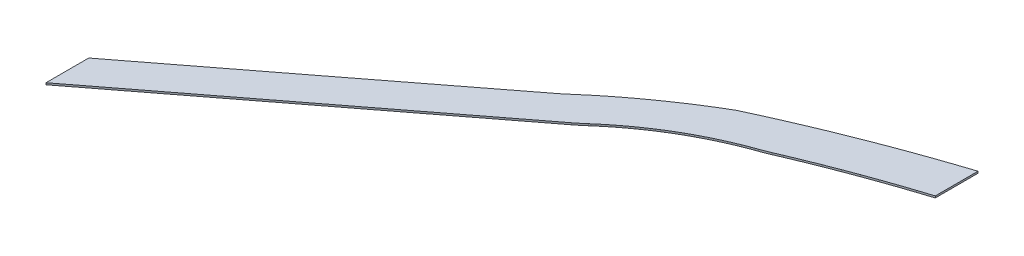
ISO-10303-21;
HEADER;
FILE_DESCRIPTION(('STEP AP214'),'2;1');
FILE_NAME('part.step','',(''),(''),'','','');
FILE_SCHEMA(('AUTOMOTIVE_DESIGN { 1 0 10303 214 1 1 1 1 }'));
ENDSEC;
DATA;
#1=APPLICATION_CONTEXT('core data for automotive mechanical design processes');
#2=APPLICATION_PROTOCOL_DEFINITION('international standard','automotive_design',2000,#1);
#3=PRODUCT_CONTEXT('',#1,'mechanical');
#4=PRODUCT('Part','Part','',(#3));
#5=PRODUCT_RELATED_PRODUCT_CATEGORY('part','',(#4));
#6=PRODUCT_DEFINITION_FORMATION('','',#4);
#7=PRODUCT_DEFINITION_CONTEXT('part definition',#1,'design');
#8=PRODUCT_DEFINITION('design','',#6,#7);
#9=PRODUCT_DEFINITION_SHAPE('','',#8);
#10=(LENGTH_UNIT() NAMED_UNIT(*) SI_UNIT(.MILLI.,.METRE.));
#11=(NAMED_UNIT(*) PLANE_ANGLE_UNIT() SI_UNIT($,.RADIAN.));
#12=(NAMED_UNIT(*) SI_UNIT($,.STERADIAN.) SOLID_ANGLE_UNIT());
#13=UNCERTAINTY_MEASURE_WITH_UNIT(LENGTH_MEASURE(1.E-05),#10,'distance_accuracy_value','');
#14=(GEOMETRIC_REPRESENTATION_CONTEXT(3) GLOBAL_UNCERTAINTY_ASSIGNED_CONTEXT((#13)) GLOBAL_UNIT_ASSIGNED_CONTEXT((#10,
#11,#12)) REPRESENTATION_CONTEXT('',''));
#15=CARTESIAN_POINT('',(0.,0.,0.));
#16=DIRECTION('',(0.,0.,1.));
#17=DIRECTION('',(1.,0.,0.));
#18=AXIS2_PLACEMENT_3D('',#15,#16,#17);
#19=CARTESIAN_POINT('',(1494.08053085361,-9.99786729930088,1568.22216180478));
#20=DIRECTION('',(0.609510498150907,-0.000962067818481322,0.792777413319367));
#21=DIRECTION('',(0.792777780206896,0.,-0.609510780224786));
#22=AXIS2_PLACEMENT_3D('',#19,#20,#21);
#23=PLANE('',#22);
#24=DIRECTION('',(0.792777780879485,1.1478881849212E-06,-0.609510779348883));
#25=VECTOR('',#24,1.);
#26=CARTESIAN_POINT('',(1494.08638566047,0.00212807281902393,1568.22979586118));
#27=LINE('',#26,#25);
#28=CARTESIAN_POINT('',(714.993894,0.000999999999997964,2167.218924));
#29=VERTEX_POINT('',#28);
#30=CARTESIAN_POINT('',(1494.08638566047,0.00212807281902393,1568.22979586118));
#31=VERTEX_POINT('',#30);
#32=EDGE_CURVE('E563',#29,#31,#27,.T.);
#33=ORIENTED_EDGE('',*,*,#32,.T.);
#34=DIRECTION('',(0.000585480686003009,0.999999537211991,0.000763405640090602));
#35=VECTOR('',#34,1.);
#36=CARTESIAN_POINT('',(1494.08053085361,-9.99786729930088,1568.22216180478));
#37=LINE('',#36,#35);
#38=CARTESIAN_POINT('',(1494.08053085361,-9.99786729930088,1568.22216180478));
#39=VERTEX_POINT('',#38);
#40=EDGE_CURVE('E544',#39,#31,#37,.T.);
#41=ORIENTED_EDGE('',*,*,#40,.F.);
#42=DIRECTION('',(0.792777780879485,1.1478881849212E-06,-0.609510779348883));
#43=VECTOR('',#42,1.);
#44=CARTESIAN_POINT('',(1494.08053085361,-9.99786729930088,1568.22216180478));
#45=LINE('',#44,#43);
#46=CARTESIAN_POINT('',(714.98803919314,-9.99899537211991,2167.2112899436));
#47=VERTEX_POINT('',#46);
#48=EDGE_CURVE('E550',#47,#39,#45,.T.);
#49=ORIENTED_EDGE('',*,*,#48,.F.);
#50=DIRECTION('',(0.000585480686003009,0.999999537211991,0.000763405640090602));
#51=VECTOR('',#50,1.);
#52=CARTESIAN_POINT('',(714.98803919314,-9.99899537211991,2167.2112899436));
#53=LINE('',#52,#51);
#54=EDGE_CURVE('E609',#47,#29,#53,.T.);
#55=ORIENTED_EDGE('',*,*,#54,.T.);
#56=EDGE_LOOP('',(#33,#41,#49,#55));
#57=FACE_BOUND('',#56,.T.);
#58=ADVANCED_FACE('F37',(#57),#23,.F.);
#59=CARTESIAN_POINT('',(1582.45836717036,-9.99220228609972,1493.02160812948));
#60=DIRECTION('',(0.648045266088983,-0.00096082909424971,0.761601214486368));
#61=DIRECTION('',(0.761601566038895,0.,-0.64804556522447));
#62=AXIS2_PLACEMENT_3D('',#59,#60,#61);
#63=PLANE('',#62);
#64=DIRECTION('',(0.761601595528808,4.88186096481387E-05,-0.648045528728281));
#65=VECTOR('',#64,1.);
#66=CARTESIAN_POINT('',(1582.46422197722,0.00779308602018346,1493.02924218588));
#67=LINE('',#66,#65);
#68=CARTESIAN_POINT('',(1582.46422197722,0.00779308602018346,1493.02924218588));
#69=VERTEX_POINT('',#68);
#70=EDGE_CURVE('E846',#31,#69,#67,.T.);
#71=ORIENTED_EDGE('',*,*,#70,.T.);
#72=DIRECTION('',(0.000585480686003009,0.999999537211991,0.000763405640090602));
#73=VECTOR('',#72,1.);
#74=CARTESIAN_POINT('',(1582.45836717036,-9.99220228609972,1493.02160812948));
#75=LINE('',#74,#73);
#76=CARTESIAN_POINT('',(1582.45836717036,-9.99220228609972,1493.02160812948));
#77=VERTEX_POINT('',#76);
#78=EDGE_CURVE('E547',#77,#69,#75,.T.);
#79=ORIENTED_EDGE('',*,*,#78,.F.);
#80=DIRECTION('',(0.761601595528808,4.88186096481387E-05,-0.648045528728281));
#81=VECTOR('',#80,1.);
#82=CARTESIAN_POINT('',(1582.45836717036,-9.99220228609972,1493.02160812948));
#83=LINE('',#82,#81);
#84=EDGE_CURVE('E540',#39,#77,#83,.T.);
#85=ORIENTED_EDGE('',*,*,#84,.F.);
#86=ORIENTED_EDGE('',*,*,#40,.T.);
#87=EDGE_LOOP('',(#71,#79,#85,#86));
#88=FACE_BOUND('',#87,.T.);
#89=ADVANCED_FACE('F542',(#88),#63,.F.);
#90=CARTESIAN_POINT('',(1612.4555978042,-9.99111969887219,1468.59765195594));
#91=DIRECTION('',(0.63138938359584,-0.000961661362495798,0.775465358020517));
#92=DIRECTION('',(0.775465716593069,0.,-0.63138967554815));
#93=AXIS2_PLACEMENT_3D('',#90,#91,#92);
#94=PLANE('',#93);
#95=DIRECTION('',(0.775465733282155,2.79862267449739E-05,-0.631389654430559));
#96=VECTOR('',#95,1.);
#97=CARTESIAN_POINT('',(1612.46145261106,0.00887567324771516,1468.60528601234));
#98=LINE('',#97,#96);
#99=CARTESIAN_POINT('',(1612.46145261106,0.00887567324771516,1468.60528601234));
#100=VERTEX_POINT('',#99);
#101=EDGE_CURVE('E840',#69,#100,#98,.T.);
#102=ORIENTED_EDGE('',*,*,#101,.T.);
#103=DIRECTION('',(0.000585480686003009,0.999999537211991,0.000763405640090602));
#104=VECTOR('',#103,1.);
#105=CARTESIAN_POINT('',(1612.4555978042,-9.99111969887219,1468.59765195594));
#106=LINE('',#105,#104);
#107=CARTESIAN_POINT('',(1612.4555978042,-9.99111969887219,1468.59765195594));
#108=VERTEX_POINT('',#107);
#109=EDGE_CURVE('E569',#108,#100,#106,.T.);
#110=ORIENTED_EDGE('',*,*,#109,.F.);
#111=DIRECTION('',(0.775465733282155,2.79862267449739E-05,-0.631389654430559));
#112=VECTOR('',#111,1.);
#113=CARTESIAN_POINT('',(1612.4555978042,-9.99111969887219,1468.59765195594));
#114=LINE('',#113,#112);
#115=EDGE_CURVE('E549',#77,#108,#114,.T.);
#116=ORIENTED_EDGE('',*,*,#115,.F.);
#117=ORIENTED_EDGE('',*,*,#78,.T.);
#118=EDGE_LOOP('',(#102,#110,#116,#117));
#119=FACE_BOUND('',#118,.T.);
#120=ADVANCED_FACE('F1006',(#119),#94,.F.);
#121=CARTESIAN_POINT('',(1642.71556520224,-9.99043983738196,1444.49973247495));
#122=DIRECTION('',(0.62295845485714,-0.00096190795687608,0.782254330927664));
#123=DIRECTION('',(0.782254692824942,0.,-0.622958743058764));
#124=AXIS2_PLACEMENT_3D('',#121,#122,#123);
#125=PLANE('',#124);
#126=DIRECTION('',(0.782254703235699,1.75751956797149E-05,-0.622958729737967));
#127=VECTOR('',#126,1.);
#128=CARTESIAN_POINT('',(1642.7214200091,0.0095555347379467,1444.50736653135));
#129=LINE('',#128,#127);
#130=CARTESIAN_POINT('',(1642.7214200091,0.0095555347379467,1444.50736653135));
#131=VERTEX_POINT('',#130);
#132=EDGE_CURVE('E835',#100,#131,#129,.T.);
#133=ORIENTED_EDGE('',*,*,#132,.T.);
#134=DIRECTION('',(0.000585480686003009,0.999999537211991,0.000763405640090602));
#135=VECTOR('',#134,1.);
#136=CARTESIAN_POINT('',(1642.71556520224,-9.99043983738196,1444.49973247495));
#137=LINE('',#136,#135);
#138=CARTESIAN_POINT('',(1642.71556520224,-9.99043983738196,1444.49973247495));
#139=VERTEX_POINT('',#138);
#140=EDGE_CURVE('E826',#139,#131,#137,.T.);
#141=ORIENTED_EDGE('',*,*,#140,.F.);
#142=DIRECTION('',(0.782254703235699,1.75751956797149E-05,-0.622958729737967));
#143=VECTOR('',#142,1.);
#144=CARTESIAN_POINT('',(1642.71556520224,-9.99043983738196,1444.49973247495));
#145=LINE('',#144,#143);
#146=EDGE_CURVE('E836',#108,#139,#145,.T.);
#147=ORIENTED_EDGE('',*,*,#146,.F.);
#148=ORIENTED_EDGE('',*,*,#109,.T.);
#149=EDGE_LOOP('',(#133,#141,#147,#148));
#150=FACE_BOUND('',#149,.T.);
#151=ADVANCED_FACE('F833',(#150),#125,.F.);
#152=CARTESIAN_POINT('',(1673.23457336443,-9.99016281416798,1420.73083168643));
#153=DIRECTION('',(0.614453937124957,-0.000962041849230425,0.788952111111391));
#154=DIRECTION('',(0.788952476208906,0.,-0.614454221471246));
#155=AXIS2_PLACEMENT_3D('',#152,#153,#154);
#156=PLANE('',#155);
#157=DIRECTION('',(0.788952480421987,7.16137794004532E-06,-0.614454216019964));
#158=VECTOR('',#157,1.);
#159=CARTESIAN_POINT('',(1673.24042817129,0.0098325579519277,1420.73846574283));
#160=LINE('',#159,#158);
#161=CARTESIAN_POINT('',(1673.24042817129,0.0098325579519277,1420.73846574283));
#162=VERTEX_POINT('',#161);
#163=EDGE_CURVE('E842',#131,#162,#160,.T.);
#164=ORIENTED_EDGE('',*,*,#163,.T.);
#165=DIRECTION('',(0.000585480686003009,0.999999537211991,0.000763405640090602));
#166=VECTOR('',#165,1.);
#167=CARTESIAN_POINT('',(1673.23457336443,-9.99016281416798,1420.73083168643));
#168=LINE('',#167,#166);
#169=CARTESIAN_POINT('',(1673.23457336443,-9.99016281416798,1420.73083168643));
#170=VERTEX_POINT('',#169);
#171=EDGE_CURVE('E823',#170,#162,#168,.T.);
#172=ORIENTED_EDGE('',*,*,#171,.F.);
#173=DIRECTION('',(0.788952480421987,7.16137794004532E-06,-0.614454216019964));
#174=VECTOR('',#173,1.);
#175=CARTESIAN_POINT('',(1673.23457336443,-9.99016281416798,1420.73083168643));
#176=LINE('',#175,#174);
#177=EDGE_CURVE('E1008',#139,#170,#176,.T.);
#178=ORIENTED_EDGE('',*,*,#177,.F.);
#179=ORIENTED_EDGE('',*,*,#140,.T.);
#180=EDGE_LOOP('',(#164,#172,#178,#179));
#181=FACE_BOUND('',#180,.T.);
#182=ADVANCED_FACE('F1481',(#181),#156,.F.);
#183=CARTESIAN_POINT('',(1704.00916729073,-9.99028869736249,1397.29368859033));
#184=DIRECTION('',(0.605876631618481,-0.000962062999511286,0.795558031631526));
#185=DIRECTION('',(0.795558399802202,0.,-0.605876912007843));
#186=AXIS2_PLACEMENT_3D('',#183,#184,#185);
#187=PLANE('',#186);
#188=DIRECTION('',(0.795558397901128,-3.25422433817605E-06,-0.605876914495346));
#189=VECTOR('',#188,1.);
#190=CARTESIAN_POINT('',(1704.01502209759,0.00970667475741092,1397.30132264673));
#191=LINE('',#190,#189);
#192=CARTESIAN_POINT('',(1704.01502209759,0.00970667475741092,1397.30132264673));
#193=VERTEX_POINT('',#192);
#194=EDGE_CURVE('E844',#162,#193,#191,.T.);
#195=ORIENTED_EDGE('',*,*,#194,.T.);
#196=DIRECTION('',(0.000585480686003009,0.999999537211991,0.000763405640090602));
#197=VECTOR('',#196,1.);
#198=CARTESIAN_POINT('',(1704.00916729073,-9.99028869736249,1397.29368859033));
#199=LINE('',#198,#197);
#200=CARTESIAN_POINT('',(1704.00916729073,-9.99028869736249,1397.29368859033));
#201=VERTEX_POINT('',#200);
#202=EDGE_CURVE('E820',#201,#193,#199,.T.);
#203=ORIENTED_EDGE('',*,*,#202,.F.);
#204=DIRECTION('',(0.795558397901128,-3.25422433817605E-06,-0.605876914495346));
#205=VECTOR('',#204,1.);
#206=CARTESIAN_POINT('',(1704.00916729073,-9.99028869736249,1397.29368859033));
#207=LINE('',#206,#205);
#208=EDGE_CURVE('E1012',#170,#201,#207,.T.);
#209=ORIENTED_EDGE('',*,*,#208,.F.);
#210=ORIENTED_EDGE('',*,*,#171,.T.);
#211=EDGE_LOOP('',(#195,#203,#209,#210));
#212=FACE_BOUND('',#211,.T.);
#213=ADVANCED_FACE('F1476',(#212),#187,.F.);
#214=CARTESIAN_POINT('',(1735.03552998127,-9.99081725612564,1374.19092818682));
#215=DIRECTION('',(0.597232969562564,-0.000961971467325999,0.80206723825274));
#216=DIRECTION('',(0.802067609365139,0.,-0.597233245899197));
#217=AXIS2_PLACEMENT_3D('',#214,#215,#216);
#218=PLANE('',#217);
#219=DIRECTION('',(0.802067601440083,-1.36638594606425E-05,-0.597233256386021));
#220=VECTOR('',#219,1.);
#221=CARTESIAN_POINT('',(1735.04138478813,0.00917811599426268,1374.19856224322));
#222=LINE('',#221,#220);
#223=CARTESIAN_POINT('',(1735.04138478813,0.00917811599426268,1374.19856224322));
#224=VERTEX_POINT('',#223);
#225=EDGE_CURVE('E851',#193,#224,#222,.T.);
#226=ORIENTED_EDGE('',*,*,#225,.T.);
#227=DIRECTION('',(0.000585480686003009,0.999999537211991,0.000763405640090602));
#228=VECTOR('',#227,1.);
#229=CARTESIAN_POINT('',(1735.03552998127,-9.99081725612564,1374.19092818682));
#230=LINE('',#229,#228);
#231=CARTESIAN_POINT('',(1735.03552998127,-9.99081725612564,1374.19092818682));
#232=VERTEX_POINT('',#231);
#233=EDGE_CURVE('E817',#232,#224,#230,.T.);
#234=ORIENTED_EDGE('',*,*,#233,.F.);
#235=DIRECTION('',(0.802067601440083,-1.36638594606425E-05,-0.597233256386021));
#236=VECTOR('',#235,1.);
#237=CARTESIAN_POINT('',(1735.03552998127,-9.99081725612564,1374.19092818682));
#238=LINE('',#237,#236);
#239=EDGE_CURVE('E1014',#201,#232,#238,.T.);
#240=ORIENTED_EDGE('',*,*,#239,.F.);
#241=ORIENTED_EDGE('',*,*,#202,.T.);
#242=EDGE_LOOP('',(#226,#234,#240,#241));
#243=FACE_BOUND('',#242,.T.);
#244=ADVANCED_FACE('F1473',(#243),#218,.F.);
#245=CARTESIAN_POINT('',(1766.3102054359,-9.99174874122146,1351.42552947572));
#246=DIRECTION('',(0.588512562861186,-0.000961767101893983,0.808487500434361));
#247=DIRECTION('',(0.808487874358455,0.,-0.588512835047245));
#248=AXIS2_PLACEMENT_3D('',#245,#246,#247);
#249=PLANE('',#248);
#250=DIRECTION('',(0.80848786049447,-2.40800066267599E-05,-0.58851285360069));
#251=VECTOR('',#250,1.);
#252=CARTESIAN_POINT('',(1766.31606024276,0.00824663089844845,1351.43316353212));
#253=LINE('',#252,#251);
#254=CARTESIAN_POINT('',(1766.31606024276,0.00824663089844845,1351.43316353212));
#255=VERTEX_POINT('',#254);
#256=EDGE_CURVE('E853',#224,#255,#253,.T.);
#257=ORIENTED_EDGE('',*,*,#256,.T.);
#258=DIRECTION('',(0.000585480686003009,0.999999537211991,0.000763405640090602));
#259=VECTOR('',#258,1.);
#260=CARTESIAN_POINT('',(1766.3102054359,-9.99174874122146,1351.42552947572));
#261=LINE('',#260,#259);
#262=CARTESIAN_POINT('',(1766.3102054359,-9.99174874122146,1351.42552947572));
#263=VERTEX_POINT('',#262);
#264=EDGE_CURVE('E814',#263,#255,#261,.T.);
#265=ORIENTED_EDGE('',*,*,#264,.F.);
#266=DIRECTION('',(0.80848786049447,-2.40800066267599E-05,-0.58851285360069));
#267=VECTOR('',#266,1.);
#268=CARTESIAN_POINT('',(1766.3102054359,-9.99174874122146,1351.42552947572));
#269=LINE('',#268,#267);
#270=EDGE_CURVE('E1016',#232,#263,#269,.T.);
#271=ORIENTED_EDGE('',*,*,#270,.F.);
#272=ORIENTED_EDGE('',*,*,#233,.T.);
#273=EDGE_LOOP('',(#257,#265,#271,#272));
#274=FACE_BOUND('',#273,.T.);
#275=ADVANCED_FACE('F1469',(#274),#249,.F.);
#276=CARTESIAN_POINT('',(1797.82949865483,-9.99308280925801,1328.99987645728));
#277=DIRECTION('',(0.57972835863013,-0.000961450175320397,0.814809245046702));
#278=DIRECTION('',(0.814809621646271,0.,-0.579728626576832));
#279=AXIS2_PLACEMENT_3D('',#276,#277,#278);
#280=PLANE('',#279);
#281=DIRECTION('',(0.814809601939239,-3.44871770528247E-05,-0.579728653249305));
#282=VECTOR('',#281,1.);
#283=CARTESIAN_POINT('',(1797.83535346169,0.00691256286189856,1329.00751051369));
#284=LINE('',#283,#282);
#285=CARTESIAN_POINT('',(1797.83535346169,0.00691256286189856,1329.00751051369));
#286=VERTEX_POINT('',#285);
#287=EDGE_CURVE('E855',#255,#286,#284,.T.);
#288=ORIENTED_EDGE('',*,*,#287,.T.);
#289=DIRECTION('',(0.000585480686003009,0.999999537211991,0.000763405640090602));
#290=VECTOR('',#289,1.);
#291=CARTESIAN_POINT('',(1797.82949865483,-9.99308280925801,1328.99987645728));
#292=LINE('',#291,#290);
#293=CARTESIAN_POINT('',(1797.82949865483,-9.99308280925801,1328.99987645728));
#294=VERTEX_POINT('',#293);
#295=EDGE_CURVE('E811',#294,#286,#292,.T.);
#296=ORIENTED_EDGE('',*,*,#295,.F.);
#297=DIRECTION('',(0.814809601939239,-3.44871770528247E-05,-0.579728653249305));
#298=VECTOR('',#297,1.);
#299=CARTESIAN_POINT('',(1797.82949865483,-9.99308280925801,1328.99987645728));
#300=LINE('',#299,#298);
#301=EDGE_CURVE('E1018',#263,#294,#300,.T.);
#302=ORIENTED_EDGE('',*,*,#301,.F.);
#303=ORIENTED_EDGE('',*,*,#264,.T.);
#304=EDGE_LOOP('',(#288,#296,#302,#303));
#305=FACE_BOUND('',#304,.T.);
#306=ADVANCED_FACE('F1464',(#305),#280,.F.);
#307=CARTESIAN_POINT('',(1829.58959463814,-9.99481932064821,1306.91671213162));
#308=DIRECTION('',(0.570875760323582,-0.000961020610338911,0.821035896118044));
#309=DIRECTION('',(0.821036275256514,0.,-0.570876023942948));
#310=AXIS2_PLACEMENT_3D('',#307,#308,#309);
#311=PLANE('',#310);
#312=DIRECTION('',(0.821036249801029,-4.489088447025E-05,-0.570876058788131));
#313=VECTOR('',#312,1.);
#314=CARTESIAN_POINT('',(1829.595449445,0.00517605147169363,1306.92434618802));
#315=LINE('',#314,#313);
#316=CARTESIAN_POINT('',(1829.595449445,0.00517605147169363,1306.92434618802));
#317=VERTEX_POINT('',#316);
#318=EDGE_CURVE('E857',#286,#317,#315,.T.);
#319=ORIENTED_EDGE('',*,*,#318,.T.);
#320=DIRECTION('',(0.000585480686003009,0.999999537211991,0.000763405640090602));
#321=VECTOR('',#320,1.);
#322=CARTESIAN_POINT('',(1829.58959463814,-9.99481932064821,1306.91671213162));
#323=LINE('',#322,#321);
#324=CARTESIAN_POINT('',(1829.58959463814,-9.99481932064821,1306.91671213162));
#325=VERTEX_POINT('',#324);
#326=EDGE_CURVE('E808',#325,#317,#323,.T.);
#327=ORIENTED_EDGE('',*,*,#326,.F.);
#328=DIRECTION('',(0.821036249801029,-4.489088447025E-05,-0.570876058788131));
#329=VECTOR('',#328,1.);
#330=CARTESIAN_POINT('',(1829.58959463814,-9.99481932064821,1306.91671213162));
#331=LINE('',#330,#329);
#332=EDGE_CURVE('E1020',#294,#325,#331,.T.);
#333=ORIENTED_EDGE('',*,*,#332,.F.);
#334=ORIENTED_EDGE('',*,*,#295,.T.);
#335=EDGE_LOOP('',(#319,#327,#333,#334));
#336=FACE_BOUND('',#335,.T.);
#337=ADVANCED_FACE('F1458',(#336),#311,.F.);
#338=CARTESIAN_POINT('',(1861.58691638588,-9.99695818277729,1285.1786584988));
#339=DIRECTION('',(0.561953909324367,-0.000960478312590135,0.827167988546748));
#340=DIRECTION('',(0.827168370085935,0.,-0.56195416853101));
#341=AXIS2_PLACEMENT_3D('',#338,#339,#340);
#342=PLANE('',#341);
#343=DIRECTION('',(0.827168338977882,-5.52920975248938E-05,-0.561954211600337));
#344=VECTOR('',#343,1.);
#345=CARTESIAN_POINT('',(1861.59277119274,0.00303718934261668,1285.1862925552));
#346=LINE('',#345,#344);
#347=CARTESIAN_POINT('',(1861.59277119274,0.00303718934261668,1285.1862925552));
#348=VERTEX_POINT('',#347);
#349=EDGE_CURVE('E859',#317,#348,#346,.T.);
#350=ORIENTED_EDGE('',*,*,#349,.T.);
#351=DIRECTION('',(0.000585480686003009,0.999999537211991,0.000763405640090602));
#352=VECTOR('',#351,1.);
#353=CARTESIAN_POINT('',(1861.58691638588,-9.99695818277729,1285.1786584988));
#354=LINE('',#353,#352);
#355=CARTESIAN_POINT('',(1861.58691638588,-9.99695818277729,1285.1786584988));
#356=VERTEX_POINT('',#355);
#357=EDGE_CURVE('E805',#356,#348,#354,.T.);
#358=ORIENTED_EDGE('',*,*,#357,.F.);
#359=DIRECTION('',(0.827168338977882,-5.52920975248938E-05,-0.561954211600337));
#360=VECTOR('',#359,1.);
#361=CARTESIAN_POINT('',(1861.58691638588,-9.99695818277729,1285.1786584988));
#362=LINE('',#361,#360);
#363=EDGE_CURVE('E1022',#325,#356,#362,.T.);
#364=ORIENTED_EDGE('',*,*,#363,.F.);
#365=ORIENTED_EDGE('',*,*,#326,.T.);
#366=EDGE_LOOP('',(#350,#358,#364,#365));
#367=FACE_BOUND('',#366,.T.);
#368=ADVANCED_FACE('F1454',(#367),#342,.F.);
#369=CARTESIAN_POINT('',(1893.81764889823,-9.99949907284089,1263.78821855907));
#370=DIRECTION('',(0.552967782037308,-0.00095982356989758,0.833202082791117));
#371=DIRECTION('',(0.833202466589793,0.,-0.552968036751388));
#372=AXIS2_PLACEMENT_3D('',#369,#370,#371);
#373=PLANE('',#372);
#374=DIRECTION('',(0.83320242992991,-6.5685003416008E-05,-0.552968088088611));
#375=VECTOR('',#374,1.);
#376=CARTESIAN_POINT('',(1893.82350370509,0.000496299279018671,1263.79585261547));
#377=LINE('',#376,#375);
#378=CARTESIAN_POINT('',(1893.82350370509,0.000496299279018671,1263.79585261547));
#379=VERTEX_POINT('',#378);
#380=EDGE_CURVE('E861',#348,#379,#377,.T.);
#381=ORIENTED_EDGE('',*,*,#380,.T.);
#382=DIRECTION('',(0.000585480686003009,0.999999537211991,0.000763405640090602));
#383=VECTOR('',#382,1.);
#384=CARTESIAN_POINT('',(1893.81764889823,-9.99949907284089,1263.78821855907));
#385=LINE('',#384,#383);
#386=CARTESIAN_POINT('',(1893.81764889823,-9.99949907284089,1263.78821855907));
#387=VERTEX_POINT('',#386);
#388=EDGE_CURVE('E802',#387,#379,#385,.T.);
#389=ORIENTED_EDGE('',*,*,#388,.F.);
#390=DIRECTION('',(0.83320242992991,-6.5685003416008E-05,-0.552968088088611));
#391=VECTOR('',#390,1.);
#392=CARTESIAN_POINT('',(1893.81764889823,-9.99949907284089,1263.78821855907));
#393=LINE('',#392,#391);
#394=EDGE_CURVE('E1024',#356,#387,#393,.T.);
#395=ORIENTED_EDGE('',*,*,#394,.F.);
#396=ORIENTED_EDGE('',*,*,#357,.T.);
#397=EDGE_LOOP('',(#381,#389,#395,#396));
#398=FACE_BOUND('',#397,.T.);
#399=ADVANCED_FACE('F1449',(#398),#373,.F.);
#400=CARTESIAN_POINT('',(1926.2780991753,-10.0024418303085,1242.74801431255));
#401=DIRECTION('',(0.543913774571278,-0.000959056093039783,0.839140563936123));
#402=DIRECTION('',(0.839140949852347,0.,-0.543914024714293));
#403=AXIS2_PLACEMENT_3D('',#400,#401,#402);
#404=PLANE('',#403);
#405=DIRECTION('',(0.839140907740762,-7.60737497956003E-05,-0.543914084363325));
#406=VECTOR('',#405,1.);
#407=CARTESIAN_POINT('',(1926.28395398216,-0.0024464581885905,1242.75564836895));
#408=LINE('',#407,#406);
#409=CARTESIAN_POINT('',(1926.28395398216,-0.0024464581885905,1242.75564836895));
#410=VERTEX_POINT('',#409);
#411=EDGE_CURVE('E863',#379,#410,#408,.T.);
#412=ORIENTED_EDGE('',*,*,#411,.T.);
#413=DIRECTION('',(0.000585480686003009,0.999999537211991,0.000763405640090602));
#414=VECTOR('',#413,1.);
#415=CARTESIAN_POINT('',(1926.2780991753,-10.0024418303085,1242.74801431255));
#416=LINE('',#415,#414);
#417=CARTESIAN_POINT('',(1926.2780991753,-10.0024418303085,1242.74801431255));
#418=VERTEX_POINT('',#417);
#419=EDGE_CURVE('E799',#418,#410,#416,.T.);
#420=ORIENTED_EDGE('',*,*,#419,.F.);
#421=DIRECTION('',(0.839140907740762,-7.60737497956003E-05,-0.543914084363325));
#422=VECTOR('',#421,1.);
#423=CARTESIAN_POINT('',(1926.2780991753,-10.0024418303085,1242.74801431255));
#424=LINE('',#423,#422);
#425=EDGE_CURVE('E1026',#387,#418,#424,.T.);
#426=ORIENTED_EDGE('',*,*,#425,.F.);
#427=ORIENTED_EDGE('',*,*,#388,.T.);
#428=EDGE_LOOP('',(#412,#420,#426,#427));
#429=FACE_BOUND('',#428,.T.);
#430=ADVANCED_FACE('F1443',(#429),#404,.F.);
#431=CARTESIAN_POINT('',(1958.96433021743,-10.0057858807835,1222.06031275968));
#432=DIRECTION('',(0.534801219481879,-0.000958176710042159,0.844977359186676));
#433=DIRECTION('',(0.844977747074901,0.,-0.534801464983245));
#434=AXIS2_PLACEMENT_3D('',#431,#432,#433);
#435=PLANE('',#434);
#436=DIRECTION('',(0.84497769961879,-8.64476566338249E-05,-0.534801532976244));
#437=VECTOR('',#436,1.);
#438=CARTESIAN_POINT('',(1958.97018502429,-0.0057905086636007,1222.06794681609));
#439=LINE('',#438,#437);
#440=CARTESIAN_POINT('',(1958.97018502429,-0.0057905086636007,1222.06794681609));
#441=VERTEX_POINT('',#440);
#442=EDGE_CURVE('E865',#410,#441,#439,.T.);
#443=ORIENTED_EDGE('',*,*,#442,.T.);
#444=DIRECTION('',(0.000585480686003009,0.999999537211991,0.000763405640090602));
#445=VECTOR('',#444,1.);
#446=CARTESIAN_POINT('',(1958.96433021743,-10.0057858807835,1222.06031275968));
#447=LINE('',#446,#445);
#448=CARTESIAN_POINT('',(1958.96433021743,-10.0057858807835,1222.06031275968));
#449=VERTEX_POINT('',#448);
#450=EDGE_CURVE('E796',#449,#441,#447,.T.);
#451=ORIENTED_EDGE('',*,*,#450,.F.);
#452=DIRECTION('',(0.84497769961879,-8.64476566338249E-05,-0.534801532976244));
#453=VECTOR('',#452,1.);
#454=CARTESIAN_POINT('',(1958.96433021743,-10.0057858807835,1222.06031275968));
#455=LINE('',#454,#453);
#456=EDGE_CURVE('E1028',#418,#449,#455,.T.);
#457=ORIENTED_EDGE('',*,*,#456,.F.);
#458=ORIENTED_EDGE('',*,*,#419,.T.);
#459=EDGE_LOOP('',(#443,#451,#457,#458));
#460=FACE_BOUND('',#459,.T.);
#461=ADVANCED_FACE('F1439',(#460),#435,.F.);
#462=CARTESIAN_POINT('',(1991.87264902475,-10.0095309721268,1201.72761590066));
#463=DIRECTION('',(0.525622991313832,-0.000957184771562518,0.850717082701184));
#464=DIRECTION('',(0.85071747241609,0.,-0.525623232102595));
#465=AXIS2_PLACEMENT_3D('',#462,#463,#464);
#466=PLANE('',#465);
#467=DIRECTION('',(0.850717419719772,-9.68148650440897E-05,-0.52562330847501));
#468=VECTOR('',#467,1.);
#469=CARTESIAN_POINT('',(1991.87850383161,-0.00953560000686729,1201.73524995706));
#470=LINE('',#469,#468);
#471=CARTESIAN_POINT('',(1991.87850383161,-0.00953560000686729,1201.73524995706));
#472=VERTEX_POINT('',#471);
#473=EDGE_CURVE('E867',#441,#472,#470,.T.);
#474=ORIENTED_EDGE('',*,*,#473,.T.);
#475=DIRECTION('',(0.000585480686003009,0.999999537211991,0.000763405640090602));
#476=VECTOR('',#475,1.);
#477=CARTESIAN_POINT('',(1991.87264902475,-10.0095309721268,1201.72761590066));
#478=LINE('',#477,#476);
#479=CARTESIAN_POINT('',(1991.87264902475,-10.0095309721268,1201.72761590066));
#480=VERTEX_POINT('',#479);
#481=EDGE_CURVE('E793',#480,#472,#478,.T.);
#482=ORIENTED_EDGE('',*,*,#481,.F.);
#483=DIRECTION('',(0.850717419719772,-9.68148650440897E-05,-0.52562330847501));
#484=VECTOR('',#483,1.);
#485=CARTESIAN_POINT('',(1991.87264902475,-10.0095309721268,1201.72761590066));
#486=LINE('',#485,#484);
#487=EDGE_CURVE('E1030',#449,#480,#486,.T.);
#488=ORIENTED_EDGE('',*,*,#487,.F.);
#489=ORIENTED_EDGE('',*,*,#450,.T.);
#490=EDGE_LOOP('',(#474,#482,#488,#489));
#491=FACE_BOUND('',#490,.T.);
#492=ADVANCED_FACE('F1434',(#491),#466,.F.);
#493=CARTESIAN_POINT('',(2024.99900059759,-10.0136765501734,1181.7523077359));
#494=DIRECTION('',(0.516385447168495,-0.000956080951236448,0.856355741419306));
#495=DIRECTION('',(0.85635613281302,0.,-0.516385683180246));
#496=AXIS2_PLACEMENT_3D('',#493,#494,#495);
#497=PLANE('',#496);
#498=DIRECTION('',(0.856356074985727,-0.000107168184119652,-0.516385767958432));
#499=VECTOR('',#498,1.);
#500=CARTESIAN_POINT('',(2025.00485540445,-0.0136811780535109,1181.7599417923));
#501=LINE('',#500,#499);
#502=CARTESIAN_POINT('',(2025.00485540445,-0.0136811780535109,1181.7599417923));
#503=VERTEX_POINT('',#502);
#504=EDGE_CURVE('E869',#472,#503,#501,.T.);
#505=ORIENTED_EDGE('',*,*,#504,.T.);
#506=DIRECTION('',(0.000585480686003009,0.999999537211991,0.000763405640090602));
#507=VECTOR('',#506,1.);
#508=CARTESIAN_POINT('',(2024.99900059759,-10.0136765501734,1181.7523077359));
#509=LINE('',#508,#507);
#510=CARTESIAN_POINT('',(2024.99900059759,-10.0136765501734,1181.7523077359));
#511=VERTEX_POINT('',#510);
#512=EDGE_CURVE('E790',#511,#503,#509,.T.);
#513=ORIENTED_EDGE('',*,*,#512,.F.);
#514=DIRECTION('',(0.856356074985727,-0.000107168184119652,-0.516385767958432));
#515=VECTOR('',#514,1.);
#516=CARTESIAN_POINT('',(2024.99900059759,-10.0136765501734,1181.7523077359));
#517=LINE('',#516,#515);
#518=EDGE_CURVE('E1032',#480,#511,#517,.T.);
#519=ORIENTED_EDGE('',*,*,#518,.F.);
#520=ORIENTED_EDGE('',*,*,#481,.T.);
#521=EDGE_LOOP('',(#505,#513,#519,#520));
#522=FACE_BOUND('',#521,.T.);
#523=ADVANCED_FACE('F1428',(#522),#497,.F.);
#524=CARTESIAN_POINT('',(2058.3396899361,-10.0182223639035,1162.1368932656));
#525=DIRECTION('',(0.507082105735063,-0.00095486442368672,0.861897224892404));
#526=DIRECTION('',(0.861897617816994,0.,-0.507082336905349));
#527=AXIS2_PLACEMENT_3D('',#524,#525,#526);
#528=PLANE('',#527);
#529=DIRECTION('',(0.861897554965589,-0.000117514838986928,-0.507082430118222));
#530=VECTOR('',#529,1.);
#531=CARTESIAN_POINT('',(2058.34554474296,-0.0182269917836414,1162.144527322));
#532=LINE('',#531,#530);
#533=CARTESIAN_POINT('',(2058.34554474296,-0.0182269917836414,1162.144527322));
#534=VERTEX_POINT('',#533);
#535=EDGE_CURVE('E871',#503,#534,#532,.T.);
#536=ORIENTED_EDGE('',*,*,#535,.T.);
#537=DIRECTION('',(0.000585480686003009,0.999999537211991,0.000763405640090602));
#538=VECTOR('',#537,1.);
#539=CARTESIAN_POINT('',(2058.3396899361,-10.0182223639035,1162.1368932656));
#540=LINE('',#539,#538);
#541=CARTESIAN_POINT('',(2058.3396899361,-10.0182223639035,1162.1368932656));
#542=VERTEX_POINT('',#541);
#543=EDGE_CURVE('E787',#542,#534,#540,.T.);
#544=ORIENTED_EDGE('',*,*,#543,.F.);
#545=DIRECTION('',(0.861897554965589,-0.000117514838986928,-0.507082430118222));
#546=VECTOR('',#545,1.);
#547=CARTESIAN_POINT('',(2058.3396899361,-10.0182223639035,1162.1368932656));
#548=LINE('',#547,#546);
#549=EDGE_CURVE('E1034',#511,#542,#548,.T.);
#550=ORIENTED_EDGE('',*,*,#549,.F.);
#551=ORIENTED_EDGE('',*,*,#512,.T.);
#552=EDGE_LOOP('',(#536,#544,#550,#551));
#553=FACE_BOUND('',#552,.T.);
#554=ADVANCED_FACE('F1424',(#553),#528,.F.);
#555=CARTESIAN_POINT('',(2143.95245213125,-10.0383850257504,1122.8891268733));
#556=DIRECTION('',(0.416729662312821,-0.00093794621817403,0.909029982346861));
#557=DIRECTION('',(0.909030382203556,0.,-0.416729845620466));
#558=AXIS2_PLACEMENT_3D('',#555,#556,#557);
#559=PLANE('',#558);
#560=DIRECTION('',(0.909030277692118,-0.000214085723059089,-0.416730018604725));
#561=VECTOR('',#560,1.);
#562=CARTESIAN_POINT('',(2143.95830693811,-0.0383896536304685,1122.8967609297));
#563=LINE('',#562,#561);
#564=CARTESIAN_POINT('',(2143.95830693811,-0.0383896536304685,1122.8967609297));
#565=VERTEX_POINT('',#564);
#566=EDGE_CURVE('E873',#534,#565,#563,.T.);
#567=ORIENTED_EDGE('',*,*,#566,.T.);
#568=DIRECTION('',(0.000585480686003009,0.999999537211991,0.000763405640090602));
#569=VECTOR('',#568,1.);
#570=CARTESIAN_POINT('',(2143.95245213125,-10.0383850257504,1122.8891268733));
#571=LINE('',#570,#569);
#572=CARTESIAN_POINT('',(2143.95245213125,-10.0383850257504,1122.8891268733));
#573=VERTEX_POINT('',#572);
#574=EDGE_CURVE('E784',#573,#565,#571,.T.);
#575=ORIENTED_EDGE('',*,*,#574,.F.);
#576=DIRECTION('',(0.909030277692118,-0.000214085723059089,-0.416730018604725));
#577=VECTOR('',#576,1.);
#578=CARTESIAN_POINT('',(2143.95245213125,-10.0383850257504,1122.8891268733));
#579=LINE('',#578,#577);
#580=EDGE_CURVE('E1036',#542,#573,#579,.T.);
#581=ORIENTED_EDGE('',*,*,#580,.F.);
#582=ORIENTED_EDGE('',*,*,#543,.T.);
#583=EDGE_LOOP('',(#567,#575,#581,#582));
#584=FACE_BOUND('',#583,.T.);
#585=ADVANCED_FACE('F1419',(#584),#559,.F.);
#586=CARTESIAN_POINT('',(2229.99508275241,-10.0595280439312,1084.59586773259));
#587=DIRECTION('',(0.406599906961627,-0.000935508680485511,0.913605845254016));
#588=DIRECTION('',(0.913606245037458,0.,-0.406600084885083));
#589=AXIS2_PLACEMENT_3D('',#586,#587,#588);
#590=PLANE('',#589);
#591=DIRECTION('',(0.913606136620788,-0.000224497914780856,-0.406600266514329));
#592=VECTOR('',#591,1.);
#593=CARTESIAN_POINT('',(2230.00093755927,-0.0595326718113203,1084.603501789));
#594=LINE('',#593,#592);
#595=CARTESIAN_POINT('',(2230.00093755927,-0.0595326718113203,1084.603501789));
#596=VERTEX_POINT('',#595);
#597=EDGE_CURVE('E875',#565,#596,#594,.T.);
#598=ORIENTED_EDGE('',*,*,#597,.T.);
#599=DIRECTION('',(0.000585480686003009,0.999999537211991,0.000763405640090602));
#600=VECTOR('',#599,1.);
#601=CARTESIAN_POINT('',(2229.99508275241,-10.0595280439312,1084.59586773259));
#602=LINE('',#601,#600);
#603=CARTESIAN_POINT('',(2229.99508275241,-10.0595280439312,1084.59586773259));
#604=VERTEX_POINT('',#603);
#605=EDGE_CURVE('E781',#604,#596,#602,.T.);
#606=ORIENTED_EDGE('',*,*,#605,.F.);
#607=DIRECTION('',(0.913606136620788,-0.000224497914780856,-0.406600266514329));
#608=VECTOR('',#607,1.);
#609=CARTESIAN_POINT('',(2229.99508275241,-10.0595280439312,1084.59586773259));
#610=LINE('',#609,#608);
#611=EDGE_CURVE('E1038',#573,#604,#610,.T.);
#612=ORIENTED_EDGE('',*,*,#611,.F.);
#613=ORIENTED_EDGE('',*,*,#574,.T.);
#614=EDGE_LOOP('',(#598,#606,#612,#613));
#615=FACE_BOUND('',#614,.T.);
#616=ADVANCED_FACE('F1413',(#615),#590,.F.);
#617=CARTESIAN_POINT('',(2316.45804380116,-10.0816487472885,1047.26093184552));
#618=DIRECTION('',(0.396423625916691,-0.000932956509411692,0.91806722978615));
#619=DIRECTION('',(0.918067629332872,0.,-0.396423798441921));
#620=AXIS2_PLACEMENT_3D('',#617,#618,#619);
#621=PLANE('',#620);
#622=DIRECTION('',(0.918067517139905,-0.000234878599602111,-0.396423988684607));
#623=VECTOR('',#622,1.);
#624=CARTESIAN_POINT('',(2316.46389860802,-0.0816533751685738,1047.26856590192));
#625=LINE('',#624,#623);
#626=CARTESIAN_POINT('',(2316.46389860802,-0.0816533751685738,1047.26856590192));
#627=VERTEX_POINT('',#626);
#628=EDGE_CURVE('E877',#596,#627,#625,.T.);
#629=ORIENTED_EDGE('',*,*,#628,.T.);
#630=DIRECTION('',(0.000585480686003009,0.999999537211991,0.000763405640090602));
#631=VECTOR('',#630,1.);
#632=CARTESIAN_POINT('',(2316.45804380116,-10.0816487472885,1047.26093184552));
#633=LINE('',#632,#631);
#634=CARTESIAN_POINT('',(2316.45804380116,-10.0816487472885,1047.26093184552));
#635=VERTEX_POINT('',#634);
#636=EDGE_CURVE('E778',#635,#627,#633,.T.);
#637=ORIENTED_EDGE('',*,*,#636,.F.);
#638=DIRECTION('',(0.918067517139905,-0.000234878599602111,-0.396423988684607));
#639=VECTOR('',#638,1.);
#640=CARTESIAN_POINT('',(2316.45804380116,-10.0816487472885,1047.26093184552));
#641=LINE('',#640,#639);
#642=EDGE_CURVE('E1040',#604,#635,#641,.T.);
#643=ORIENTED_EDGE('',*,*,#642,.F.);
#644=ORIENTED_EDGE('',*,*,#605,.T.);
#645=EDGE_LOOP('',(#629,#637,#643,#644));
#646=FACE_BOUND('',#645,.T.);
#647=ADVANCED_FACE('F1409',(#646),#621,.F.);
#648=CARTESIAN_POINT('',(2403.33060827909,-10.1047444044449,1010.88896821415));
#649=DIRECTION('',(0.386198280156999,-0.000930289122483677,0.922415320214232));
#650=DIRECTION('',(0.922415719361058,0.,-0.386198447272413));
#651=AXIS2_PLACEMENT_3D('',#648,#649,#650);
#652=PLANE('',#651);
#653=DIRECTION('',(0.922415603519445,-0.000245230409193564,-0.38619864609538));
#654=VECTOR('',#653,1.);
#655=CARTESIAN_POINT('',(2403.33646308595,-0.104749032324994,1010.89660227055));
#656=LINE('',#655,#654);
#657=CARTESIAN_POINT('',(2403.33646308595,-0.104749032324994,1010.89660227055));
#658=VERTEX_POINT('',#657);
#659=EDGE_CURVE('E879',#627,#658,#656,.T.);
#660=ORIENTED_EDGE('',*,*,#659,.T.);
#661=DIRECTION('',(0.000585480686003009,0.999999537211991,0.000763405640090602));
#662=VECTOR('',#661,1.);
#663=CARTESIAN_POINT('',(2403.33060827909,-10.1047444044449,1010.88896821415));
#664=LINE('',#663,#662);
#665=CARTESIAN_POINT('',(2403.33060827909,-10.1047444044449,1010.88896821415));
#666=VERTEX_POINT('',#665);
#667=EDGE_CURVE('E775',#666,#658,#664,.T.);
#668=ORIENTED_EDGE('',*,*,#667,.F.);
#669=DIRECTION('',(0.922415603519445,-0.000245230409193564,-0.38619864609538));
#670=VECTOR('',#669,1.);
#671=CARTESIAN_POINT('',(2403.33060827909,-10.1047444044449,1010.88896821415));
#672=LINE('',#671,#670);
#673=EDGE_CURVE('E1042',#635,#666,#672,.T.);
#674=ORIENTED_EDGE('',*,*,#673,.F.);
#675=ORIENTED_EDGE('',*,*,#636,.T.);
#676=EDGE_LOOP('',(#660,#668,#674,#675));
#677=FACE_BOUND('',#676,.T.);
#678=ADVANCED_FACE('F1404',(#677),#652,.F.);
#679=CARTESIAN_POINT('',(2490.60180718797,-10.128812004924,975.484445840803));
#680=DIRECTION('',(0.375926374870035,-0.000927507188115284,0.926649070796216));
#681=DIRECTION('',(0.926649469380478,0.,-0.375926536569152));
#682=AXIS2_PLACEMENT_3D('',#679,#680,#681);
#683=PLANE('',#682);
#684=DIRECTION('',(0.926649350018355,-0.000255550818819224,-0.375926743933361));
#685=VECTOR('',#684,1.);
#686=CARTESIAN_POINT('',(2490.60766199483,-0.128816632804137,975.492079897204));
#687=LINE('',#686,#685);
#688=CARTESIAN_POINT('',(2490.60766199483,-0.128816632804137,975.492079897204));
#689=VERTEX_POINT('',#688);
#690=EDGE_CURVE('E881',#658,#689,#687,.T.);
#691=ORIENTED_EDGE('',*,*,#690,.T.);
#692=DIRECTION('',(0.000585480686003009,0.999999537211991,0.000763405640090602));
#693=VECTOR('',#692,1.);
#694=CARTESIAN_POINT('',(2490.60180718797,-10.128812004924,975.484445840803));
#695=LINE('',#694,#693);
#696=CARTESIAN_POINT('',(2490.60180718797,-10.128812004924,975.484445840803));
#697=VERTEX_POINT('',#696);
#698=EDGE_CURVE('E772',#697,#689,#695,.T.);
#699=ORIENTED_EDGE('',*,*,#698,.F.);
#700=DIRECTION('',(0.926649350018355,-0.000255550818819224,-0.375926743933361));
#701=VECTOR('',#700,1.);
#702=CARTESIAN_POINT('',(2490.60180718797,-10.128812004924,975.484445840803));
#703=LINE('',#702,#701);
#704=EDGE_CURVE('E1044',#666,#697,#703,.T.);
#705=ORIENTED_EDGE('',*,*,#704,.F.);
#706=ORIENTED_EDGE('',*,*,#667,.T.);
#707=EDGE_LOOP('',(#691,#699,#705,#706));
#708=FACE_BOUND('',#707,.T.);
#709=ADVANCED_FACE('F1398',(#708),#683,.F.);
#710=CARTESIAN_POINT('',(2578.26091352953,-10.1538485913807,941.051717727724));
#711=DIRECTION('',(0.365608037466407,-0.000924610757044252,0.930768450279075));
#712=DIRECTION('',(0.930768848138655,0.,-0.365608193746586));
#713=AXIS2_PLACEMENT_3D('',#710,#711,#712);
#714=PLANE('',#713);
#715=DIRECTION('',(0.930768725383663,-0.000265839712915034,-0.365608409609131));
#716=VECTOR('',#715,1.);
#717=CARTESIAN_POINT('',(2578.26676833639,-0.153853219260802,941.059351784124));
#718=LINE('',#717,#716);
#719=CARTESIAN_POINT('',(2578.26676833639,-0.153853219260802,941.059351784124));
#720=VERTEX_POINT('',#719);
#721=EDGE_CURVE('E883',#689,#720,#718,.T.);
#722=ORIENTED_EDGE('',*,*,#721,.T.);
#723=DIRECTION('',(0.000585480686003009,0.999999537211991,0.000763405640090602));
#724=VECTOR('',#723,1.);
#725=CARTESIAN_POINT('',(2578.26091352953,-10.1538485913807,941.051717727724));
#726=LINE('',#725,#724);
#727=CARTESIAN_POINT('',(2578.26091352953,-10.1538485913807,941.051717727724));
#728=VERTEX_POINT('',#727);
#729=EDGE_CURVE('E769',#728,#720,#726,.T.);
#730=ORIENTED_EDGE('',*,*,#729,.F.);
#731=DIRECTION('',(0.930768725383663,-0.000265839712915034,-0.365608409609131));
#732=VECTOR('',#731,1.);
#733=CARTESIAN_POINT('',(2578.26091352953,-10.1538485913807,941.051717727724));
#734=LINE('',#733,#732);
#735=EDGE_CURVE('E1046',#697,#728,#734,.T.);
#736=ORIENTED_EDGE('',*,*,#735,.F.);
#737=ORIENTED_EDGE('',*,*,#698,.T.);
#738=EDGE_LOOP('',(#722,#730,#736,#737));
#739=FACE_BOUND('',#738,.T.);
#740=ADVANCED_FACE('F1394',(#739),#714,.F.);
#741=CARTESIAN_POINT('',(2666.2971973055,-10.179851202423,907.595133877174));
#742=DIRECTION('',(0.355243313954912,-0.000921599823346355,0.934773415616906));
#743=DIRECTION('',(0.934773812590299,0.,-0.355243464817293));
#744=AXIS2_PLACEMENT_3D('',#741,#742,#743);
#745=PLANE('',#744);
#746=DIRECTION('',(0.934773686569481,-0.000276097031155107,-0.355243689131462));
#747=VECTOR('',#746,1.);
#748=CARTESIAN_POINT('',(2666.30305211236,-0.179855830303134,907.602767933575));
#749=LINE('',#748,#747);
#750=CARTESIAN_POINT('',(2666.30305211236,-0.179855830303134,907.602767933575));
#751=VERTEX_POINT('',#750);
#752=EDGE_CURVE('E885',#720,#751,#749,.T.);
#753=ORIENTED_EDGE('',*,*,#752,.T.);
#754=DIRECTION('',(0.000585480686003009,0.999999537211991,0.000763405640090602));
#755=VECTOR('',#754,1.);
#756=CARTESIAN_POINT('',(2666.2971973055,-10.179851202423,907.595133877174));
#757=LINE('',#756,#755);
#758=CARTESIAN_POINT('',(2666.2971973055,-10.179851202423,907.595133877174));
#759=VERTEX_POINT('',#758);
#760=EDGE_CURVE('E766',#759,#751,#757,.T.);
#761=ORIENTED_EDGE('',*,*,#760,.F.);
#762=DIRECTION('',(0.934773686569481,-0.000276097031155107,-0.355243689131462));
#763=VECTOR('',#762,1.);
#764=CARTESIAN_POINT('',(2666.2971973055,-10.179851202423,907.595133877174));
#765=LINE('',#764,#763);
#766=EDGE_CURVE('E1048',#728,#759,#765,.T.);
#767=ORIENTED_EDGE('',*,*,#766,.F.);
#768=ORIENTED_EDGE('',*,*,#729,.T.);
#769=EDGE_LOOP('',(#753,#761,#767,#768));
#770=FACE_BOUND('',#769,.T.);
#771=ADVANCED_FACE('F1389',(#770),#745,.F.);
#772=CARTESIAN_POINT('',(2754.69969051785,-10.2068164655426,875.118688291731));
#773=DIRECTION('',(0.344836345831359,-0.000918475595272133,0.938662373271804));
#774=DIRECTION('',(0.938662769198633,0.,-0.344836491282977));
#775=AXIS2_PLACEMENT_3D('',#772,#773,#774);
#776=PLANE('',#775);
#777=DIRECTION('',(0.938662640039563,-0.000286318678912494,-0.344836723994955));
#778=VECTOR('',#777,1.);
#779=CARTESIAN_POINT('',(2754.70554532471,-0.206821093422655,875.126322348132));
#780=LINE('',#779,#778);
#781=CARTESIAN_POINT('',(2754.70554532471,-0.206821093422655,875.126322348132));
#782=VERTEX_POINT('',#781);
#783=EDGE_CURVE('E887',#751,#782,#780,.T.);
#784=ORIENTED_EDGE('',*,*,#783,.T.);
#785=DIRECTION('',(0.000585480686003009,0.999999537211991,0.000763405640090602));
#786=VECTOR('',#785,1.);
#787=CARTESIAN_POINT('',(2754.69969051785,-10.2068164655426,875.118688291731));
#788=LINE('',#787,#786);
#789=CARTESIAN_POINT('',(2754.69969051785,-10.2068164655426,875.118688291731));
#790=VERTEX_POINT('',#789);
#791=EDGE_CURVE('E763',#790,#782,#788,.T.);
#792=ORIENTED_EDGE('',*,*,#791,.F.);
#793=DIRECTION('',(0.938662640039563,-0.000286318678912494,-0.344836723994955));
#794=VECTOR('',#793,1.);
#795=CARTESIAN_POINT('',(2754.69969051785,-10.2068164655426,875.118688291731));
#796=LINE('',#795,#794);
#797=EDGE_CURVE('E1050',#759,#790,#796,.T.);
#798=ORIENTED_EDGE('',*,*,#797,.F.);
#799=ORIENTED_EDGE('',*,*,#760,.T.);
#800=EDGE_LOOP('',(#784,#792,#798,#799));
#801=FACE_BOUND('',#800,.T.);
#802=ADVANCED_FACE('F1383',(#801),#776,.F.);
#803=CARTESIAN_POINT('',(2843.45766616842,-10.2347412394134,843.626492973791));
#804=DIRECTION('',(0.334385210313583,-0.000915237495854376,0.942436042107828));
#805=DIRECTION('',(0.94243643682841,0.,-0.334385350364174));
#806=AXIS2_PLACEMENT_3D('',#803,#804,#805);
#807=PLANE('',#806);
#808=DIRECTION('',(0.942436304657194,-0.000296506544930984,-0.334385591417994));
#809=VECTOR('',#808,1.);
#810=CARTESIAN_POINT('',(2843.46352097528,-0.234745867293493,843.634127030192));
#811=LINE('',#810,#809);
#812=CARTESIAN_POINT('',(2843.46352097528,-0.234745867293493,843.634127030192));
#813=VERTEX_POINT('',#812);
#814=EDGE_CURVE('E889',#782,#813,#811,.T.);
#815=ORIENTED_EDGE('',*,*,#814,.T.);
#816=DIRECTION('',(0.000585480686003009,0.999999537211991,0.000763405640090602));
#817=VECTOR('',#816,1.);
#818=CARTESIAN_POINT('',(2843.45766616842,-10.2347412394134,843.626492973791));
#819=LINE('',#818,#817);
#820=CARTESIAN_POINT('',(2843.45766616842,-10.2347412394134,843.626492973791));
#821=VERTEX_POINT('',#820);
#822=EDGE_CURVE('E760',#821,#813,#819,.T.);
#823=ORIENTED_EDGE('',*,*,#822,.F.);
#824=DIRECTION('',(0.942436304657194,-0.000296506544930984,-0.334385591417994));
#825=VECTOR('',#824,1.);
#826=CARTESIAN_POINT('',(2843.45766616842,-10.2347412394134,843.626492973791));
#827=LINE('',#826,#825);
#828=EDGE_CURVE('E1052',#790,#821,#827,.T.);
#829=ORIENTED_EDGE('',*,*,#828,.F.);
#830=ORIENTED_EDGE('',*,*,#791,.T.);
#831=EDGE_LOOP('',(#815,#823,#829,#830));
#832=FACE_BOUND('',#831,.T.);
#833=ADVANCED_FACE('F1379',(#832),#807,.F.);
#834=CARTESIAN_POINT('',(2932.56015625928,-10.2636220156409,813.122363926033));
#835=DIRECTION('',(0.323893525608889,-0.000911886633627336,0.946093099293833));
#836=DIRECTION('',(0.946093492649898,0.,-0.323893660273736));
#837=AXIS2_PLACEMENT_3D('',#834,#835,#836);
#838=PLANE('',#837);
#839=DIRECTION('',(0.94609335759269,-0.000306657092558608,-0.323893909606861));
#840=VECTOR('',#839,1.);
#841=CARTESIAN_POINT('',(2932.56601106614,-0.263626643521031,813.129997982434));
#842=LINE('',#841,#840);
#843=CARTESIAN_POINT('',(2932.56601106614,-0.263626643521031,813.129997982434));
#844=VERTEX_POINT('',#843);
#845=EDGE_CURVE('E891',#813,#844,#842,.T.);
#846=ORIENTED_EDGE('',*,*,#845,.T.);
#847=DIRECTION('',(0.000585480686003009,0.999999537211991,0.000763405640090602));
#848=VECTOR('',#847,1.);
#849=CARTESIAN_POINT('',(2932.56015625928,-10.2636220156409,813.122363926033));
#850=LINE('',#849,#848);
#851=CARTESIAN_POINT('',(2932.56015625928,-10.2636220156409,813.122363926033));
#852=VERTEX_POINT('',#851);
#853=EDGE_CURVE('E757',#852,#844,#850,.T.);
#854=ORIENTED_EDGE('',*,*,#853,.F.);
#855=DIRECTION('',(0.94609335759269,-0.000306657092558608,-0.323893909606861));
#856=VECTOR('',#855,1.);
#857=CARTESIAN_POINT('',(2932.56015625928,-10.2636220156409,813.122363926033));
#858=LINE('',#857,#856);
#859=EDGE_CURVE('E1054',#821,#852,#858,.T.);
#860=ORIENTED_EDGE('',*,*,#859,.F.);
#861=ORIENTED_EDGE('',*,*,#822,.T.);
#862=EDGE_LOOP('',(#846,#854,#860,#861));
#863=FACE_BOUND('',#862,.T.);
#864=ADVANCED_FACE('F1374',(#863),#838,.F.);
#865=CARTESIAN_POINT('',(3021.99595479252,-10.2934551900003,783.610174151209));
#866=DIRECTION('',(0.313361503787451,-0.000908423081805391,0.949633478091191));
#867=DIRECTION('',(0.949633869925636,0.,-0.313361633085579));
#868=AXIS2_PLACEMENT_3D('',#865,#866,#867);
#869=PLANE('',#868);
#870=DIRECTION('',(0.949633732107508,-0.000316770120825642,-0.313361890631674));
#871=VECTOR('',#870,1.);
#872=CARTESIAN_POINT('',(3022.00180959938,-0.293459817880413,783.61780820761));
#873=LINE('',#872,#871);
#874=CARTESIAN_POINT('',(3022.00180959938,-0.293459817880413,783.61780820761));
#875=VERTEX_POINT('',#874);
#876=EDGE_CURVE('E893',#844,#875,#873,.T.);
#877=ORIENTED_EDGE('',*,*,#876,.T.);
#878=DIRECTION('',(0.000585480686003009,0.999999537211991,0.000763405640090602));
#879=VECTOR('',#878,1.);
#880=CARTESIAN_POINT('',(3021.99595479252,-10.2934551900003,783.610174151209));
#881=LINE('',#880,#879);
#882=CARTESIAN_POINT('',(3021.99595479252,-10.2934551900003,783.610174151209));
#883=VERTEX_POINT('',#882);
#884=EDGE_CURVE('E754',#883,#875,#881,.T.);
#885=ORIENTED_EDGE('',*,*,#884,.F.);
#886=DIRECTION('',(0.949633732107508,-0.000316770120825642,-0.313361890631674));
#887=VECTOR('',#886,1.);
#888=CARTESIAN_POINT('',(3021.99595479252,-10.2934551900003,783.610174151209));
#889=LINE('',#888,#887);
#890=EDGE_CURVE('E1056',#852,#883,#889,.T.);
#891=ORIENTED_EDGE('',*,*,#890,.F.);
#892=ORIENTED_EDGE('',*,*,#853,.T.);
#893=EDGE_LOOP('',(#877,#885,#891,#892));
#894=FACE_BOUND('',#893,.T.);
#895=ADVANCED_FACE('F1368',(#894),#869,.F.);
#896=CARTESIAN_POINT('',(3021.99441781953,-10.4744567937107,1020.7087889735));
#897=DIRECTION('',(-0.999999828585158,0.000585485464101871,-6.03545880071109E-06));
#898=DIRECTION('',(-0.000585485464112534,-0.999999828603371,0.));
#899=AXIS2_PLACEMENT_3D('',#896,#897,#898);
#900=PLANE('',#899);
#901=DIRECTION('',(-6.48241891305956E-06,-0.000763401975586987,0.999999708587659));
#902=VECTOR('',#901,1.);
#903=CARTESIAN_POINT('',(3022.00027262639,-0.474461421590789,1020.7164230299));
#904=LINE('',#903,#902);
#905=CARTESIAN_POINT('',(3022.00027262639,-0.474461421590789,1020.7164230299));
#906=VERTEX_POINT('',#905);
#907=EDGE_CURVE('E895',#875,#906,#904,.T.);
#908=ORIENTED_EDGE('',*,*,#907,.T.);
#909=DIRECTION('',(0.000585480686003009,0.999999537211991,0.000763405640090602));
#910=VECTOR('',#909,1.);
#911=CARTESIAN_POINT('',(3021.99441781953,-10.4744567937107,1020.7087889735));
#912=LINE('',#911,#910);
#913=CARTESIAN_POINT('',(3021.99441781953,-10.4744567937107,1020.7087889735));
#914=VERTEX_POINT('',#913);
#915=EDGE_CURVE('E751',#914,#906,#912,.T.);
#916=ORIENTED_EDGE('',*,*,#915,.F.);
#917=DIRECTION('',(-6.48241891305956E-06,-0.000763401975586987,0.999999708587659));
#918=VECTOR('',#917,1.);
#919=CARTESIAN_POINT('',(3021.99441781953,-10.4744567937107,1020.7087889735));
#920=LINE('',#919,#918);
#921=EDGE_CURVE('E1058',#883,#914,#920,.T.);
#922=ORIENTED_EDGE('',*,*,#921,.F.);
#923=ORIENTED_EDGE('',*,*,#884,.T.);
#924=EDGE_LOOP('',(#908,#916,#922,#923));
#925=FACE_BOUND('',#924,.T.);
#926=ADVANCED_FACE('F1364',(#925),#900,.F.);
#927=CARTESIAN_POINT('',(2943.92856135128,-10.4479286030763,1045.83026022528));
#928=DIRECTION('',(-0.306327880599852,0.000906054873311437,-0.951925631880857));
#929=DIRECTION('',(-0.951926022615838,0.,0.306328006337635));
#930=AXIS2_PLACEMENT_3D('',#927,#928,#929);
#931=PLANE('',#930);
#932=DIRECTION('',(-0.951925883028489,0.000323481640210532,0.306328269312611));
#933=VECTOR('',#932,1.);
#934=CARTESIAN_POINT('',(2943.93441615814,-0.447933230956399,1045.83789428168));
#935=LINE('',#934,#933);
#936=CARTESIAN_POINT('',(2943.93441615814,-0.447933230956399,1045.83789428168));
#937=VERTEX_POINT('',#936);
#938=EDGE_CURVE('E897',#906,#937,#935,.T.);
#939=ORIENTED_EDGE('',*,*,#938,.T.);
#940=DIRECTION('',(0.000585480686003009,0.999999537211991,0.000763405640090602));
#941=VECTOR('',#940,1.);
#942=CARTESIAN_POINT('',(2943.92856135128,-10.4479286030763,1045.83026022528));
#943=LINE('',#942,#941);
#944=CARTESIAN_POINT('',(2943.92856135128,-10.4479286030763,1045.83026022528));
#945=VERTEX_POINT('',#944);
#946=EDGE_CURVE('E748',#945,#937,#943,.T.);
#947=ORIENTED_EDGE('',*,*,#946,.F.);
#948=DIRECTION('',(-0.951925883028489,0.000323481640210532,0.306328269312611));
#949=VECTOR('',#948,1.);
#950=CARTESIAN_POINT('',(2943.92856135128,-10.4479286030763,1045.83026022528));
#951=LINE('',#950,#949);
#952=EDGE_CURVE('E1060',#914,#945,#951,.T.);
#953=ORIENTED_EDGE('',*,*,#952,.F.);
#954=ORIENTED_EDGE('',*,*,#915,.T.);
#955=EDGE_LOOP('',(#939,#947,#953,#954));
#956=FACE_BOUND('',#955,.T.);
#957=ADVANCED_FACE('F1359',(#956),#931,.F.);
#958=CARTESIAN_POINT('',(2866.15715138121,-10.4222575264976,1071.84866082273));
#959=DIRECTION('',(-0.317265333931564,0.000909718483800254,-0.948336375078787));
#960=DIRECTION('',(-0.9483367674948,0.,0.317265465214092));
#961=AXIS2_PLACEMENT_3D('',#958,#959,#960);
#962=PLANE('',#961);
#963=DIRECTION('',(-0.948336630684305,0.000313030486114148,0.317265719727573));
#964=VECTOR('',#963,1.);
#965=CARTESIAN_POINT('',(2866.16300618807,-0.422262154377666,1071.85629487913));
#966=LINE('',#965,#964);
#967=CARTESIAN_POINT('',(2866.16300618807,-0.422262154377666,1071.85629487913));
#968=VERTEX_POINT('',#967);
#969=EDGE_CURVE('E899',#937,#968,#966,.T.);
#970=ORIENTED_EDGE('',*,*,#969,.T.);
#971=DIRECTION('',(0.000585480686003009,0.999999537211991,0.000763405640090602));
#972=VECTOR('',#971,1.);
#973=CARTESIAN_POINT('',(2866.15715138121,-10.4222575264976,1071.84866082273));
#974=LINE('',#973,#972);
#975=CARTESIAN_POINT('',(2866.15715138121,-10.4222575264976,1071.84866082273));
#976=VERTEX_POINT('',#975);
#977=EDGE_CURVE('E745',#976,#968,#974,.T.);
#978=ORIENTED_EDGE('',*,*,#977,.F.);
#979=DIRECTION('',(-0.948336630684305,0.000313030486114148,0.317265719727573));
#980=VECTOR('',#979,1.);
#981=CARTESIAN_POINT('',(2866.15715138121,-10.4222575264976,1071.84866082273));
#982=LINE('',#981,#980);
#983=EDGE_CURVE('E1062',#945,#976,#982,.T.);
#984=ORIENTED_EDGE('',*,*,#983,.F.);
#985=ORIENTED_EDGE('',*,*,#946,.T.);
#986=EDGE_LOOP('',(#970,#978,#984,#985));
#987=FACE_BOUND('',#986,.T.);
#988=ADVANCED_FACE('F1353',(#987),#962,.F.);
#989=CARTESIAN_POINT('',(2788.69020090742,-10.3974467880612,1098.7605347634));
#990=DIRECTION('',(-0.328159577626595,0.000913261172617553,-0.944621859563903));
#991=DIRECTION('',(-0.944622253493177,0.,0.328159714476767));
#992=AXIS2_PLACEMENT_3D('',#989,#990,#991);
#993=PLANE('',#992);
#994=DIRECTION('',(-0.944622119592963,0.000302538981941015,0.328159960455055));
#995=VECTOR('',#994,1.);
#996=CARTESIAN_POINT('',(2788.69605571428,-0.397451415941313,1098.7681688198));
#997=LINE('',#996,#995);
#998=CARTESIAN_POINT('',(2788.69605571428,-0.397451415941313,1098.7681688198));
#999=VERTEX_POINT('',#998);
#1000=EDGE_CURVE('E901',#968,#999,#997,.T.);
#1001=ORIENTED_EDGE('',*,*,#1000,.T.);
#1002=DIRECTION('',(0.000585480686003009,0.999999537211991,0.000763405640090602));
#1003=VECTOR('',#1002,1.);
#1004=CARTESIAN_POINT('',(2788.69020090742,-10.3974467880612,1098.7605347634));
#1005=LINE('',#1004,#1003);
#1006=CARTESIAN_POINT('',(2788.69020090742,-10.3974467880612,1098.7605347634));
#1007=VERTEX_POINT('',#1006);
#1008=EDGE_CURVE('E742',#1007,#999,#1005,.T.);
#1009=ORIENTED_EDGE('',*,*,#1008,.F.);
#1010=DIRECTION('',(-0.944622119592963,0.000302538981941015,0.328159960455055));
#1011=VECTOR('',#1010,1.);
#1012=CARTESIAN_POINT('',(2788.69020090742,-10.3974467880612,1098.7605347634));
#1013=LINE('',#1012,#1011);
#1014=EDGE_CURVE('E1064',#976,#1007,#1013,.T.);
#1015=ORIENTED_EDGE('',*,*,#1014,.F.);
#1016=ORIENTED_EDGE('',*,*,#977,.T.);
#1017=EDGE_LOOP('',(#1001,#1009,#1015,#1016));
#1018=FACE_BOUND('',#1017,.T.);
#1019=ADVANCED_FACE('F1349',(#1018),#993,.F.);
#1020=CARTESIAN_POINT('',(2711.53820092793,-10.3734997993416,1126.56230504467));
#1021=DIRECTION('',(-0.339011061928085,0.000916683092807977,-0.940781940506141));
#1022=DIRECTION('',(-0.940782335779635,0.,0.339011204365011));
#1023=AXIS2_PLACEMENT_3D('',#1020,#1021,#1022);
#1024=PLANE('',#1023);
#1025=DIRECTION('',(-0.940782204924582,0.000292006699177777,0.339011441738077));
#1026=VECTOR('',#1025,1.);
#1027=CARTESIAN_POINT('',(2711.54405573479,-0.373504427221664,1126.56993910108));
#1028=LINE('',#1027,#1026);
#1029=CARTESIAN_POINT('',(2711.54405573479,-0.373504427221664,1126.56993910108));
#1030=VERTEX_POINT('',#1029);
#1031=EDGE_CURVE('E903',#999,#1030,#1028,.T.);
#1032=ORIENTED_EDGE('',*,*,#1031,.T.);
#1033=DIRECTION('',(0.000585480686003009,0.999999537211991,0.000763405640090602));
#1034=VECTOR('',#1033,1.);
#1035=CARTESIAN_POINT('',(2711.53820092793,-10.3734997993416,1126.56230504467));
#1036=LINE('',#1035,#1034);
#1037=CARTESIAN_POINT('',(2711.53820092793,-10.3734997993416,1126.56230504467));
#1038=VERTEX_POINT('',#1037);
#1039=EDGE_CURVE('E739',#1038,#1030,#1036,.T.);
#1040=ORIENTED_EDGE('',*,*,#1039,.F.);
#1041=DIRECTION('',(-0.940782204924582,0.000292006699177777,0.339011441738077));
#1042=VECTOR('',#1041,1.);
#1043=CARTESIAN_POINT('',(2711.53820092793,-10.3734997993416,1126.56230504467));
#1044=LINE('',#1043,#1042);
#1045=EDGE_CURVE('E1066',#1007,#1038,#1044,.T.);
#1046=ORIENTED_EDGE('',*,*,#1045,.F.);
#1047=ORIENTED_EDGE('',*,*,#1008,.T.);
#1048=EDGE_LOOP('',(#1032,#1040,#1046,#1047));
#1049=FACE_BOUND('',#1048,.T.);
#1050=ADVANCED_FACE('F1344',(#1049),#1024,.F.);
#1051=CARTESIAN_POINT('',(2634.71140344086,-10.3504197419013,1155.25027666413));
#1052=DIRECTION('',(-0.349817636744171,0.000919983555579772,-0.93681736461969));
#1053=DIRECTION('',(-0.936817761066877,0.,0.349817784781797));
#1054=AXIS2_PLACEMENT_3D('',#1051,#1052,#1053);
#1055=PLANE('',#1054);
#1056=DIRECTION('',(-0.936817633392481,0.000281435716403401,0.349818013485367));
#1057=VECTOR('',#1056,1.);
#1058=CARTESIAN_POINT('',(2634.71725824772,-0.350424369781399,1155.25791072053));
#1059=LINE('',#1058,#1057);
#1060=CARTESIAN_POINT('',(2634.71725824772,-0.350424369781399,1155.25791072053));
#1061=VERTEX_POINT('',#1060);
#1062=EDGE_CURVE('E905',#1030,#1061,#1059,.T.);
#1063=ORIENTED_EDGE('',*,*,#1062,.T.);
#1064=DIRECTION('',(0.000585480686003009,0.999999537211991,0.000763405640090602));
#1065=VECTOR('',#1064,1.);
#1066=CARTESIAN_POINT('',(2634.71140344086,-10.3504197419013,1155.25027666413));
#1067=LINE('',#1066,#1065);
#1068=CARTESIAN_POINT('',(2634.71140344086,-10.3504197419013,1155.25027666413));
#1069=VERTEX_POINT('',#1068);
#1070=EDGE_CURVE('E736',#1069,#1061,#1067,.T.);
#1071=ORIENTED_EDGE('',*,*,#1070,.F.);
#1072=DIRECTION('',(-0.936817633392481,0.000281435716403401,0.349818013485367));
#1073=VECTOR('',#1072,1.);
#1074=CARTESIAN_POINT('',(2634.71140344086,-10.3504197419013,1155.25027666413));
#1075=LINE('',#1074,#1073);
#1076=EDGE_CURVE('E1068',#1038,#1069,#1075,.T.);
#1077=ORIENTED_EDGE('',*,*,#1076,.F.);
#1078=ORIENTED_EDGE('',*,*,#1039,.T.);
#1079=EDGE_LOOP('',(#1063,#1071,#1077,#1078));
#1080=FACE_BOUND('',#1079,.T.);
#1081=ADVANCED_FACE('F1338',(#1080),#1055,.F.);
#1082=CARTESIAN_POINT('',(2558.2198224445,-10.3282095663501,1184.82063461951));
#1083=DIRECTION('',(-0.360577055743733,0.000923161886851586,-0.932728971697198));
#1084=DIRECTION('',(-0.932729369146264,0.,0.360577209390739));
#1085=AXIS2_PLACEMENT_3D('',#1082,#1083,#1084);
#1086=PLANE('',#1085);
#1087=DIRECTION('',(-0.932729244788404,0.000270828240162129,0.36057742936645));
#1088=VECTOR('',#1087,1.);
#1089=CARTESIAN_POINT('',(2558.22567725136,-0.328214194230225,1184.82826867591));
#1090=LINE('',#1089,#1088);
#1091=CARTESIAN_POINT('',(2558.22567725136,-0.328214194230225,1184.82826867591));
#1092=VERTEX_POINT('',#1091);
#1093=EDGE_CURVE('E907',#1061,#1092,#1090,.T.);
#1094=ORIENTED_EDGE('',*,*,#1093,.T.);
#1095=DIRECTION('',(0.000585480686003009,0.999999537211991,0.000763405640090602));
#1096=VECTOR('',#1095,1.);
#1097=CARTESIAN_POINT('',(2558.2198224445,-10.3282095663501,1184.82063461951));
#1098=LINE('',#1097,#1096);
#1099=CARTESIAN_POINT('',(2558.2198224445,-10.3282095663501,1184.82063461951));
#1100=VERTEX_POINT('',#1099);
#1101=EDGE_CURVE('E733',#1100,#1092,#1098,.T.);
#1102=ORIENTED_EDGE('',*,*,#1101,.F.);
#1103=DIRECTION('',(-0.932729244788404,0.000270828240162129,0.36057742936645));
#1104=VECTOR('',#1103,1.);
#1105=CARTESIAN_POINT('',(2558.2198224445,-10.3282095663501,1184.82063461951));
#1106=LINE('',#1105,#1104);
#1107=EDGE_CURVE('E1070',#1069,#1100,#1106,.T.);
#1108=ORIENTED_EDGE('',*,*,#1107,.F.);
#1109=ORIENTED_EDGE('',*,*,#1070,.T.);
#1110=EDGE_LOOP('',(#1094,#1102,#1108,#1109));
#1111=FACE_BOUND('',#1110,.T.);
#1112=ADVANCED_FACE('F1334',(#1111),#1086,.F.);
#1113=CARTESIAN_POINT('',(2482.07370893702,-10.3068723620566,1215.26956390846));
#1114=DIRECTION('',(-0.37129025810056,0.000926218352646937,-0.928516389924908));
#1115=DIRECTION('',(-0.928516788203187,0.,0.371290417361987));
#1116=AXIS2_PLACEMENT_3D('',#1113,#1114,#1115);
#1117=PLANE('',#1116);
#1118=DIRECTION('',(-0.92851666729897,0.000260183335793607,0.371290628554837));
#1119=VECTOR('',#1118,1.);
#1120=CARTESIAN_POINT('',(2482.07956374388,-0.306876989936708,1215.27719796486));
#1121=LINE('',#1120,#1119);
#1122=CARTESIAN_POINT('',(2482.07956374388,-0.306876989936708,1215.27719796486));
#1123=VERTEX_POINT('',#1122);
#1124=EDGE_CURVE('E909',#1092,#1123,#1121,.T.);
#1125=ORIENTED_EDGE('',*,*,#1124,.T.);
#1126=DIRECTION('',(0.000585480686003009,0.999999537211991,0.000763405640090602));
#1127=VECTOR('',#1126,1.);
#1128=CARTESIAN_POINT('',(2482.07370893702,-10.3068723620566,1215.26956390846));
#1129=LINE('',#1128,#1127);
#1130=CARTESIAN_POINT('',(2482.07370893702,-10.3068723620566,1215.26956390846));
#1131=VERTEX_POINT('',#1130);
#1132=EDGE_CURVE('E730',#1131,#1123,#1129,.T.);
#1133=ORIENTED_EDGE('',*,*,#1132,.F.);
#1134=DIRECTION('',(-0.92851666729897,0.000260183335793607,0.371290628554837));
#1135=VECTOR('',#1134,1.);
#1136=CARTESIAN_POINT('',(2482.07370893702,-10.3068723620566,1215.26956390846));
#1137=LINE('',#1136,#1135);
#1138=EDGE_CURVE('E1072',#1100,#1131,#1137,.T.);
#1139=ORIENTED_EDGE('',*,*,#1138,.F.);
#1140=ORIENTED_EDGE('',*,*,#1101,.T.);
#1141=EDGE_LOOP('',(#1125,#1133,#1139,#1140));
#1142=FACE_BOUND('',#1141,.T.);
#1143=ADVANCED_FACE('F1330',(#1142),#1117,.F.);
#1144=CARTESIAN_POINT('',(2406.28307791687,-10.2864108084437,1246.59289352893));
#1145=DIRECTION('',(-0.38195251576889,0.000929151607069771,-0.924181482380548));
#1146=DIRECTION('',(-0.924181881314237,0.,0.381952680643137));
#1147=AXIS2_PLACEMENT_3D('',#1144,#1145,#1146);
#1148=PLANE('',#1147);
#1149=DIRECTION('',(-0.924181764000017,0.000249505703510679,0.381952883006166));
#1150=VECTOR('',#1149,1.);
#1151=CARTESIAN_POINT('',(2406.28893272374,-0.286415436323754,1246.60052758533));
#1152=LINE('',#1151,#1150);
#1153=CARTESIAN_POINT('',(2406.28893272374,-0.286415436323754,1246.60052758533));
#1154=VERTEX_POINT('',#1153);
#1155=EDGE_CURVE('E911',#1123,#1154,#1152,.T.);
#1156=ORIENTED_EDGE('',*,*,#1155,.T.);
#1157=DIRECTION('',(0.000585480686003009,0.999999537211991,0.000763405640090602));
#1158=VECTOR('',#1157,1.);
#1159=CARTESIAN_POINT('',(2406.28307791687,-10.2864108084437,1246.59289352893));
#1160=LINE('',#1159,#1158);
#1161=CARTESIAN_POINT('',(2406.28307791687,-10.2864108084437,1246.59289352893));
#1162=VERTEX_POINT('',#1161);
#1163=EDGE_CURVE('E727',#1162,#1154,#1160,.T.);
#1164=ORIENTED_EDGE('',*,*,#1163,.F.);
#1165=DIRECTION('',(-0.924181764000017,0.000249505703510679,0.381952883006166));
#1166=VECTOR('',#1165,1.);
#1167=CARTESIAN_POINT('',(2406.28307791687,-10.2864108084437,1246.59289352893));
#1168=LINE('',#1167,#1166);
#1169=EDGE_CURVE('E1074',#1131,#1162,#1168,.T.);
#1170=ORIENTED_EDGE('',*,*,#1169,.F.);
#1171=ORIENTED_EDGE('',*,*,#1132,.T.);
#1172=EDGE_LOOP('',(#1156,#1164,#1170,#1171));
#1173=FACE_BOUND('',#1172,.T.);
#1174=ADVANCED_FACE('F1325',(#1173),#1148,.F.);
#1175=CARTESIAN_POINT('',(2330.85794138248,-10.2668275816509,1278.78645047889));
#1176=DIRECTION('',(-0.392563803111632,0.000931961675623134,-0.919724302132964));
#1177=DIRECTION('',(-0.919724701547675,0.,0.392563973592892));
#1178=AXIS2_PLACEMENT_3D('',#1175,#1176,#1177);
#1179=PLANE('',#1178);
#1180=DIRECTION('',(-0.919724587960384,0.000238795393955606,0.392564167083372));
#1181=VECTOR('',#1180,1.);
#1182=CARTESIAN_POINT('',(2330.86379618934,-0.266832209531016,1278.79408453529));
#1183=LINE('',#1182,#1181);
#1184=CARTESIAN_POINT('',(2361.20697858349,-0.274710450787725,1265.84276597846));
#1185=VERTEX_POINT('',#1184);
#1186=EDGE_CURVE('E913',#1154,#1185,#1183,.T.);
#1187=ORIENTED_EDGE('',*,*,#1186,.T.);
#1188=DIRECTION('',(0.000585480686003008,0.999999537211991,0.000763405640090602));
#1189=VECTOR('',#1188,1.);
#1190=CARTESIAN_POINT('',(2361.20112377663,-10.2747058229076,1265.83513192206));
#1191=LINE('',#1190,#1189);
#1192=CARTESIAN_POINT('',(2361.20112377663,-10.2747058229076,1265.83513192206));
#1193=VERTEX_POINT('',#1192);
#1194=EDGE_CURVE('E576',#1185,#1193,#1191,.F.);
#1195=ORIENTED_EDGE('',*,*,#1194,.T.);
#1196=DIRECTION('',(-0.919724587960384,0.000238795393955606,0.392564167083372));
#1197=VECTOR('',#1196,1.);
#1198=CARTESIAN_POINT('',(2330.85794138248,-10.2668275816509,1278.78645047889));
#1199=LINE('',#1198,#1197);
#1200=EDGE_CURVE('E1076',#1162,#1193,#1199,.T.);
#1201=ORIENTED_EDGE('',*,*,#1200,.F.);
#1202=ORIENTED_EDGE('',*,*,#1163,.T.);
#1203=EDGE_LOOP('',(#1187,#1195,#1201,#1202));
#1204=FACE_BOUND('',#1203,.T.);
#1205=ADVANCED_FACE('F1316',(#1204),#1179,.F.);
#1206=CARTESIAN_POINT('',(2293.68086226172,-10.2550778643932,1291.90758744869));
#1207=DIRECTION('',(-0.337867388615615,0.000916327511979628,-0.941193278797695));
#1208=DIRECTION('',(-0.941193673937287,0.,0.337867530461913));
#1209=AXIS2_PLACEMENT_3D('',#1206,#1207,#1208);
#1210=PLANE('',#1209);
#1211=DIRECTION('',(-0.941193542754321,0.000293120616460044,0.337867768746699));
#1212=VECTOR('',#1211,1.);
#1213=CARTESIAN_POINT('',(2293.68086226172,-10.2550778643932,1291.90758744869));
#1214=LINE('',#1213,#1212);
#1215=CARTESIAN_POINT('',(2306.50470928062,-10.2590716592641,1287.30410858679));
#1216=VERTEX_POINT('',#1215);
#1217=CARTESIAN_POINT('',(2293.68086226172,-10.2550778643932,1291.90758744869));
#1218=VERTEX_POINT('',#1217);
#1219=EDGE_CURVE('E1078',#1216,#1218,#1214,.T.);
#1220=ORIENTED_EDGE('',*,*,#1219,.F.);
#1221=DIRECTION('',(0.000585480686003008,0.99999953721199,0.000763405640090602));
#1222=VECTOR('',#1221,1.);
#1223=CARTESIAN_POINT('',(2306.50470928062,-10.2590716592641,1287.30410858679));
#1224=LINE('',#1223,#1222);
#1225=CARTESIAN_POINT('',(2306.51056408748,-0.259076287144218,1287.31174264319));
#1226=VERTEX_POINT('',#1225);
#1227=EDGE_CURVE('E564',#1216,#1226,#1224,.T.);
#1228=ORIENTED_EDGE('',*,*,#1227,.T.);
#1229=DIRECTION('',(-0.941193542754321,0.000293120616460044,0.337867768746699));
#1230=VECTOR('',#1229,1.);
#1231=CARTESIAN_POINT('',(2293.68671706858,-0.255082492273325,1291.91522150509));
#1232=LINE('',#1231,#1230);
#1233=CARTESIAN_POINT('',(2293.68671706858,-0.255082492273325,1291.91522150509));
#1234=VERTEX_POINT('',#1233);
#1235=EDGE_CURVE('E916',#1226,#1234,#1232,.T.);
#1236=ORIENTED_EDGE('',*,*,#1235,.T.);
#1237=DIRECTION('',(0.000585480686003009,0.999999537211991,0.000763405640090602));
#1238=VECTOR('',#1237,1.);
#1239=CARTESIAN_POINT('',(2293.68086226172,-10.2550778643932,1291.90758744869));
#1240=LINE('',#1239,#1238);
#1241=EDGE_CURVE('E724',#1218,#1234,#1240,.T.);
#1242=ORIENTED_EDGE('',*,*,#1241,.F.);
#1243=EDGE_LOOP('',(#1220,#1228,#1236,#1242));
#1244=FACE_BOUND('',#1243,.T.);
#1245=ADVANCED_FACE('F1309',(#1244),#1210,.F.);
#1246=CARTESIAN_POINT('',(2275.19937253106,-10.2494938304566,1298.76701271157));
#1247=DIRECTION('',(-0.347957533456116,0.000919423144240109,-0.937509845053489));
#1248=DIRECTION('',(-0.93751024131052,0.,0.347957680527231));
#1249=AXIS2_PLACEMENT_3D('',#1246,#1247,#1248);
#1250=PLANE('',#1249);
#1251=DIRECTION('',(-0.937510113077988,0.00028326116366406,0.347957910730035));
#1252=VECTOR('',#1251,1.);
#1253=CARTESIAN_POINT('',(2275.20522733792,-0.249498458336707,1298.77464676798));
#1254=LINE('',#1253,#1252);
#1255=CARTESIAN_POINT('',(2275.20522733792,-0.249498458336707,1298.77464676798));
#1256=VERTEX_POINT('',#1255);
#1257=EDGE_CURVE('E918',#1234,#1256,#1254,.T.);
#1258=ORIENTED_EDGE('',*,*,#1257,.T.);
#1259=DIRECTION('',(0.000585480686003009,0.999999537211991,0.000763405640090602));
#1260=VECTOR('',#1259,1.);
#1261=CARTESIAN_POINT('',(2275.19937253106,-10.2494938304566,1298.76701271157));
#1262=LINE('',#1261,#1260);
#1263=CARTESIAN_POINT('',(2275.19937253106,-10.2494938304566,1298.76701271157));
#1264=VERTEX_POINT('',#1263);
#1265=EDGE_CURVE('E721',#1264,#1256,#1262,.T.);
#1266=ORIENTED_EDGE('',*,*,#1265,.F.);
#1267=DIRECTION('',(-0.937510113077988,0.00028326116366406,0.347957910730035));
#1268=VECTOR('',#1267,1.);
#1269=CARTESIAN_POINT('',(2275.19937253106,-10.2494938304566,1298.76701271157));
#1270=LINE('',#1269,#1268);
#1271=EDGE_CURVE('E1080',#1218,#1264,#1270,.T.);
#1272=ORIENTED_EDGE('',*,*,#1271,.F.);
#1273=ORIENTED_EDGE('',*,*,#1241,.T.);
#1274=EDGE_LOOP('',(#1258,#1266,#1272,#1273));
#1275=FACE_BOUND('',#1274,.T.);
#1276=ADVANCED_FACE('F1305',(#1275),#1250,.F.);
#1277=CARTESIAN_POINT('',(2256.79298468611,-10.2441050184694,1305.82456482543));
#1278=DIRECTION('',(-0.358013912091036,0.000922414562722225,-0.933715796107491));
#1279=DIRECTION('',(-0.933716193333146,0.,0.358014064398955));
#1280=AXIS2_PLACEMENT_3D('',#1277,#1278,#1279);
#1281=PLANE('',#1280);
#1282=DIRECTION('',(-0.933716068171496,0.000273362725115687,0.358014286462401));
#1283=VECTOR('',#1282,1.);
#1284=CARTESIAN_POINT('',(2256.79883949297,-0.244109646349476,1305.83219888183));
#1285=LINE('',#1284,#1283);
#1286=CARTESIAN_POINT('',(2256.79883949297,-0.244109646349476,1305.83219888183));
#1287=VERTEX_POINT('',#1286);
#1288=EDGE_CURVE('E920',#1256,#1287,#1285,.T.);
#1289=ORIENTED_EDGE('',*,*,#1288,.T.);
#1290=DIRECTION('',(0.000585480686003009,0.999999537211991,0.000763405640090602));
#1291=VECTOR('',#1290,1.);
#1292=CARTESIAN_POINT('',(2256.79298468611,-10.2441050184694,1305.82456482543));
#1293=LINE('',#1292,#1291);
#1294=CARTESIAN_POINT('',(2256.79298468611,-10.2441050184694,1305.82456482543));
#1295=VERTEX_POINT('',#1294);
#1296=EDGE_CURVE('E718',#1295,#1287,#1293,.T.);
#1297=ORIENTED_EDGE('',*,*,#1296,.F.);
#1298=DIRECTION('',(-0.933716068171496,0.000273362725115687,0.358014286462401));
#1299=VECTOR('',#1298,1.);
#1300=CARTESIAN_POINT('',(2256.79298468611,-10.2441050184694,1305.82456482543));
#1301=LINE('',#1300,#1299);
#1302=EDGE_CURVE('E1082',#1264,#1295,#1301,.T.);
#1303=ORIENTED_EDGE('',*,*,#1302,.F.);
#1304=ORIENTED_EDGE('',*,*,#1265,.T.);
#1305=EDGE_LOOP('',(#1289,#1297,#1303,#1304));
#1306=FACE_BOUND('',#1305,.T.);
#1307=ADVANCED_FACE('F1300',(#1306),#1281,.F.);
#1308=CARTESIAN_POINT('',(2238.46312872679,-10.2389115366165,1313.07928879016));
#1309=DIRECTION('',(-0.368011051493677,0.000925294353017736,-0.92982095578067));
#1310=DIRECTION('',(-0.929821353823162,0.,0.368011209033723));
#1311=AXIS2_PLACEMENT_3D('',#1308,#1309,#1310);
#1312=PLANE('',#1311);
#1313=DIRECTION('',(-0.929821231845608,0.000263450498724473,0.368011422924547));
#1314=VECTOR('',#1313,1.);
#1315=CARTESIAN_POINT('',(2238.46898353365,-0.238916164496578,1313.08692284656));
#1316=LINE('',#1315,#1314);
#1317=CARTESIAN_POINT('',(2238.46898353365,-0.238916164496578,1313.08692284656));
#1318=VERTEX_POINT('',#1317);
#1319=EDGE_CURVE('E922',#1287,#1318,#1316,.T.);
#1320=ORIENTED_EDGE('',*,*,#1319,.T.);
#1321=DIRECTION('',(0.000585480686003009,0.999999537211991,0.000763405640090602));
#1322=VECTOR('',#1321,1.);
#1323=CARTESIAN_POINT('',(2238.46312872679,-10.2389115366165,1313.07928879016));
#1324=LINE('',#1323,#1322);
#1325=CARTESIAN_POINT('',(2238.46312872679,-10.2389115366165,1313.07928879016));
#1326=VERTEX_POINT('',#1325);
#1327=EDGE_CURVE('E715',#1326,#1318,#1324,.T.);
#1328=ORIENTED_EDGE('',*,*,#1327,.F.);
#1329=DIRECTION('',(-0.929821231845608,0.000263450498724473,0.368011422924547));
#1330=VECTOR('',#1329,1.);
#1331=CARTESIAN_POINT('',(2238.46312872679,-10.2389115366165,1313.07928879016));
#1332=LINE('',#1331,#1330);
#1333=EDGE_CURVE('E1084',#1295,#1326,#1332,.T.);
#1334=ORIENTED_EDGE('',*,*,#1333,.F.);
#1335=ORIENTED_EDGE('',*,*,#1296,.T.);
#1336=EDGE_LOOP('',(#1320,#1328,#1334,#1335));
#1337=FACE_BOUND('',#1336,.T.);
#1338=ADVANCED_FACE('F1295',(#1337),#1312,.F.);
#1339=CARTESIAN_POINT('',(2220.21242765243,-10.2339145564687,1320.53070760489));
#1340=DIRECTION('',(-0.377990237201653,0.000928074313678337,-0.925809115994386));
#1341=DIRECTION('',(-0.925809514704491,0.,0.377990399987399));
#1342=AXIS2_PLACEMENT_3D('',#1339,#1340,#1341);
#1343=PLANE('',#1342);
#1344=DIRECTION('',(-0.925809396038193,0.000253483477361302,0.37799060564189));
#1345=VECTOR('',#1344,1.);
#1346=CARTESIAN_POINT('',(2220.21828245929,-0.233919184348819,1320.53834166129));
#1347=LINE('',#1346,#1345);
#1348=CARTESIAN_POINT('',(2220.21828245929,-0.233919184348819,1320.53834166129));
#1349=VERTEX_POINT('',#1348);
#1350=EDGE_CURVE('E924',#1318,#1349,#1347,.T.);
#1351=ORIENTED_EDGE('',*,*,#1350,.T.);
#1352=DIRECTION('',(0.000585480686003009,0.999999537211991,0.000763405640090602));
#1353=VECTOR('',#1352,1.);
#1354=CARTESIAN_POINT('',(2220.21242765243,-10.2339145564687,1320.53070760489));
#1355=LINE('',#1354,#1353);
#1356=CARTESIAN_POINT('',(2220.21242765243,-10.2339145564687,1320.53070760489));
#1357=VERTEX_POINT('',#1356);
#1358=EDGE_CURVE('E712',#1357,#1349,#1355,.T.);
#1359=ORIENTED_EDGE('',*,*,#1358,.F.);
#1360=DIRECTION('',(-0.925809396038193,0.000253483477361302,0.37799060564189));
#1361=VECTOR('',#1360,1.);
#1362=CARTESIAN_POINT('',(2220.21242765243,-10.2339145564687,1320.53070760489));
#1363=LINE('',#1362,#1361);
#1364=EDGE_CURVE('E1086',#1326,#1357,#1363,.T.);
#1365=ORIENTED_EDGE('',*,*,#1364,.F.);
#1366=ORIENTED_EDGE('',*,*,#1327,.T.);
#1367=EDGE_LOOP('',(#1351,#1359,#1365,#1366));
#1368=FACE_BOUND('',#1367,.T.);
#1369=ADVANCED_FACE('F1291',(#1368),#1343,.F.);
#1370=CARTESIAN_POINT('',(2202.0427894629,-10.2291142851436,1328.17762926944));
#1371=DIRECTION('',(-0.38790786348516,0.000930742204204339,-0.921697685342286));
#1372=DIRECTION('',(-0.921698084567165,0.,0.387908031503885));
#1373=AXIS2_PLACEMENT_3D('',#1370,#1371,#1372);
#1374=PLANE('',#1373);
#1375=DIRECTION('',(-0.921697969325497,0.000243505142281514,0.387908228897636));
#1376=VECTOR('',#1375,1.);
#1377=CARTESIAN_POINT('',(2202.04864426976,-0.22911891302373,1328.18526332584));
#1378=LINE('',#1377,#1376);
#1379=CARTESIAN_POINT('',(2202.04864426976,-0.22911891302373,1328.18526332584));
#1380=VERTEX_POINT('',#1379);
#1381=EDGE_CURVE('E926',#1349,#1380,#1378,.T.);
#1382=ORIENTED_EDGE('',*,*,#1381,.T.);
#1383=DIRECTION('',(0.000585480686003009,0.999999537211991,0.000763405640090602));
#1384=VECTOR('',#1383,1.);
#1385=CARTESIAN_POINT('',(2202.0427894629,-10.2291142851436,1328.17762926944));
#1386=LINE('',#1385,#1384);
#1387=CARTESIAN_POINT('',(2202.0427894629,-10.2291142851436,1328.17762926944));
#1388=VERTEX_POINT('',#1387);
#1389=EDGE_CURVE('E709',#1388,#1380,#1386,.T.);
#1390=ORIENTED_EDGE('',*,*,#1389,.F.);
#1391=DIRECTION('',(-0.921697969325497,0.000243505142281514,0.387908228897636));
#1392=VECTOR('',#1391,1.);
#1393=CARTESIAN_POINT('',(2202.0427894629,-10.2291142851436,1328.17762926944));
#1394=LINE('',#1393,#1392);
#1395=EDGE_CURVE('E1088',#1357,#1388,#1394,.T.);
#1396=ORIENTED_EDGE('',*,*,#1395,.F.);
#1397=ORIENTED_EDGE('',*,*,#1358,.T.);
#1398=EDGE_LOOP('',(#1382,#1390,#1396,#1397));
#1399=FACE_BOUND('',#1398,.T.);
#1400=ADVANCED_FACE('F1286',(#1399),#1374,.F.);
#1401=CARTESIAN_POINT('',(2183.95612015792,-10.2245112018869,1336.01921978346));
#1402=DIRECTION('',(-0.397779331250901,0.000933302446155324,-0.917480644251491));
#1403=DIRECTION('',(-0.917481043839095,0.,0.397779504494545));
#1404=AXIS2_PLACEMENT_3D('',#1401,#1402,#1403);
#1405=PLANE('',#1404);
#1406=DIRECTION('',(-0.917480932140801,0.00023350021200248,0.397779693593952));
#1407=VECTOR('',#1406,1.);
#1408=CARTESIAN_POINT('',(2183.96197496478,-0.224515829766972,1336.02685383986));
#1409=LINE('',#1408,#1407);
#1410=CARTESIAN_POINT('',(2183.96197496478,-0.224515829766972,1336.02685383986));
#1411=VERTEX_POINT('',#1410);
#1412=EDGE_CURVE('E928',#1380,#1411,#1409,.T.);
#1413=ORIENTED_EDGE('',*,*,#1412,.T.);
#1414=DIRECTION('',(0.000585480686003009,0.999999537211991,0.000763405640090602));
#1415=VECTOR('',#1414,1.);
#1416=CARTESIAN_POINT('',(2183.95612015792,-10.2245112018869,1336.01921978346));
#1417=LINE('',#1416,#1415);
#1418=CARTESIAN_POINT('',(2183.95612015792,-10.2245112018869,1336.01921978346));
#1419=VERTEX_POINT('',#1418);
#1420=EDGE_CURVE('E706',#1419,#1411,#1417,.T.);
#1421=ORIENTED_EDGE('',*,*,#1420,.F.);
#1422=DIRECTION('',(-0.917480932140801,0.00023350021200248,0.397779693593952));
#1423=VECTOR('',#1422,1.);
#1424=CARTESIAN_POINT('',(2183.95612015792,-10.2245112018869,1336.01921978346));
#1425=LINE('',#1424,#1423);
#1426=EDGE_CURVE('E1090',#1388,#1419,#1425,.T.);
#1427=ORIENTED_EDGE('',*,*,#1426,.F.);
#1428=ORIENTED_EDGE('',*,*,#1389,.T.);
#1429=EDGE_LOOP('',(#1413,#1421,#1427,#1428));
#1430=FACE_BOUND('',#1429,.T.);
#1431=ADVANCED_FACE('F1280',(#1430),#1405,.F.);
#1432=CARTESIAN_POINT('',(2165.9550427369,-10.2201062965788,1344.05476414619));
#1433=DIRECTION('',(-0.407622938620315,0.000935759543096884,-0.913149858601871));
#1434=DIRECTION('',(-0.913150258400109,0.,0.407623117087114));
#1435=AXIS2_PLACEMENT_3D('',#1432,#1433,#1434);
#1436=PLANE('',#1435);
#1437=DIRECTION('',(-0.913150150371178,0.000223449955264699,0.407623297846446));
#1438=VECTOR('',#1437,1.);
#1439=CARTESIAN_POINT('',(2165.96089754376,-0.220110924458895,1344.06239820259));
#1440=LINE('',#1439,#1438);
#1441=CARTESIAN_POINT('',(2165.96089754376,-0.220110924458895,1344.06239820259));
#1442=VERTEX_POINT('',#1441);
#1443=EDGE_CURVE('E930',#1411,#1442,#1440,.T.);
#1444=ORIENTED_EDGE('',*,*,#1443,.T.);
#1445=DIRECTION('',(0.000585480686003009,0.999999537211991,0.000763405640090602));
#1446=VECTOR('',#1445,1.);
#1447=CARTESIAN_POINT('',(2165.9550427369,-10.2201062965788,1344.05476414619));
#1448=LINE('',#1447,#1446);
#1449=CARTESIAN_POINT('',(2165.9550427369,-10.2201062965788,1344.05476414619));
#1450=VERTEX_POINT('',#1449);
#1451=EDGE_CURVE('E703',#1450,#1442,#1448,.T.);
#1452=ORIENTED_EDGE('',*,*,#1451,.F.);
#1453=DIRECTION('',(-0.913150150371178,0.000223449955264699,0.407623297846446));
#1454=VECTOR('',#1453,1.);
#1455=CARTESIAN_POINT('',(2165.9550427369,-10.2201062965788,1344.05476414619));
#1456=LINE('',#1455,#1454);
#1457=EDGE_CURVE('E1092',#1419,#1450,#1456,.T.);
#1458=ORIENTED_EDGE('',*,*,#1457,.F.);
#1459=ORIENTED_EDGE('',*,*,#1420,.T.);
#1460=EDGE_LOOP('',(#1444,#1452,#1458,#1459));
#1461=FACE_BOUND('',#1460,.T.);
#1462=ADVANCED_FACE('F1276',(#1461),#1436,.F.);
#1463=CARTESIAN_POINT('',(2148.04122719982,-10.2158996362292,1352.28306935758));
#1464=DIRECTION('',(-0.417400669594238,0.000938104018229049,-0.908722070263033));
#1465=DIRECTION('',(-0.908722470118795,0.,0.417400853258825));
#1466=AXIS2_PLACEMENT_3D('',#1463,#1464,#1465);
#1467=PLANE('',#1466);
#1468=DIRECTION('',(-0.908722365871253,0.00021339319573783,0.417401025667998));
#1469=VECTOR('',#1468,1.);
#1470=CARTESIAN_POINT('',(2148.04708200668,-0.215904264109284,1352.29070341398));
#1471=LINE('',#1470,#1469);
#1472=CARTESIAN_POINT('',(2148.04708200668,-0.215904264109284,1352.29070341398));
#1473=VERTEX_POINT('',#1472);
#1474=EDGE_CURVE('E932',#1442,#1473,#1471,.T.);
#1475=ORIENTED_EDGE('',*,*,#1474,.T.);
#1476=DIRECTION('',(0.000585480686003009,0.999999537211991,0.000763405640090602));
#1477=VECTOR('',#1476,1.);
#1478=CARTESIAN_POINT('',(2148.04122719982,-10.2158996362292,1352.28306935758));
#1479=LINE('',#1478,#1477);
#1480=CARTESIAN_POINT('',(2148.04122719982,-10.2158996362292,1352.28306935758));
#1481=VERTEX_POINT('',#1480);
#1482=EDGE_CURVE('E700',#1481,#1473,#1479,.T.);
#1483=ORIENTED_EDGE('',*,*,#1482,.F.);
#1484=DIRECTION('',(-0.908722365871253,0.00021339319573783,0.417401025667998));
#1485=VECTOR('',#1484,1.);
#1486=CARTESIAN_POINT('',(2148.04122719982,-10.2158996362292,1352.28306935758));
#1487=LINE('',#1486,#1485);
#1488=EDGE_CURVE('E1094',#1450,#1481,#1487,.T.);
#1489=ORIENTED_EDGE('',*,*,#1488,.F.);
#1490=ORIENTED_EDGE('',*,*,#1451,.T.);
#1491=EDGE_LOOP('',(#1475,#1483,#1489,#1490));
#1492=FACE_BOUND('',#1491,.T.);
#1493=ADVANCED_FACE('F1271',(#1492),#1467,.F.);
#1494=CARTESIAN_POINT('',(2130.21681754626,-10.2118919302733,1360.70342041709));
#1495=DIRECTION('',(-0.427141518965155,0.000940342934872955,-0.904184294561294));
#1496=DIRECTION('',(-0.904184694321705,0.,0.427141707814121));
#1497=AXIS2_PLACEMENT_3D('',#1494,#1495,#1496);
#1498=PLANE('',#1497);
#1499=DIRECTION('',(-0.904184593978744,0.00020330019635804,0.427141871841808));
#1500=VECTOR('',#1499,1.);
#1501=CARTESIAN_POINT('',(2130.22267235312,-0.211896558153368,1360.71105447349));
#1502=LINE('',#1501,#1500);
#1503=CARTESIAN_POINT('',(2130.22267235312,-0.211896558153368,1360.71105447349));
#1504=VERTEX_POINT('',#1503);
#1505=EDGE_CURVE('E934',#1473,#1504,#1502,.T.);
#1506=ORIENTED_EDGE('',*,*,#1505,.T.);
#1507=DIRECTION('',(0.000585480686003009,0.999999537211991,0.000763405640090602));
#1508=VECTOR('',#1507,1.);
#1509=CARTESIAN_POINT('',(2130.21681754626,-10.2118919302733,1360.70342041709));
#1510=LINE('',#1509,#1508);
#1511=CARTESIAN_POINT('',(2130.21681754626,-10.2118919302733,1360.70342041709));
#1512=VERTEX_POINT('',#1511);
#1513=EDGE_CURVE('E697',#1512,#1504,#1510,.T.);
#1514=ORIENTED_EDGE('',*,*,#1513,.F.);
#1515=DIRECTION('',(-0.904184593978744,0.00020330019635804,0.427141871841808));
#1516=VECTOR('',#1515,1.);
#1517=CARTESIAN_POINT('',(2130.21681754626,-10.2118919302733,1360.70342041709));
#1518=LINE('',#1517,#1516);
#1519=EDGE_CURVE('E1096',#1481,#1512,#1518,.T.);
#1520=ORIENTED_EDGE('',*,*,#1519,.F.);
#1521=ORIENTED_EDGE('',*,*,#1482,.T.);
#1522=EDGE_LOOP('',(#1506,#1514,#1520,#1521));
#1523=FACE_BOUND('',#1522,.T.);
#1524=ADVANCED_FACE('F1265',(#1523),#1498,.F.);
#1525=CARTESIAN_POINT('',(2112.48372277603,-10.2080834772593,1369.31474432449));
#1526=DIRECTION('',(-0.436825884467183,0.000942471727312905,-0.899545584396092));
#1527=DIRECTION('',(-0.899545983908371,0.,0.436826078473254));
#1528=AXIS2_PLACEMENT_3D('',#1525,#1526,#1527);
#1529=PLANE('',#1528);
#1530=DIRECTION('',(-0.899545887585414,0.000193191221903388,0.436826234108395));
#1531=VECTOR('',#1530,1.);
#1532=CARTESIAN_POINT('',(2112.4895775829,-0.208088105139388,1369.32237838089));
#1533=LINE('',#1532,#1531);
#1534=CARTESIAN_POINT('',(2112.4895775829,-0.208088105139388,1369.32237838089));
#1535=VERTEX_POINT('',#1534);
#1536=EDGE_CURVE('E936',#1504,#1535,#1533,.T.);
#1537=ORIENTED_EDGE('',*,*,#1536,.T.);
#1538=DIRECTION('',(0.000585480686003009,0.999999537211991,0.000763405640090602));
#1539=VECTOR('',#1538,1.);
#1540=CARTESIAN_POINT('',(2112.48372277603,-10.2080834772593,1369.31474432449));
#1541=LINE('',#1540,#1539);
#1542=CARTESIAN_POINT('',(2112.48372277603,-10.2080834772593,1369.31474432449));
#1543=VERTEX_POINT('',#1542);
#1544=EDGE_CURVE('E694',#1543,#1535,#1541,.T.);
#1545=ORIENTED_EDGE('',*,*,#1544,.F.);
#1546=DIRECTION('',(-0.899545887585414,0.000193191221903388,0.436826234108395));
#1547=VECTOR('',#1546,1.);
#1548=CARTESIAN_POINT('',(2112.48372277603,-10.2080834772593,1369.31474432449));
#1549=LINE('',#1548,#1547);
#1550=EDGE_CURVE('E1098',#1512,#1543,#1549,.T.);
#1551=ORIENTED_EDGE('',*,*,#1550,.F.);
#1552=ORIENTED_EDGE('',*,*,#1513,.T.);
#1553=EDGE_LOOP('',(#1537,#1545,#1551,#1552));
#1554=FACE_BOUND('',#1553,.T.);
#1555=ADVANCED_FACE('F1261',(#1554),#1529,.F.);
#1556=CARTESIAN_POINT('',(2094.84432688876,-10.2044749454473,1378.11608807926));
#1557=DIRECTION('',(-0.446468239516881,0.00094449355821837,-0.894798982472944));
#1558=DIRECTION('',(-0.894799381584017,0.,0.446468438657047));
#1559=AXIS2_PLACEMENT_3D('',#1556,#1557,#1558);
#1560=PLANE('',#1559);
#1561=DIRECTION('',(-0.894799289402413,0.000183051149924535,0.446468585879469));
#1562=VECTOR('',#1561,1.);
#1563=CARTESIAN_POINT('',(2094.85018169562,-0.204479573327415,1378.12372213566));
#1564=LINE('',#1563,#1562);
#1565=CARTESIAN_POINT('',(2094.85018169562,-0.204479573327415,1378.12372213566));
#1566=VERTEX_POINT('',#1565);
#1567=EDGE_CURVE('E938',#1535,#1566,#1564,.T.);
#1568=ORIENTED_EDGE('',*,*,#1567,.T.);
#1569=DIRECTION('',(0.000585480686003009,0.999999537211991,0.000763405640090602));
#1570=VECTOR('',#1569,1.);
#1571=CARTESIAN_POINT('',(2094.84432688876,-10.2044749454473,1378.11608807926));
#1572=LINE('',#1571,#1570);
#1573=CARTESIAN_POINT('',(2094.84432688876,-10.2044749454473,1378.11608807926));
#1574=VERTEX_POINT('',#1573);
#1575=EDGE_CURVE('E691',#1574,#1566,#1572,.T.);
#1576=ORIENTED_EDGE('',*,*,#1575,.F.);
#1577=DIRECTION('',(-0.894799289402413,0.000183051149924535,0.446468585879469));
#1578=VECTOR('',#1577,1.);
#1579=CARTESIAN_POINT('',(2094.84432688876,-10.2044749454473,1378.11608807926));
#1580=LINE('',#1579,#1578);
#1581=EDGE_CURVE('E1100',#1543,#1574,#1580,.T.);
#1582=ORIENTED_EDGE('',*,*,#1581,.F.);
#1583=ORIENTED_EDGE('',*,*,#1544,.T.);
#1584=EDGE_LOOP('',(#1568,#1576,#1582,#1583));
#1585=FACE_BOUND('',#1584,.T.);
#1586=ADVANCED_FACE('F1256',(#1585),#1560,.F.);
#1587=CARTESIAN_POINT('',(2077.30053588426,-10.2010666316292,1387.10637868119));
#1588=DIRECTION('',(-0.456054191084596,0.00094640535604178,-0.889951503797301));
#1589=DIRECTION('',(-0.889951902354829,0.,0.456054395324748));
#1590=AXIS2_PLACEMENT_3D('',#1587,#1588,#1589);
#1591=PLANE('',#1590);
#1592=DIRECTION('',(-0.889951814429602,0.000172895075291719,0.456054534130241));
#1593=VECTOR('',#1592,1.);
#1594=CARTESIAN_POINT('',(2077.30639069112,-0.201071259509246,1387.11401273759));
#1595=LINE('',#1594,#1593);
#1596=CARTESIAN_POINT('',(2077.30639069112,-0.201071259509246,1387.11401273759));
#1597=VERTEX_POINT('',#1596);
#1598=EDGE_CURVE('E940',#1566,#1597,#1595,.T.);
#1599=ORIENTED_EDGE('',*,*,#1598,.T.);
#1600=DIRECTION('',(0.000585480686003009,0.999999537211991,0.000763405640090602));
#1601=VECTOR('',#1600,1.);
#1602=CARTESIAN_POINT('',(2077.30053588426,-10.2010666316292,1387.10637868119));
#1603=LINE('',#1602,#1601);
#1604=CARTESIAN_POINT('',(2077.30053588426,-10.2010666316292,1387.10637868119));
#1605=VERTEX_POINT('',#1604);
#1606=EDGE_CURVE('E688',#1605,#1597,#1603,.T.);
#1607=ORIENTED_EDGE('',*,*,#1606,.F.);
#1608=DIRECTION('',(-0.889951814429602,0.000172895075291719,0.456054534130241));
#1609=VECTOR('',#1608,1.);
#1610=CARTESIAN_POINT('',(2077.30053588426,-10.2010666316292,1387.10637868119));
#1611=LINE('',#1610,#1609);
#1612=EDGE_CURVE('E1102',#1574,#1605,#1611,.T.);
#1613=ORIENTED_EDGE('',*,*,#1612,.F.);
#1614=ORIENTED_EDGE('',*,*,#1575,.T.);
#1615=EDGE_LOOP('',(#1599,#1607,#1613,#1614));
#1616=FACE_BOUND('',#1615,.T.);
#1617=ADVANCED_FACE('F1250',(#1616),#1591,.F.);
#1618=CARTESIAN_POINT('',(2059.85425776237,-10.1978588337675,1396.28454313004));
#1619=DIRECTION('',(-0.465583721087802,0.000948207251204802,-0.885003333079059));
#1620=DIRECTION('',(-0.885003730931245,0.,0.465583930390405));
#1621=AXIS2_PLACEMENT_3D('',#1618,#1619,#1620);
#1622=PLANE('',#1621);
#1623=DIRECTION('',(-0.885003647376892,0.00016272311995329,0.46558406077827));
#1624=VECTOR('',#1623,1.);
#1625=CARTESIAN_POINT('',(2059.86011256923,-0.197863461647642,1396.29217718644));
#1626=LINE('',#1625,#1624);
#1627=CARTESIAN_POINT('',(2059.86011256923,-0.197863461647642,1396.29217718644));
#1628=VERTEX_POINT('',#1627);
#1629=EDGE_CURVE('E942',#1597,#1628,#1626,.T.);
#1630=ORIENTED_EDGE('',*,*,#1629,.T.);
#1631=DIRECTION('',(0.000585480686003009,0.999999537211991,0.000763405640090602));
#1632=VECTOR('',#1631,1.);
#1633=CARTESIAN_POINT('',(2059.85425776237,-10.1978588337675,1396.28454313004));
#1634=LINE('',#1633,#1632);
#1635=CARTESIAN_POINT('',(2059.85425776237,-10.1978588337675,1396.28454313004));
#1636=VERTEX_POINT('',#1635);
#1637=EDGE_CURVE('E685',#1636,#1628,#1634,.T.);
#1638=ORIENTED_EDGE('',*,*,#1637,.F.);
#1639=DIRECTION('',(-0.885003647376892,0.00016272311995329,0.46558406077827));
#1640=VECTOR('',#1639,1.);
#1641=CARTESIAN_POINT('',(2059.85425776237,-10.1978588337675,1396.28454313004));
#1642=LINE('',#1641,#1640);
#1643=EDGE_CURVE('E1104',#1605,#1636,#1642,.T.);
#1644=ORIENTED_EDGE('',*,*,#1643,.F.);
#1645=ORIENTED_EDGE('',*,*,#1606,.T.);
#1646=EDGE_LOOP('',(#1630,#1638,#1644,#1645));
#1647=FACE_BOUND('',#1646,.T.);
#1648=ADVANCED_FACE('F1246',(#1647),#1622,.F.);
#1649=CARTESIAN_POINT('',(2042.50763952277,-10.1948520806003,1405.64962742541));
#1650=DIRECTION('',(-0.475066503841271,0.000949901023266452,-0.879949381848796));
#1651=DIRECTION('',(-0.879949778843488,0.,0.475066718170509));
#1652=AXIS2_PLACEMENT_3D('',#1649,#1650,#1651);
#1653=PLANE('',#1652);
#1654=DIRECTION('',(-0.879949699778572,0.000152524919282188,0.475066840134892));
#1655=VECTOR('',#1654,1.);
#1656=CARTESIAN_POINT('',(2042.51349432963,-0.19485670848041,1405.65726148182));
#1657=LINE('',#1656,#1655);
#1658=CARTESIAN_POINT('',(2042.51349432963,-0.19485670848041,1405.65726148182));
#1659=VERTEX_POINT('',#1658);
#1660=EDGE_CURVE('E944',#1628,#1659,#1657,.T.);
#1661=ORIENTED_EDGE('',*,*,#1660,.T.);
#1662=DIRECTION('',(0.000585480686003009,0.999999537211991,0.000763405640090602));
#1663=VECTOR('',#1662,1.);
#1664=CARTESIAN_POINT('',(2042.50763952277,-10.1948520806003,1405.64962742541));
#1665=LINE('',#1664,#1663);
#1666=CARTESIAN_POINT('',(2042.50763952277,-10.1948520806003,1405.64962742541));
#1667=VERTEX_POINT('',#1666);
#1668=EDGE_CURVE('E682',#1667,#1659,#1665,.T.);
#1669=ORIENTED_EDGE('',*,*,#1668,.F.);
#1670=DIRECTION('',(-0.879949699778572,0.000152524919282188,0.475066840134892));
#1671=VECTOR('',#1670,1.);
#1672=CARTESIAN_POINT('',(2042.50763952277,-10.1948520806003,1405.64962742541));
#1673=LINE('',#1672,#1671);
#1674=EDGE_CURVE('E1106',#1636,#1667,#1673,.T.);
#1675=ORIENTED_EDGE('',*,*,#1674,.F.);
#1676=ORIENTED_EDGE('',*,*,#1637,.T.);
#1677=EDGE_LOOP('',(#1661,#1669,#1675,#1676));
#1678=FACE_BOUND('',#1677,.T.);
#1679=ADVANCED_FACE('F1241',(#1678),#1653,.F.);
#1680=CARTESIAN_POINT('',(2025.26258716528,-10.1920466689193,1415.20055856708));
#1681=DIRECTION('',(-0.484492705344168,0.00095148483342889,-0.874794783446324));
#1682=DIRECTION('',(-0.874795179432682,0.,0.484492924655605));
#1683=AXIS2_PLACEMENT_3D('',#1680,#1681,#1682);
#1684=PLANE('',#1683);
#1685=DIRECTION('',(-0.874795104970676,0.000142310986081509,0.484493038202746));
#1686=VECTOR('',#1685,1.);
#1687=CARTESIAN_POINT('',(2025.26844197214,-0.192051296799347,1415.20819262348));
#1688=LINE('',#1687,#1686);
#1689=CARTESIAN_POINT('',(2025.26844197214,-0.192051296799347,1415.20819262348));
#1690=VERTEX_POINT('',#1689);
#1691=EDGE_CURVE('E946',#1659,#1690,#1688,.T.);
#1692=ORIENTED_EDGE('',*,*,#1691,.T.);
#1693=DIRECTION('',(0.000585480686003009,0.999999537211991,0.000763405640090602));
#1694=VECTOR('',#1693,1.);
#1695=CARTESIAN_POINT('',(2025.26258716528,-10.1920466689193,1415.20055856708));
#1696=LINE('',#1695,#1694);
#1697=CARTESIAN_POINT('',(2025.26258716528,-10.1920466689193,1415.20055856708));
#1698=VERTEX_POINT('',#1697);
#1699=EDGE_CURVE('E679',#1698,#1690,#1696,.T.);
#1700=ORIENTED_EDGE('',*,*,#1699,.F.);
#1701=DIRECTION('',(-0.874795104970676,0.000142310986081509,0.484493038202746));
#1702=VECTOR('',#1701,1.);
#1703=CARTESIAN_POINT('',(2025.26258716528,-10.1920466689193,1415.20055856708));
#1704=LINE('',#1703,#1702);
#1705=EDGE_CURVE('E1108',#1667,#1698,#1704,.T.);
#1706=ORIENTED_EDGE('',*,*,#1705,.F.);
#1707=ORIENTED_EDGE('',*,*,#1668,.T.);
#1708=EDGE_LOOP('',(#1692,#1700,#1706,#1707));
#1709=FACE_BOUND('',#1708,.T.);
#1710=ADVANCED_FACE('F1235',(#1709),#1684,.F.);
#1711=CARTESIAN_POINT('',(2008.12100768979,-10.1894428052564,1424.93614455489));
#1712=DIRECTION('',(-0.493857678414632,0.000952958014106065,-0.869542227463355));
#1713=DIRECTION('',(-0.869542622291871,0.,0.493857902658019));
#1714=AXIS2_PLACEMENT_3D('',#1711,#1712,#1713);
#1715=PLANE('',#1714);
#1716=DIRECTION('',(-0.869542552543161,0.000132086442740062,0.493858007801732));
#1717=VECTOR('',#1716,1.);
#1718=CARTESIAN_POINT('',(2008.12686249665,-0.189447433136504,1424.94377861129));
#1719=LINE('',#1718,#1717);
#1720=CARTESIAN_POINT('',(2008.12686249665,-0.189447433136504,1424.94377861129));
#1721=VERTEX_POINT('',#1720);
#1722=EDGE_CURVE('E948',#1690,#1721,#1719,.T.);
#1723=ORIENTED_EDGE('',*,*,#1722,.T.);
#1724=DIRECTION('',(0.000585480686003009,0.999999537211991,0.000763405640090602));
#1725=VECTOR('',#1724,1.);
#1726=CARTESIAN_POINT('',(2008.12100768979,-10.1894428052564,1424.93614455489));
#1727=LINE('',#1726,#1725);
#1728=CARTESIAN_POINT('',(2008.12100768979,-10.1894428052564,1424.93614455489));
#1729=VERTEX_POINT('',#1728);
#1730=EDGE_CURVE('E676',#1729,#1721,#1727,.T.);
#1731=ORIENTED_EDGE('',*,*,#1730,.F.);
#1732=DIRECTION('',(-0.869542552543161,0.000132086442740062,0.493858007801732));
#1733=VECTOR('',#1732,1.);
#1734=CARTESIAN_POINT('',(2008.12100768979,-10.1894428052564,1424.93614455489));
#1735=LINE('',#1734,#1733);
#1736=EDGE_CURVE('E1110',#1698,#1729,#1735,.T.);
#1737=ORIENTED_EDGE('',*,*,#1736,.F.);
#1738=ORIENTED_EDGE('',*,*,#1699,.T.);
#1739=EDGE_LOOP('',(#1723,#1731,#1737,#1738));
#1740=FACE_BOUND('',#1739,.T.);
#1741=ADVANCED_FACE('F1231',(#1740),#1715,.F.);
#1742=CARTESIAN_POINT('',(1991.08516709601,-10.1870409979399,1434.85531338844));
#1743=DIRECTION('',(-0.503173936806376,0.000954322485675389,-0.864184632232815));
#1744=DIRECTION('',(-0.864185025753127,0.,0.503174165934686));
#1745=AXIS2_PLACEMENT_3D('',#1742,#1743,#1744);
#1746=PLANE('',#1745);
#1747=DIRECTION('',(-0.864184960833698,0.000121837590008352,0.503174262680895));
#1748=VECTOR('',#1747,1.);
#1749=CARTESIAN_POINT('',(1991.09102190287,-0.187045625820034,1434.86294744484));
#1750=LINE('',#1749,#1748);
#1751=CARTESIAN_POINT('',(1991.09102190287,-0.187045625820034,1434.86294744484));
#1752=VERTEX_POINT('',#1751);
#1753=EDGE_CURVE('E950',#1721,#1752,#1750,.T.);
#1754=ORIENTED_EDGE('',*,*,#1753,.T.);
#1755=DIRECTION('',(0.000585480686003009,0.999999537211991,0.000763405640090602));
#1756=VECTOR('',#1755,1.);
#1757=CARTESIAN_POINT('',(1991.08516709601,-10.1870409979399,1434.85531338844));
#1758=LINE('',#1757,#1756);
#1759=CARTESIAN_POINT('',(1991.08516709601,-10.1870409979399,1434.85531338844));
#1760=VERTEX_POINT('',#1759);
#1761=EDGE_CURVE('E673',#1760,#1752,#1758,.T.);
#1762=ORIENTED_EDGE('',*,*,#1761,.F.);
#1763=DIRECTION('',(-0.864184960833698,0.000121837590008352,0.503174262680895));
#1764=VECTOR('',#1763,1.);
#1765=CARTESIAN_POINT('',(1991.08516709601,-10.1870409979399,1434.85531338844));
#1766=LINE('',#1765,#1764);
#1767=EDGE_CURVE('E1112',#1729,#1760,#1766,.T.);
#1768=ORIENTED_EDGE('',*,*,#1767,.F.);
#1769=ORIENTED_EDGE('',*,*,#1730,.T.);
#1770=EDGE_LOOP('',(#1754,#1762,#1768,#1769));
#1771=FACE_BOUND('',#1770,.T.);
#1772=ADVANCED_FACE('F1226',(#1771),#1746,.F.);
#1773=CARTESIAN_POINT('',(1974.15673438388,-10.1848413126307,1444.95687106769));
#1774=DIRECTION('',(-0.512423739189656,0.00095557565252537,-0.858732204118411));
#1775=DIRECTION('',(-0.858732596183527,0.,0.512423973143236));
#1776=AXIS2_PLACEMENT_3D('',#1773,#1774,#1775);
#1777=PLANE('',#1776);
#1778=DIRECTION('',(-0.858732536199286,0.000111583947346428,0.512424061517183));
#1779=VECTOR('',#1778,1.);
#1780=CARTESIAN_POINT('',(1974.16258919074,-0.184845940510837,1444.9645051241));
#1781=LINE('',#1780,#1779);
#1782=CARTESIAN_POINT('',(1974.16258919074,-0.184845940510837,1444.9645051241));
#1783=VERTEX_POINT('',#1782);
#1784=EDGE_CURVE('E952',#1752,#1783,#1781,.T.);
#1785=ORIENTED_EDGE('',*,*,#1784,.T.);
#1786=DIRECTION('',(0.000585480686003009,0.999999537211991,0.000763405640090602));
#1787=VECTOR('',#1786,1.);
#1788=CARTESIAN_POINT('',(1974.15673438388,-10.1848413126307,1444.95687106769));
#1789=LINE('',#1788,#1787);
#1790=CARTESIAN_POINT('',(1974.15673438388,-10.1848413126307,1444.95687106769));
#1791=VERTEX_POINT('',#1790);
#1792=EDGE_CURVE('E670',#1791,#1783,#1789,.T.);
#1793=ORIENTED_EDGE('',*,*,#1792,.F.);
#1794=DIRECTION('',(-0.858732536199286,0.000111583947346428,0.512424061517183));
#1795=VECTOR('',#1794,1.);
#1796=CARTESIAN_POINT('',(1974.15673438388,-10.1848413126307,1444.95687106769));
#1797=LINE('',#1796,#1795);
#1798=EDGE_CURVE('E1114',#1760,#1791,#1797,.T.);
#1799=ORIENTED_EDGE('',*,*,#1798,.F.);
#1800=ORIENTED_EDGE('',*,*,#1761,.T.);
#1801=EDGE_LOOP('',(#1785,#1793,#1799,#1800));
#1802=FACE_BOUND('',#1801,.T.);
#1803=ADVANCED_FACE('F1220',(#1802),#1777,.F.);
#1804=CARTESIAN_POINT('',(1957.33785455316,-10.1828441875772,1455.23974659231));
#1805=DIRECTION('',(-0.52162220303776,0.000956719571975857,-0.853176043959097));
#1806=DIRECTION('',(-0.853176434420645,0.,0.521622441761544));
#1807=AXIS2_PLACEMENT_3D('',#1804,#1805,#1806);
#1808=PLANE('',#1807);
#1809=DIRECTION('',(-0.853176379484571,0.00010130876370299,0.521622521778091));
#1810=VECTOR('',#1809,1.);
#1811=CARTESIAN_POINT('',(1957.34370936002,-0.182848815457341,1455.24738064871));
#1812=LINE('',#1811,#1810);
#1813=CARTESIAN_POINT('',(1957.34370936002,-0.182848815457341,1455.24738064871));
#1814=VERTEX_POINT('',#1813);
#1815=EDGE_CURVE('E954',#1783,#1814,#1812,.T.);
#1816=ORIENTED_EDGE('',*,*,#1815,.T.);
#1817=DIRECTION('',(0.000585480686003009,0.999999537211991,0.000763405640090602));
#1818=VECTOR('',#1817,1.);
#1819=CARTESIAN_POINT('',(1957.33785455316,-10.1828441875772,1455.23974659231));
#1820=LINE('',#1819,#1818);
#1821=CARTESIAN_POINT('',(1957.33785455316,-10.1828441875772,1455.23974659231));
#1822=VERTEX_POINT('',#1821);
#1823=EDGE_CURVE('E667',#1822,#1814,#1820,.T.);
#1824=ORIENTED_EDGE('',*,*,#1823,.F.);
#1825=DIRECTION('',(-0.853176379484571,0.00010130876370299,0.521622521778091));
#1826=VECTOR('',#1825,1.);
#1827=CARTESIAN_POINT('',(1957.33785455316,-10.1828441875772,1455.23974659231));
#1828=LINE('',#1827,#1826);
#1829=EDGE_CURVE('E1116',#1791,#1822,#1828,.T.);
#1830=ORIENTED_EDGE('',*,*,#1829,.F.);
#1831=ORIENTED_EDGE('',*,*,#1792,.T.);
#1832=EDGE_LOOP('',(#1816,#1824,#1830,#1831));
#1833=FACE_BOUND('',#1832,.T.);
#1834=ADVANCED_FACE('F1216',(#1833),#1808,.F.);
#1835=CARTESIAN_POINT('',(1940.63043460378,-10.1810497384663,1465.70262896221));
#1836=DIRECTION('',(-0.530755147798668,0.000957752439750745,-0.847524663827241));
#1837=DIRECTION('',(-0.847525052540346,0.,0.53075539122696));
#1838=AXIS2_PLACEMENT_3D('',#1835,#1836,#1837);
#1839=PLANE('',#1838);
#1840=DIRECTION('',(-0.847525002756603,9.10278482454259E-05,0.530755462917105));
#1841=VECTOR('',#1840,1.);
#1842=CARTESIAN_POINT('',(1940.63628941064,-0.181054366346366,1465.71026301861));
#1843=LINE('',#1842,#1841);
#1844=CARTESIAN_POINT('',(1940.63628941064,-0.181054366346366,1465.71026301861));
#1845=VERTEX_POINT('',#1844);
#1846=EDGE_CURVE('E956',#1814,#1845,#1843,.T.);
#1847=ORIENTED_EDGE('',*,*,#1846,.T.);
#1848=DIRECTION('',(0.000585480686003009,0.999999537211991,0.000763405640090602));
#1849=VECTOR('',#1848,1.);
#1850=CARTESIAN_POINT('',(1940.63043460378,-10.1810497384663,1465.70262896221));
#1851=LINE('',#1850,#1849);
#1852=CARTESIAN_POINT('',(1940.63043460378,-10.1810497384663,1465.70262896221));
#1853=VERTEX_POINT('',#1852);
#1854=EDGE_CURVE('E664',#1853,#1845,#1851,.T.);
#1855=ORIENTED_EDGE('',*,*,#1854,.F.);
#1856=DIRECTION('',(-0.847525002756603,9.10278482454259E-05,0.530755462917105));
#1857=VECTOR('',#1856,1.);
#1858=CARTESIAN_POINT('',(1940.63043460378,-10.1810497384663,1465.70262896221));
#1859=LINE('',#1858,#1857);
#1860=EDGE_CURVE('E1118',#1822,#1853,#1859,.T.);
#1861=ORIENTED_EDGE('',*,*,#1860,.F.);
#1862=ORIENTED_EDGE('',*,*,#1823,.T.);
#1863=EDGE_LOOP('',(#1847,#1855,#1861,#1862));
#1864=FACE_BOUND('',#1863,.T.);
#1865=ADVANCED_FACE('F1211',(#1864),#1839,.F.);
#1866=CARTESIAN_POINT('',(1924.03626453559,-10.1794581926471,1476.3444431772));
#1867=DIRECTION('',(-0.539828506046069,0.000958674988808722,-0.84177447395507));
#1868=DIRECTION('',(-0.841774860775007,0.,0.539828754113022));
#1869=AXIS2_PLACEMENT_3D('',#1866,#1867,#1868);
#1870=PLANE('',#1869);
#1871=DIRECTION('',(-0.84177481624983,8.07345702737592E-05,0.539828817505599));
#1872=VECTOR('',#1871,1.);
#1873=CARTESIAN_POINT('',(1924.04211934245,-0.179462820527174,1476.3520772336));
#1874=LINE('',#1873,#1872);
#1875=CARTESIAN_POINT('',(1924.04211934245,-0.179462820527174,1476.3520772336));
#1876=VERTEX_POINT('',#1875);
#1877=EDGE_CURVE('E958',#1845,#1876,#1874,.T.);
#1878=ORIENTED_EDGE('',*,*,#1877,.T.);
#1879=DIRECTION('',(0.000585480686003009,0.999999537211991,0.000763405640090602));
#1880=VECTOR('',#1879,1.);
#1881=CARTESIAN_POINT('',(1924.03626453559,-10.1794581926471,1476.3444431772));
#1882=LINE('',#1881,#1880);
#1883=CARTESIAN_POINT('',(1924.03626453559,-10.1794581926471,1476.3444431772));
#1884=VERTEX_POINT('',#1883);
#1885=EDGE_CURVE('E661',#1884,#1876,#1882,.T.);
#1886=ORIENTED_EDGE('',*,*,#1885,.F.);
#1887=DIRECTION('',(-0.84177481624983,8.07345702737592E-05,0.539828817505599));
#1888=VECTOR('',#1887,1.);
#1889=CARTESIAN_POINT('',(1924.03626453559,-10.1794581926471,1476.3444431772));
#1890=LINE('',#1889,#1888);
#1891=EDGE_CURVE('E1120',#1853,#1884,#1890,.T.);
#1892=ORIENTED_EDGE('',*,*,#1891,.F.);
#1893=ORIENTED_EDGE('',*,*,#1854,.T.);
#1894=EDGE_LOOP('',(#1878,#1886,#1892,#1893));
#1895=FACE_BOUND('',#1894,.T.);
#1896=ADVANCED_FACE('F1205',(#1895),#1870,.F.);
#1897=CARTESIAN_POINT('',(1907.55736934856,-10.1780696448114,1487.16376023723));
#1898=DIRECTION('',(-0.548834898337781,0.000959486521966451,-0.835930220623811));
#1899=DIRECTION('',(-0.835930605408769,0.,0.548835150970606));
#1900=AXIS2_PLACEMENT_3D('',#1897,#1898,#1899);
#1901=PLANE('',#1900);
#1902=DIRECTION('',(-0.83593056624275,7.04373421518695E-05,0.548835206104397));
#1903=VECTOR('',#1902,1.);
#1904=CARTESIAN_POINT('',(1907.56322415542,-0.178074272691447,1487.17139429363));
#1905=LINE('',#1904,#1903);
#1906=CARTESIAN_POINT('',(1907.56322415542,-0.178074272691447,1487.17139429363));
#1907=VERTEX_POINT('',#1906);
#1908=EDGE_CURVE('E960',#1876,#1907,#1905,.T.);
#1909=ORIENTED_EDGE('',*,*,#1908,.T.);
#1910=DIRECTION('',(0.000585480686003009,0.999999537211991,0.000763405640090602));
#1911=VECTOR('',#1910,1.);
#1912=CARTESIAN_POINT('',(1907.55736934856,-10.1780696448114,1487.16376023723));
#1913=LINE('',#1912,#1911);
#1914=CARTESIAN_POINT('',(1907.55736934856,-10.1780696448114,1487.16376023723));
#1915=VERTEX_POINT('',#1914);
#1916=EDGE_CURVE('E658',#1915,#1907,#1913,.T.);
#1917=ORIENTED_EDGE('',*,*,#1916,.F.);
#1918=DIRECTION('',(-0.83593056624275,7.04373421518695E-05,0.548835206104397));
#1919=VECTOR('',#1918,1.);
#1920=CARTESIAN_POINT('',(1907.55736934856,-10.1780696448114,1487.16376023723));
#1921=LINE('',#1920,#1919);
#1922=EDGE_CURVE('E1122',#1884,#1915,#1921,.T.);
#1923=ORIENTED_EDGE('',*,*,#1922,.F.);
#1924=ORIENTED_EDGE('',*,*,#1885,.T.);
#1925=EDGE_LOOP('',(#1909,#1917,#1923,#1924));
#1926=FACE_BOUND('',#1925,.T.);
#1927=ADVANCED_FACE('F1201',(#1926),#1901,.F.);
#1928=CARTESIAN_POINT('',(1891.19577604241,-10.1768845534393,1498.15962614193));
#1929=DIRECTION('',(-0.55779133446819,0.000960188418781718,-0.829980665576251));
#1930=DIRECTION('',(-0.82998104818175,0.,0.557791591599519));
#1931=AXIS2_PLACEMENT_3D('',#1928,#1929,#1930);
#1932=PLANE('',#1931);
#1933=DIRECTION('',(-0.829981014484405,6.01165987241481E-05,0.557791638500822));
#1934=VECTOR('',#1933,1.);
#1935=CARTESIAN_POINT('',(1891.20163084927,-0.176889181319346,1498.16726019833));
#1936=LINE('',#1935,#1934);
#1937=CARTESIAN_POINT('',(1891.20163084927,-0.176889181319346,1498.16726019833));
#1938=VERTEX_POINT('',#1937);
#1939=EDGE_CURVE('E962',#1907,#1938,#1936,.T.);
#1940=ORIENTED_EDGE('',*,*,#1939,.T.);
#1941=DIRECTION('',(0.000585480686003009,0.999999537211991,0.000763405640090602));
#1942=VECTOR('',#1941,1.);
#1943=CARTESIAN_POINT('',(1891.19577604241,-10.1768845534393,1498.15962614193));
#1944=LINE('',#1943,#1942);
#1945=CARTESIAN_POINT('',(1891.19577604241,-10.1768845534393,1498.15962614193));
#1946=VERTEX_POINT('',#1945);
#1947=EDGE_CURVE('E655',#1946,#1938,#1944,.T.);
#1948=ORIENTED_EDGE('',*,*,#1947,.F.);
#1949=DIRECTION('',(-0.829981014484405,6.01165987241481E-05,0.557791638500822));
#1950=VECTOR('',#1949,1.);
#1951=CARTESIAN_POINT('',(1891.19577604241,-10.1768845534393,1498.15962614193));
#1952=LINE('',#1951,#1950);
#1953=EDGE_CURVE('E1124',#1915,#1946,#1952,.T.);
#1954=ORIENTED_EDGE('',*,*,#1953,.F.);
#1955=ORIENTED_EDGE('',*,*,#1916,.T.);
#1956=EDGE_LOOP('',(#1940,#1948,#1954,#1955));
#1957=FACE_BOUND('',#1956,.T.);
#1958=ADVANCED_FACE('F1196',(#1957),#1932,.F.);
#1959=CARTESIAN_POINT('',(1874.95315261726,-10.1759027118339,1509.33049089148));
#1960=DIRECTION('',(-0.566668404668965,0.000960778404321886,-0.823945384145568));
#1961=DIRECTION('',(-0.823945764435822,0.,0.566668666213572));
#1962=AXIS2_PLACEMENT_3D('',#1959,#1960,#1961);
#1963=PLANE('',#1962);
#1964=DIRECTION('',(-0.823945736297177,4.9806252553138E-05,0.566668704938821));
#1965=VECTOR('',#1964,1.);
#1966=CARTESIAN_POINT('',(1874.95900742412,-0.175907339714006,1509.33812494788));
#1967=LINE('',#1966,#1965);
#1968=CARTESIAN_POINT('',(1874.95900742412,-0.175907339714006,1509.33812494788));
#1969=VERTEX_POINT('',#1968);
#1970=EDGE_CURVE('E964',#1938,#1969,#1967,.T.);
#1971=ORIENTED_EDGE('',*,*,#1970,.T.);
#1972=DIRECTION('',(0.000585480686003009,0.999999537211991,0.000763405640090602));
#1973=VECTOR('',#1972,1.);
#1974=CARTESIAN_POINT('',(1874.95315261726,-10.1759027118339,1509.33049089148));
#1975=LINE('',#1974,#1973);
#1976=CARTESIAN_POINT('',(1874.95315261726,-10.1759027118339,1509.33049089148));
#1977=VERTEX_POINT('',#1976);
#1978=EDGE_CURVE('E652',#1977,#1969,#1975,.T.);
#1979=ORIENTED_EDGE('',*,*,#1978,.F.);
#1980=DIRECTION('',(-0.823945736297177,4.9806252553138E-05,0.566668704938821));
#1981=VECTOR('',#1980,1.);
#1982=CARTESIAN_POINT('',(1874.95315261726,-10.1759027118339,1509.33049089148));
#1983=LINE('',#1982,#1981);
#1984=EDGE_CURVE('E1126',#1946,#1977,#1983,.T.);
#1985=ORIENTED_EDGE('',*,*,#1984,.F.);
#1986=ORIENTED_EDGE('',*,*,#1947,.T.);
#1987=EDGE_LOOP('',(#1971,#1979,#1985,#1986));
#1988=FACE_BOUND('',#1987,.T.);
#1989=ADVANCED_FACE('F1190',(#1988),#1963,.F.);
#1990=CARTESIAN_POINT('',(1858.83140807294,-10.1751244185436,1520.67528148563));
#1991=DIRECTION('',(-0.575488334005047,0.000961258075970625,-0.817809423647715));
#1992=DIRECTION('',(-0.817809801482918,0.,0.575488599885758));
#1993=AXIS2_PLACEMENT_3D('',#1990,#1991,#1992);
#1994=PLANE('',#1993);
#1995=DIRECTION('',(-0.817809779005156,3.94805823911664E-05,0.575488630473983));
#1996=VECTOR('',#1995,1.);
#1997=CARTESIAN_POINT('',(1858.8372628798,-0.17512904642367,1520.68291554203));
#1998=LINE('',#1997,#1996);
#1999=CARTESIAN_POINT('',(1858.8372628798,-0.17512904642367,1520.68291554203));
#2000=VERTEX_POINT('',#1999);
#2001=EDGE_CURVE('E966',#1969,#2000,#1998,.T.);
#2002=ORIENTED_EDGE('',*,*,#2001,.T.);
#2003=DIRECTION('',(0.000585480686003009,0.999999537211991,0.000763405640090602));
#2004=VECTOR('',#2003,1.);
#2005=CARTESIAN_POINT('',(1858.83140807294,-10.1751244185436,1520.67528148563));
#2006=LINE('',#2005,#2004);
#2007=CARTESIAN_POINT('',(1858.83140807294,-10.1751244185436,1520.67528148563));
#2008=VERTEX_POINT('',#2007);
#2009=EDGE_CURVE('E649',#2008,#2000,#2006,.T.);
#2010=ORIENTED_EDGE('',*,*,#2009,.F.);
#2011=DIRECTION('',(-0.817809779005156,3.94805823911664E-05,0.575488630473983));
#2012=VECTOR('',#2011,1.);
#2013=CARTESIAN_POINT('',(1858.83140807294,-10.1751244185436,1520.67528148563));
#2014=LINE('',#2013,#2012);
#2015=EDGE_CURVE('E1128',#1977,#2008,#2014,.T.);
#2016=ORIENTED_EDGE('',*,*,#2015,.F.);
#2017=ORIENTED_EDGE('',*,*,#1978,.T.);
#2018=EDGE_LOOP('',(#2002,#2010,#2016,#2017));
#2019=FACE_BOUND('',#2018,.T.);
#2020=ADVANCED_FACE('F1186',(#2019),#1994,.F.);
#2021=CARTESIAN_POINT('',(1842.83256840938,-10.174549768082,1532.19256792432));
#2022=DIRECTION('',(-0.584241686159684,0.000961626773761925,-0.811579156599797));
#2023=DIRECTION('',(-0.811579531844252,0.,0.584241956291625));
#2024=AXIS2_PLACEMENT_3D('',#2021,#2022,#2023);
#2025=PLANE('',#2024);
#2026=DIRECTION('',(-0.811579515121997,2.91505229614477E-05,0.58424197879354));
#2027=VECTOR('',#2026,1.);
#2028=CARTESIAN_POINT('',(1842.83842321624,-0.174554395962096,1532.20020198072));
#2029=LINE('',#2028,#2027);
#2030=CARTESIAN_POINT('',(1842.83842321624,-0.174554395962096,1532.20020198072));
#2031=VERTEX_POINT('',#2030);
#2032=EDGE_CURVE('E968',#2000,#2031,#2029,.T.);
#2033=ORIENTED_EDGE('',*,*,#2032,.T.);
#2034=DIRECTION('',(0.000585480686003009,0.999999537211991,0.000763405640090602));
#2035=VECTOR('',#2034,1.);
#2036=CARTESIAN_POINT('',(1842.83256840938,-10.174549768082,1532.19256792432));
#2037=LINE('',#2036,#2035);
#2038=CARTESIAN_POINT('',(1842.83256840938,-10.174549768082,1532.19256792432));
#2039=VERTEX_POINT('',#2038);
#2040=EDGE_CURVE('E646',#2039,#2031,#2037,.T.);
#2041=ORIENTED_EDGE('',*,*,#2040,.F.);
#2042=DIRECTION('',(-0.811579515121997,2.91505229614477E-05,0.58424197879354));
#2043=VECTOR('',#2042,1.);
#2044=CARTESIAN_POINT('',(1842.83256840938,-10.174549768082,1532.19256792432));
#2045=LINE('',#2044,#2043);
#2046=EDGE_CURVE('E1130',#2008,#2039,#2045,.T.);
#2047=ORIENTED_EDGE('',*,*,#2046,.F.);
#2048=ORIENTED_EDGE('',*,*,#2009,.T.);
#2049=EDGE_LOOP('',(#2033,#2041,#2047,#2048));
#2050=FACE_BOUND('',#2049,.T.);
#2051=ADVANCED_FACE('F1181',(#2050),#2025,.F.);
#2052=CARTESIAN_POINT('',(1826.95830162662,-10.1741787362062,1543.88103920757));
#2053=DIRECTION('',(-0.592923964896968,0.000961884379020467,-0.805257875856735));
#2054=DIRECTION('',(-0.805258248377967,0.,0.592924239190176));
#2055=AXIS2_PLACEMENT_3D('',#2052,#2053,#2054);
#2056=PLANE('',#2055);
#2057=DIRECTION('',(-0.805258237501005,1.88214346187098E-05,0.592924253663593));
#2058=VECTOR('',#2057,1.);
#2059=CARTESIAN_POINT('',(1826.96415643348,-0.174183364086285,1543.88867326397));
#2060=LINE('',#2059,#2058);
#2061=CARTESIAN_POINT('',(1826.96415643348,-0.174183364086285,1543.88867326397));
#2062=VERTEX_POINT('',#2061);
#2063=EDGE_CURVE('E970',#2031,#2062,#2060,.T.);
#2064=ORIENTED_EDGE('',*,*,#2063,.T.);
#2065=DIRECTION('',(0.000585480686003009,0.999999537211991,0.000763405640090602));
#2066=VECTOR('',#2065,1.);
#2067=CARTESIAN_POINT('',(1826.95830162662,-10.1741787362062,1543.88103920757));
#2068=LINE('',#2067,#2066);
#2069=CARTESIAN_POINT('',(1826.95830162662,-10.1741787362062,1543.88103920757));
#2070=VERTEX_POINT('',#2069);
#2071=EDGE_CURVE('E643',#2070,#2062,#2068,.T.);
#2072=ORIENTED_EDGE('',*,*,#2071,.F.);
#2073=DIRECTION('',(-0.805258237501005,1.88214346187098E-05,0.592924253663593));
#2074=VECTOR('',#2073,1.);
#2075=CARTESIAN_POINT('',(1826.95830162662,-10.1741787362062,1543.88103920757));
#2076=LINE('',#2075,#2074);
#2077=EDGE_CURVE('E1132',#2039,#2070,#2076,.T.);
#2078=ORIENTED_EDGE('',*,*,#2077,.F.);
#2079=ORIENTED_EDGE('',*,*,#2040,.T.);
#2080=EDGE_LOOP('',(#2064,#2072,#2078,#2079));
#2081=FACE_BOUND('',#2080,.T.);
#2082=ADVANCED_FACE('F1175',(#2081),#2056,.F.);
#2083=CARTESIAN_POINT('',(1811.21051672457,-10.1740114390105,1555.73938333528));
#2084=DIRECTION('',(-0.601540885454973,0.000962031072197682,-0.798841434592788));
#2085=DIRECTION('',(-0.79884180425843,0.,0.601541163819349));
#2086=AXIS2_PLACEMENT_3D('',#2083,#2084,#2085);
#2087=PLANE('',#2086);
#2088=DIRECTION('',(-0.798841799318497,8.48652643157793E-06,0.601541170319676));
#2089=VECTOR('',#2088,1.);
#2090=CARTESIAN_POINT('',(1811.21637153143,-0.174016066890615,1555.74701739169));
#2091=LINE('',#2090,#2089);
#2092=CARTESIAN_POINT('',(1811.21637153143,-0.174016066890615,1555.74701739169));
#2093=VERTEX_POINT('',#2092);
#2094=EDGE_CURVE('E972',#2062,#2093,#2091,.T.);
#2095=ORIENTED_EDGE('',*,*,#2094,.T.);
#2096=DIRECTION('',(0.000585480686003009,0.999999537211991,0.000763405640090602));
#2097=VECTOR('',#2096,1.);
#2098=CARTESIAN_POINT('',(1811.21051672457,-10.1740114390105,1555.73938333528));
#2099=LINE('',#2098,#2097);
#2100=CARTESIAN_POINT('',(1811.21051672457,-10.1740114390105,1555.73938333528));
#2101=VERTEX_POINT('',#2100);
#2102=EDGE_CURVE('E640',#2101,#2093,#2099,.T.);
#2103=ORIENTED_EDGE('',*,*,#2102,.F.);
#2104=DIRECTION('',(-0.798841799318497,8.48652643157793E-06,0.601541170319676));
#2105=VECTOR('',#2104,1.);
#2106=CARTESIAN_POINT('',(1811.21051672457,-10.1740114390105,1555.73938333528));
#2107=LINE('',#2106,#2105);
#2108=EDGE_CURVE('E1134',#2070,#2101,#2107,.T.);
#2109=ORIENTED_EDGE('',*,*,#2108,.F.);
#2110=ORIENTED_EDGE('',*,*,#2071,.T.);
#2111=EDGE_LOOP('',(#2095,#2103,#2109,#2110));
#2112=FACE_BOUND('',#2111,.T.);
#2113=ADVANCED_FACE('F1171',(#2112),#2087,.F.);
#2114=CARTESIAN_POINT('',(1795.59099970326,-10.1740478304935,1567.7661703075));
#2115=DIRECTION('',(-0.610085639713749,0.000962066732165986,-0.79233489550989));
#2116=DIRECTION('',(-0.792335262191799,0.,0.610085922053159));
#2117=AXIS2_PLACEMENT_3D('',#2114,#2115,#2116);
#2118=PLANE('',#2117);
#2119=DIRECTION('',(-0.79233526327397,-1.84604012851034E-06,0.610085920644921));
#2120=VECTOR('',#2119,1.);
#2121=CARTESIAN_POINT('',(1795.59685451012,-0.174052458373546,1567.7738043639));
#2122=LINE('',#2121,#2120);
#2123=CARTESIAN_POINT('',(1795.59685451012,-0.174052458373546,1567.7738043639));
#2124=VERTEX_POINT('',#2123);
#2125=EDGE_CURVE('E974',#2093,#2124,#2122,.T.);
#2126=ORIENTED_EDGE('',*,*,#2125,.T.);
#2127=DIRECTION('',(0.000585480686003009,0.999999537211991,0.000763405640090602));
#2128=VECTOR('',#2127,1.);
#2129=CARTESIAN_POINT('',(1795.59099970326,-10.1740478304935,1567.7661703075));
#2130=LINE('',#2129,#2128);
#2131=CARTESIAN_POINT('',(1795.59099970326,-10.1740478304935,1567.7661703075));
#2132=VERTEX_POINT('',#2131);
#2133=EDGE_CURVE('E637',#2132,#2124,#2130,.T.);
#2134=ORIENTED_EDGE('',*,*,#2133,.F.);
#2135=DIRECTION('',(-0.79233526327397,-1.84604012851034E-06,0.610085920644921));
#2136=VECTOR('',#2135,1.);
#2137=CARTESIAN_POINT('',(1795.59099970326,-10.1740478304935,1567.7661703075));
#2138=LINE('',#2137,#2136);
#2139=EDGE_CURVE('E1136',#2101,#2132,#2138,.T.);
#2140=ORIENTED_EDGE('',*,*,#2139,.F.);
#2141=ORIENTED_EDGE('',*,*,#2102,.T.);
#2142=EDGE_LOOP('',(#2126,#2134,#2140,#2141));
#2143=FACE_BOUND('',#2142,.T.);
#2144=ADVANCED_FACE('F1166',(#2143),#2118,.F.);
#2145=CARTESIAN_POINT('',(1780.10165956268,-10.1742879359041,1579.95996912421));
#2146=DIRECTION('',(-0.618561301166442,0.000961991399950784,-0.785735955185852));
#2147=DIRECTION('',(-0.785736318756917,0.,0.618561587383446));
#2148=AXIS2_PLACEMENT_3D('',#2145,#2146,#2147);
#2149=PLANE('',#2148);
#2150=DIRECTION('',(-0.785736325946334,-1.21799599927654E-05,0.618561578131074));
#2151=VECTOR('',#2150,1.);
#2152=CARTESIAN_POINT('',(1780.10751436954,-0.174292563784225,1579.96760318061));
#2153=LINE('',#2152,#2151);
#2154=CARTESIAN_POINT('',(1780.10751436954,-0.174292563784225,1579.96760318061));
#2155=VERTEX_POINT('',#2154);
#2156=EDGE_CURVE('E976',#2124,#2155,#2153,.T.);
#2157=ORIENTED_EDGE('',*,*,#2156,.T.);
#2158=DIRECTION('',(0.000585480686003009,0.999999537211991,0.000763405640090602));
#2159=VECTOR('',#2158,1.);
#2160=CARTESIAN_POINT('',(1780.10165956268,-10.1742879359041,1579.95996912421));
#2161=LINE('',#2160,#2159);
#2162=CARTESIAN_POINT('',(1780.10165956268,-10.1742879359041,1579.95996912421));
#2163=VERTEX_POINT('',#2162);
#2164=EDGE_CURVE('E634',#2163,#2155,#2161,.T.);
#2165=ORIENTED_EDGE('',*,*,#2164,.F.);
#2166=DIRECTION('',(-0.785736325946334,-1.21799599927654E-05,0.618561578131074));
#2167=VECTOR('',#2166,1.);
#2168=CARTESIAN_POINT('',(1780.10165956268,-10.1742879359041,1579.95996912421));
#2169=LINE('',#2168,#2167);
#2170=EDGE_CURVE('E1138',#2132,#2163,#2169,.T.);
#2171=ORIENTED_EDGE('',*,*,#2170,.F.);
#2172=ORIENTED_EDGE('',*,*,#2133,.T.);
#2173=EDGE_LOOP('',(#2157,#2165,#2171,#2172));
#2174=FACE_BOUND('',#2173,.T.);
#2175=ADVANCED_FACE('F1160',(#2174),#2149,.F.);
#2176=CARTESIAN_POINT('',(1764.74416530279,-10.1747318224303,1592.31958778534));
#2177=DIRECTION('',(-0.626969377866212,0.000961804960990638,-0.779043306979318));
#2178=DIRECTION('',(-0.77904366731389,0.,0.626969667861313));
#2179=AXIS2_PLACEMENT_3D('',#2176,#2177,#2178);
#2180=PLANE('',#2179);
#2181=DIRECTION('',(-0.779043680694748,-2.25171494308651E-05,0.62696965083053));
#2182=VECTOR('',#2181,1.);
#2183=CARTESIAN_POINT('',(1764.75002010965,-0.174736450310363,1592.32722184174));
#2184=LINE('',#2183,#2182);
#2185=CARTESIAN_POINT('',(1764.75002010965,-0.174736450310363,1592.32722184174));
#2186=VERTEX_POINT('',#2185);
#2187=EDGE_CURVE('E978',#2155,#2186,#2184,.T.);
#2188=ORIENTED_EDGE('',*,*,#2187,.T.);
#2189=DIRECTION('',(0.000585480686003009,0.999999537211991,0.000763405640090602));
#2190=VECTOR('',#2189,1.);
#2191=CARTESIAN_POINT('',(1764.74416530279,-10.1747318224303,1592.31958778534));
#2192=LINE('',#2191,#2190);
#2193=CARTESIAN_POINT('',(1764.74416530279,-10.1747318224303,1592.31958778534));
#2194=VERTEX_POINT('',#2193);
#2195=EDGE_CURVE('E631',#2194,#2186,#2192,.T.);
#2196=ORIENTED_EDGE('',*,*,#2195,.F.);
#2197=DIRECTION('',(-0.779043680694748,-2.25171494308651E-05,0.62696965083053));
#2198=VECTOR('',#2197,1.);
#2199=CARTESIAN_POINT('',(1764.74416530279,-10.1747318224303,1592.31958778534));
#2200=LINE('',#2199,#2198);
#2201=EDGE_CURVE('E1140',#2163,#2194,#2200,.T.);
#2202=ORIENTED_EDGE('',*,*,#2201,.F.);
#2203=ORIENTED_EDGE('',*,*,#2164,.T.);
#2204=EDGE_LOOP('',(#2188,#2196,#2202,#2203));
#2205=FACE_BOUND('',#2204,.T.);
#2206=ADVANCED_FACE('F1156',(#2205),#2180,.F.);
#2207=CARTESIAN_POINT('',(1749.52018492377,-10.1753791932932,1604.84335829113));
#2208=DIRECTION('',(-0.63529504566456,0.000961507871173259,-0.772268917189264));
#2209=DIRECTION('',(-0.772269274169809,0.,0.635295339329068));
#2210=AXIS2_PLACEMENT_3D('',#2207,#2208,#2209);
#2211=PLANE('',#2210);
#2212=DIRECTION('',(-0.772269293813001,-3.28392855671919E-05,0.635295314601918));
#2213=VECTOR('',#2212,1.);
#2214=CARTESIAN_POINT('',(1749.52603973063,-0.175383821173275,1604.85099234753));
#2215=LINE('',#2214,#2213);
#2216=CARTESIAN_POINT('',(1749.52603973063,-0.175383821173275,1604.85099234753));
#2217=VERTEX_POINT('',#2216);
#2218=EDGE_CURVE('E980',#2186,#2217,#2215,.T.);
#2219=ORIENTED_EDGE('',*,*,#2218,.T.);
#2220=DIRECTION('',(0.000585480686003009,0.999999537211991,0.000763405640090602));
#2221=VECTOR('',#2220,1.);
#2222=CARTESIAN_POINT('',(1749.52018492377,-10.1753791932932,1604.84335829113));
#2223=LINE('',#2222,#2221);
#2224=CARTESIAN_POINT('',(1749.52018492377,-10.1753791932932,1604.84335829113));
#2225=VERTEX_POINT('',#2224);
#2226=EDGE_CURVE('E628',#2225,#2217,#2223,.T.);
#2227=ORIENTED_EDGE('',*,*,#2226,.F.);
#2228=DIRECTION('',(-0.772269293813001,-3.28392855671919E-05,0.635295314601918));
#2229=VECTOR('',#2228,1.);
#2230=CARTESIAN_POINT('',(1749.52018492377,-10.1753791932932,1604.84335829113));
#2231=LINE('',#2230,#2229);
#2232=EDGE_CURVE('E1142',#2194,#2225,#2231,.T.);
#2233=ORIENTED_EDGE('',*,*,#2232,.F.);
#2234=ORIENTED_EDGE('',*,*,#2195,.T.);
#2235=EDGE_LOOP('',(#2219,#2227,#2233,#2234));
#2236=FACE_BOUND('',#2235,.T.);
#2237=ADVANCED_FACE('F1152',(#2236),#2211,.F.);
#2238=CARTESIAN_POINT('',(1734.4317454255,-10.1762302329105,1617.52996764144));
#2239=DIRECTION('',(-0.64355816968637,0.000961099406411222,-0.765396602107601));
#2240=DIRECTION('',(-0.765396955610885,0.,0.6435584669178));
#2241=AXIS2_PLACEMENT_3D('',#2238,#2239,#2240);
#2242=PLANE('',#2241);
#2243=DIRECTION('',(-0.765396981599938,-4.31710087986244E-05,0.643558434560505));
#2244=VECTOR('',#2243,1.);
#2245=CARTESIAN_POINT('',(1734.43760023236,-0.176234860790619,1617.53760169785));
#2246=LINE('',#2245,#2244);
#2247=CARTESIAN_POINT('',(1734.43760023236,-0.176234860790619,1617.53760169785));
#2248=VERTEX_POINT('',#2247);
#2249=EDGE_CURVE('E982',#2217,#2248,#2246,.T.);
#2250=ORIENTED_EDGE('',*,*,#2249,.T.);
#2251=DIRECTION('',(0.000585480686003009,0.999999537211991,0.000763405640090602));
#2252=VECTOR('',#2251,1.);
#2253=CARTESIAN_POINT('',(1734.4317454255,-10.1762302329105,1617.52996764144));
#2254=LINE('',#2253,#2252);
#2255=CARTESIAN_POINT('',(1734.4317454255,-10.1762302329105,1617.52996764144));
#2256=VERTEX_POINT('',#2255);
#2257=EDGE_CURVE('E625',#2256,#2248,#2254,.T.);
#2258=ORIENTED_EDGE('',*,*,#2257,.F.);
#2259=DIRECTION('',(-0.765396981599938,-4.31710087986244E-05,0.643558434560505));
#2260=VECTOR('',#2259,1.);
#2261=CARTESIAN_POINT('',(1734.4317454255,-10.1762302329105,1617.52996764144));
#2262=LINE('',#2261,#2260);
#2263=EDGE_CURVE('E996',#2225,#2256,#2262,.T.);
#2264=ORIENTED_EDGE('',*,*,#2263,.F.);
#2265=ORIENTED_EDGE('',*,*,#2226,.T.);
#2266=EDGE_LOOP('',(#2250,#2258,#2264,#2265));
#2267=FACE_BOUND('',#2266,.T.);
#2268=ADVANCED_FACE('F1147',(#2267),#2242,.F.);
#2269=CARTESIAN_POINT('',(1719.48051580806,-10.1772848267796,1630.37798583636));
#2270=DIRECTION('',(-0.651746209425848,0.000960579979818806,-0.758436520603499));
#2271=DIRECTION('',(-0.7584368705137,0.,0.651746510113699));
#2272=AXIS2_PLACEMENT_3D('',#2269,#2270,#2271);
#2273=PLANE('',#2272);
#2274=DIRECTION('',(-0.758436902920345,-5.3496797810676E-05,0.651746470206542));
#2275=VECTOR('',#2274,1.);
#2276=CARTESIAN_POINT('',(1719.48637061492,-0.177289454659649,1630.38561989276));
#2277=LINE('',#2276,#2275);
#2278=CARTESIAN_POINT('',(1719.48637061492,-0.177289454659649,1630.38561989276));
#2279=VERTEX_POINT('',#2278);
#2280=EDGE_CURVE('E601',#2248,#2279,#2277,.T.);
#2281=ORIENTED_EDGE('',*,*,#2280,.T.);
#2282=DIRECTION('',(0.000585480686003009,0.999999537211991,0.000763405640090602));
#2283=VECTOR('',#2282,1.);
#2284=CARTESIAN_POINT('',(1719.48051580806,-10.1772848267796,1630.37798583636));
#2285=LINE('',#2284,#2283);
#2286=CARTESIAN_POINT('',(1719.48051580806,-10.1772848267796,1630.37798583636));
#2287=VERTEX_POINT('',#2286);
#2288=EDGE_CURVE('E622',#2287,#2279,#2285,.T.);
#2289=ORIENTED_EDGE('',*,*,#2288,.F.);
#2290=DIRECTION('',(-0.758436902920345,-5.3496797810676E-05,0.651746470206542));
#2291=VECTOR('',#2290,1.);
#2292=CARTESIAN_POINT('',(1719.48051580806,-10.1772848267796,1630.37798583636));
#2293=LINE('',#2292,#2291);
#2294=EDGE_CURVE('E992',#2256,#2287,#2293,.T.);
#2295=ORIENTED_EDGE('',*,*,#2294,.F.);
#2296=ORIENTED_EDGE('',*,*,#2257,.T.);
#2297=EDGE_LOOP('',(#2281,#2289,#2295,#2296));
#2298=FACE_BOUND('',#2297,.T.);
#2299=ADVANCED_FACE('F986',(#2298),#2273,.F.);
#2300=CARTESIAN_POINT('',(1704.6680460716,-10.1785427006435,1643.38586487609));
#2301=DIRECTION('',(-0.659852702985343,0.00095995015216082,-0.751394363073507));
#2302=DIRECTION('',(-0.751394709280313,0.,0.659853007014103));
#2303=AXIS2_PLACEMENT_3D('',#2300,#2301,#2302);
#2304=PLANE('',#2303);
#2305=DIRECTION('',(-0.751394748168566,-6.38083879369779E-05,0.659852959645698));
#2306=VECTOR('',#2305,1.);
#2307=CARTESIAN_POINT('',(1704.67390087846,-0.178547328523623,1643.39349893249));
#2308=LINE('',#2307,#2306);
#2309=CARTESIAN_POINT('',(1712.40707641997,-0.17789062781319,1636.60244964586));
#2310=VERTEX_POINT('',#2309);
#2311=EDGE_CURVE('E597',#2279,#2310,#2308,.T.);
#2312=ORIENTED_EDGE('',*,*,#2311,.T.);
#2313=DIRECTION('',(0.000585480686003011,0.999999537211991,0.0007634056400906));
#2314=VECTOR('',#2313,1.);
#2315=CARTESIAN_POINT('',(1712.40122161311,-10.1778859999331,1636.59481558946));
#2316=LINE('',#2315,#2314);
#2317=CARTESIAN_POINT('',(1712.40122161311,-10.1778859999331,1636.59481558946));
#2318=VERTEX_POINT('',#2317);
#2319=EDGE_CURVE('E11',#2310,#2318,#2316,.F.);
#2320=ORIENTED_EDGE('',*,*,#2319,.T.);
#2321=DIRECTION('',(-0.751394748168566,-6.38083879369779E-05,0.659852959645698));
#2322=VECTOR('',#2321,1.);
#2323=CARTESIAN_POINT('',(1704.6680460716,-10.1785427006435,1643.38586487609));
#2324=LINE('',#2323,#2322);
#2325=EDGE_CURVE('E991',#2287,#2318,#2324,.T.);
#2326=ORIENTED_EDGE('',*,*,#2325,.F.);
#2327=ORIENTED_EDGE('',*,*,#2288,.T.);
#2328=EDGE_LOOP('',(#2312,#2320,#2326,#2327));
#2329=FACE_BOUND('',#2328,.T.);
#2330=ADVANCED_FACE('F990',(#2329),#2304,.F.);
#2331=CARTESIAN_POINT('',(1449.99694821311,-10.1800089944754,1840.62216275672));
#2332=DIRECTION('',(-0.608578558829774,0.000962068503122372,-0.793493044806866));
#2333=DIRECTION('',(-0.793493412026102,0.,0.608578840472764));
#2334=AXIS2_PLACEMENT_3D('',#2331,#2332,#2333);
#2335=PLANE('',#2334);
#2336=DIRECTION('',(-0.79349341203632,-1.7452036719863E-08,0.608578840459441));
#2337=VECTOR('',#2336,1.);
#2338=CARTESIAN_POINT('',(1449.99694821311,-10.1800089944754,1840.62216275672));
#2339=LINE('',#2338,#2337);
#2340=CARTESIAN_POINT('',(1661.12707745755,-10.1800043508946,1678.69349732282));
#2341=VERTEX_POINT('',#2340);
#2342=CARTESIAN_POINT('',(1449.99694821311,-10.1800089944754,1840.62216275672));
#2343=VERTEX_POINT('',#2342);
#2344=EDGE_CURVE('E588',#2341,#2343,#2339,.T.);
#2345=ORIENTED_EDGE('',*,*,#2344,.F.);
#2346=DIRECTION('',(0.000585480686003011,0.999999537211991,0.0007634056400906));
#2347=VECTOR('',#2346,1.);
#2348=CARTESIAN_POINT('',(1661.12707745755,-10.1800043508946,1678.69349732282));
#2349=LINE('',#2348,#2347);
#2350=CARTESIAN_POINT('',(1661.13293226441,-0.180008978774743,1678.70113137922));
#2351=VERTEX_POINT('',#2350);
#2352=EDGE_CURVE('E45',#2341,#2351,#2349,.T.);
#2353=ORIENTED_EDGE('',*,*,#2352,.T.);
#2354=DIRECTION('',(-0.79349341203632,-1.7452036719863E-08,0.608578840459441));
#2355=VECTOR('',#2354,1.);
#2356=CARTESIAN_POINT('',(1450.00280301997,-0.180013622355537,1840.62979681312));
#2357=LINE('',#2356,#2355);
#2358=CARTESIAN_POINT('',(1450.00280301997,-0.180013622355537,1840.62979681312));
#2359=VERTEX_POINT('',#2358);
#2360=EDGE_CURVE('E586',#2351,#2359,#2357,.T.);
#2361=ORIENTED_EDGE('',*,*,#2360,.T.);
#2362=DIRECTION('',(0.000585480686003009,0.999999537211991,0.000763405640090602));
#2363=VECTOR('',#2362,1.);
#2364=CARTESIAN_POINT('',(1449.99694821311,-10.1800089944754,1840.62216275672));
#2365=LINE('',#2364,#2363);
#2366=EDGE_CURVE('E620',#2343,#2359,#2365,.T.);
#2367=ORIENTED_EDGE('',*,*,#2366,.F.);
#2368=EDGE_LOOP('',(#2345,#2353,#2361,#2367));
#2369=FACE_BOUND('',#2368,.T.);
#2370=ADVANCED_FACE('F584',(#2369),#2335,.F.);
#2371=CARTESIAN_POINT('',(729.997038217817,-10.1800009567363,2392.80304976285));
#2372=DIRECTION('',(-0.608556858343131,0.000962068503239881,-0.793509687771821));
#2373=DIRECTION('',(-0.79351005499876,0.,0.608557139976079));
#2374=AXIS2_PLACEMENT_3D('',#2371,#2372,#2373);
#2375=PLANE('',#2374);
#2376=DIRECTION('',(-0.793510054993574,8.85837171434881E-09,0.608557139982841));
#2377=VECTOR('',#2376,1.);
#2378=CARTESIAN_POINT('',(730.002893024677,-0.180005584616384,2392.81068381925));
#2379=LINE('',#2378,#2377);
#2380=CARTESIAN_POINT('',(730.002893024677,-0.180005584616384,2392.81068381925));
#2381=VERTEX_POINT('',#2380);
#2382=EDGE_CURVE('E596',#2359,#2381,#2379,.T.);
#2383=ORIENTED_EDGE('',*,*,#2382,.T.);
#2384=DIRECTION('',(0.000585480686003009,0.999999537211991,0.000763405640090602));
#2385=VECTOR('',#2384,1.);
#2386=CARTESIAN_POINT('',(729.997038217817,-10.1800009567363,2392.80304976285));
#2387=LINE('',#2386,#2385);
#2388=CARTESIAN_POINT('',(729.997038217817,-10.1800009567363,2392.80304976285));
#2389=VERTEX_POINT('',#2388);
#2390=EDGE_CURVE('E617',#2389,#2381,#2387,.T.);
#2391=ORIENTED_EDGE('',*,*,#2390,.F.);
#2392=DIRECTION('',(-0.793510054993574,8.85837171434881E-09,0.608557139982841));
#2393=VECTOR('',#2392,1.);
#2394=CARTESIAN_POINT('',(729.997038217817,-10.1800009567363,2392.80304976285));
#2395=LINE('',#2394,#2393);
#2396=EDGE_CURVE('E994',#2343,#2389,#2395,.T.);
#2397=ORIENTED_EDGE('',*,*,#2396,.F.);
#2398=ORIENTED_EDGE('',*,*,#2366,.T.);
#2399=EDGE_LOOP('',(#2383,#2391,#2397,#2398));
#2400=FACE_BOUND('',#2399,.T.);
#2401=ADVANCED_FACE('F1519',(#2400),#2375,.F.);
#2402=CARTESIAN_POINT('',(9.99503921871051,-10.1799994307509,2944.99406876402));
#2403=DIRECTION('',(-0.608562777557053,0.000962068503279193,-0.793505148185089));
#2404=DIRECTION('',(-0.793505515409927,0.,0.60856305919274));
#2405=AXIS2_PLACEMENT_3D('',#2402,#2403,#2404);
#2406=PLANE('',#2405);
#2407=DIRECTION('',(-0.793505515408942,1.68177006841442E-09,0.608563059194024));
#2408=VECTOR('',#2407,1.);
#2409=CARTESIAN_POINT('',(10.0008940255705,-0.18000405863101,2945.00170282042));
#2410=LINE('',#2409,#2408);
#2411=CARTESIAN_POINT('',(10.0008940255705,-0.18000405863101,2945.00170282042));
#2412=VERTEX_POINT('',#2411);
#2413=EDGE_CURVE('E599',#2381,#2412,#2410,.T.);
#2414=ORIENTED_EDGE('',*,*,#2413,.T.);
#2415=DIRECTION('',(0.000585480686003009,0.999999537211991,0.000763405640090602));
#2416=VECTOR('',#2415,1.);
#2417=CARTESIAN_POINT('',(9.99503921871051,-10.1799994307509,2944.99406876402));
#2418=LINE('',#2417,#2416);
#2419=CARTESIAN_POINT('',(9.99503921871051,-10.1799994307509,2944.99406876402));
#2420=VERTEX_POINT('',#2419);
#2421=EDGE_CURVE('E614',#2420,#2412,#2418,.T.);
#2422=ORIENTED_EDGE('',*,*,#2421,.F.);
#2423=DIRECTION('',(-0.793505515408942,1.68177006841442E-09,0.608563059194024));
#2424=VECTOR('',#2423,1.);
#2425=CARTESIAN_POINT('',(9.99503921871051,-10.1799994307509,2944.99406876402));
#2426=LINE('',#2425,#2424);
#2427=EDGE_CURVE('E1001',#2389,#2420,#2426,.T.);
#2428=ORIENTED_EDGE('',*,*,#2427,.F.);
#2429=ORIENTED_EDGE('',*,*,#2390,.T.);
#2430=EDGE_LOOP('',(#2414,#2422,#2428,#2429));
#2431=FACE_BOUND('',#2430,.T.);
#2432=ADVANCED_FACE('F1515',(#2431),#2406,.F.);
#2433=CARTESIAN_POINT('',(9.99914519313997,-9.99899537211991,2707.8902679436));
#2434=DIRECTION('',(0.999999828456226,-0.000585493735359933,1.68702356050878E-05));
#2435=DIRECTION('',(0.00058549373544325,0.999999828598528,0.));
#2436=AXIS2_PLACEMENT_3D('',#2433,#2434,#2435);
#2437=PLANE('',#2436);
#2438=DIRECTION('',(1.73171970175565E-05,0.000763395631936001,-0.99999970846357));
#2439=VECTOR('',#2438,1.);
#2440=CARTESIAN_POINT('',(10.005,0.000999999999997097,2707.897902));
#2441=LINE('',#2440,#2439);
#2442=CARTESIAN_POINT('',(10.005,0.000999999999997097,2707.897902));
#2443=VERTEX_POINT('',#2442);
#2444=EDGE_CURVE('E606',#2412,#2443,#2441,.T.);
#2445=ORIENTED_EDGE('',*,*,#2444,.T.);
#2446=DIRECTION('',(0.000585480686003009,0.999999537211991,0.000763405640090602));
#2447=VECTOR('',#2446,1.);
#2448=CARTESIAN_POINT('',(9.99914519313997,-9.99899537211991,2707.8902679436));
#2449=LINE('',#2448,#2447);
#2450=CARTESIAN_POINT('',(9.99914519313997,-9.99899537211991,2707.8902679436));
#2451=VERTEX_POINT('',#2450);
#2452=EDGE_CURVE('E611',#2451,#2443,#2449,.T.);
#2453=ORIENTED_EDGE('',*,*,#2452,.F.);
#2454=DIRECTION('',(1.73171970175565E-05,0.000763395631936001,-0.99999970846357));
#2455=VECTOR('',#2454,1.);
#2456=CARTESIAN_POINT('',(9.99914519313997,-9.99899537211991,2707.8902679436));
#2457=LINE('',#2456,#2455);
#2458=EDGE_CURVE('E1003',#2420,#2451,#2457,.T.);
#2459=ORIENTED_EDGE('',*,*,#2458,.F.);
#2460=ORIENTED_EDGE('',*,*,#2421,.T.);
#2461=EDGE_LOOP('',(#2445,#2453,#2459,#2460));
#2462=FACE_BOUND('',#2461,.T.);
#2463=ADVANCED_FACE('F1511',(#2462),#2437,.F.);
#2464=CARTESIAN_POINT('',(714.98803919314,-9.99899537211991,2167.2112899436));
#2465=DIRECTION('',(0.608564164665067,-0.000962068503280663,0.793504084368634));
#2466=DIRECTION('',(0.79350445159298,0.,-0.608564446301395));
#2467=AXIS2_PLACEMENT_3D('',#2464,#2465,#2466);
#2468=PLANE('',#2467);
#2469=DIRECTION('',(0.79350445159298,0.,-0.608564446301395));
#2470=VECTOR('',#2469,1.);
#2471=CARTESIAN_POINT('',(714.993894,0.000999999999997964,2167.218924));
#2472=LINE('',#2471,#2470);
#2473=EDGE_CURVE('E560',#2443,#29,#2472,.T.);
#2474=ORIENTED_EDGE('',*,*,#2473,.T.);
#2475=ORIENTED_EDGE('',*,*,#54,.F.);
#2476=DIRECTION('',(0.79350445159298,0.,-0.608564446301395));
#2477=VECTOR('',#2476,1.);
#2478=CARTESIAN_POINT('',(714.98803919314,-9.99899537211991,2167.2112899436));
#2479=LINE('',#2478,#2477);
#2480=EDGE_CURVE('E556',#2451,#47,#2479,.T.);
#2481=ORIENTED_EDGE('',*,*,#2480,.F.);
#2482=ORIENTED_EDGE('',*,*,#2452,.T.);
#2483=EDGE_LOOP('',(#2474,#2475,#2481,#2482));
#2484=FACE_BOUND('',#2483,.T.);
#2485=ADVANCED_FACE('F1506',(#2484),#2468,.F.);
#2486=CARTESIAN_POINT('',(-0.00464047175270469,-7.92591406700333,-0.0060506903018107));
#2487=DIRECTION('',(-0.00058548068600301,-0.99999953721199,-0.000763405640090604));
#2488=DIRECTION('',(0.,0.000763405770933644,-0.999999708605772));
#2489=AXIS2_PLACEMENT_3D('',#2486,#2487,#2488);
#2490=PLANE('',#2489);
#2491=ORIENTED_EDGE('',*,*,#1200,.T.);
#2492=CARTESIAN_POINT('',(1968.637320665,-9.34274414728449,346.110829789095));
#2493=DIRECTION('',(-0.00058548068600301,-0.99999953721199,-0.000763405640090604));
#2494=DIRECTION('',(0.,0.000763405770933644,-0.999999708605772));
#2495=AXIS2_PLACEMENT_3D('',#2492,#2493,#2494);
#2496=CIRCLE('',#2495,1000.);
#2497=EDGE_CURVE('E579',#1193,#1216,#2496,.T.);
#2498=ORIENTED_EDGE('',*,*,#2497,.T.);
#2499=ORIENTED_EDGE('',*,*,#1219,.T.);
#2500=ORIENTED_EDGE('',*,*,#1271,.T.);
#2501=ORIENTED_EDGE('',*,*,#1302,.T.);
#2502=ORIENTED_EDGE('',*,*,#1333,.T.);
#2503=ORIENTED_EDGE('',*,*,#1364,.T.);
#2504=ORIENTED_EDGE('',*,*,#1395,.T.);
#2505=ORIENTED_EDGE('',*,*,#1426,.T.);
#2506=ORIENTED_EDGE('',*,*,#1457,.T.);
#2507=ORIENTED_EDGE('',*,*,#1488,.T.);
#2508=ORIENTED_EDGE('',*,*,#1519,.T.);
#2509=ORIENTED_EDGE('',*,*,#1550,.T.);
#2510=ORIENTED_EDGE('',*,*,#1581,.T.);
#2511=ORIENTED_EDGE('',*,*,#1612,.T.);
#2512=ORIENTED_EDGE('',*,*,#1643,.T.);
#2513=ORIENTED_EDGE('',*,*,#1674,.T.);
#2514=ORIENTED_EDGE('',*,*,#1705,.T.);
#2515=ORIENTED_EDGE('',*,*,#1736,.T.);
#2516=ORIENTED_EDGE('',*,*,#1767,.T.);
#2517=ORIENTED_EDGE('',*,*,#1798,.T.);
#2518=ORIENTED_EDGE('',*,*,#1829,.T.);
#2519=ORIENTED_EDGE('',*,*,#1860,.T.);
#2520=ORIENTED_EDGE('',*,*,#1891,.T.);
#2521=ORIENTED_EDGE('',*,*,#1922,.T.);
#2522=ORIENTED_EDGE('',*,*,#1953,.T.);
#2523=ORIENTED_EDGE('',*,*,#1984,.T.);
#2524=ORIENTED_EDGE('',*,*,#2015,.T.);
#2525=ORIENTED_EDGE('',*,*,#2046,.T.);
#2526=ORIENTED_EDGE('',*,*,#2077,.T.);
#2527=ORIENTED_EDGE('',*,*,#2108,.T.);
#2528=ORIENTED_EDGE('',*,*,#2139,.T.);
#2529=ORIENTED_EDGE('',*,*,#2170,.T.);
#2530=ORIENTED_EDGE('',*,*,#2201,.T.);
#2531=ORIENTED_EDGE('',*,*,#2232,.T.);
#2532=ORIENTED_EDGE('',*,*,#2263,.T.);
#2533=ORIENTED_EDGE('',*,*,#2294,.T.);
#2534=ORIENTED_EDGE('',*,*,#2325,.T.);
#2535=CARTESIAN_POINT('',(1052.54851862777,-9.21793584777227,885.200452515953));
#2536=DIRECTION('',(-0.00058548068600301,-0.99999953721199,-0.000763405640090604));
#2537=DIRECTION('',(0.,0.000763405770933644,-0.999999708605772));
#2538=AXIS2_PLACEMENT_3D('',#2535,#2536,#2537);
#2539=CIRCLE('',#2538,1000.);
#2540=EDGE_CURVE('E52',#2318,#2341,#2539,.T.);
#2541=ORIENTED_EDGE('',*,*,#2540,.T.);
#2542=ORIENTED_EDGE('',*,*,#2344,.T.);
#2543=ORIENTED_EDGE('',*,*,#2396,.T.);
#2544=ORIENTED_EDGE('',*,*,#2427,.T.);
#2545=ORIENTED_EDGE('',*,*,#2458,.T.);
#2546=ORIENTED_EDGE('',*,*,#2480,.T.);
#2547=ORIENTED_EDGE('',*,*,#48,.T.);
#2548=ORIENTED_EDGE('',*,*,#84,.T.);
#2549=ORIENTED_EDGE('',*,*,#115,.T.);
#2550=ORIENTED_EDGE('',*,*,#146,.T.);
#2551=ORIENTED_EDGE('',*,*,#177,.T.);
#2552=ORIENTED_EDGE('',*,*,#208,.T.);
#2553=ORIENTED_EDGE('',*,*,#239,.T.);
#2554=ORIENTED_EDGE('',*,*,#270,.T.);
#2555=ORIENTED_EDGE('',*,*,#301,.T.);
#2556=ORIENTED_EDGE('',*,*,#332,.T.);
#2557=ORIENTED_EDGE('',*,*,#363,.T.);
#2558=ORIENTED_EDGE('',*,*,#394,.T.);
#2559=ORIENTED_EDGE('',*,*,#425,.T.);
#2560=ORIENTED_EDGE('',*,*,#456,.T.);
#2561=ORIENTED_EDGE('',*,*,#487,.T.);
#2562=ORIENTED_EDGE('',*,*,#518,.T.);
#2563=ORIENTED_EDGE('',*,*,#549,.T.);
#2564=ORIENTED_EDGE('',*,*,#580,.T.);
#2565=ORIENTED_EDGE('',*,*,#611,.T.);
#2566=ORIENTED_EDGE('',*,*,#642,.T.);
#2567=ORIENTED_EDGE('',*,*,#673,.T.);
#2568=ORIENTED_EDGE('',*,*,#704,.T.);
#2569=ORIENTED_EDGE('',*,*,#735,.T.);
#2570=ORIENTED_EDGE('',*,*,#766,.T.);
#2571=ORIENTED_EDGE('',*,*,#797,.T.);
#2572=ORIENTED_EDGE('',*,*,#828,.T.);
#2573=ORIENTED_EDGE('',*,*,#859,.T.);
#2574=ORIENTED_EDGE('',*,*,#890,.T.);
#2575=ORIENTED_EDGE('',*,*,#921,.T.);
#2576=ORIENTED_EDGE('',*,*,#952,.T.);
#2577=ORIENTED_EDGE('',*,*,#983,.T.);
#2578=ORIENTED_EDGE('',*,*,#1014,.T.);
#2579=ORIENTED_EDGE('',*,*,#1045,.T.);
#2580=ORIENTED_EDGE('',*,*,#1076,.T.);
#2581=ORIENTED_EDGE('',*,*,#1107,.T.);
#2582=ORIENTED_EDGE('',*,*,#1138,.T.);
#2583=ORIENTED_EDGE('',*,*,#1169,.T.);
#2584=EDGE_LOOP('',(#2491,#2498,#2499,#2500,#2501,#2502,#2503,#2504,#2505,#2506,#2507,#2508,
#2509,#2510,#2511,#2512,#2513,#2514,#2515,#2516,#2517,#2518,#2519,#2520,#2521,#2522,#2523,#2524,
#2525,#2526,#2527,#2528,#2529,#2530,#2531,#2532,#2533,#2534,#2541,#2542,#2543,#2544,#2545,#2546,
#2547,#2548,#2549,#2550,#2551,#2552,#2553,#2554,#2555,#2556,#2557,#2558,#2559,#2560,#2561,#2562,
#2563,#2564,#2565,#2566,#2567,#2568,#2569,#2570,#2571,#2572,#2573,#2574,#2575,#2576,#2577,#2578,
#2579,#2580,#2581,#2582,#2583));
#2585=FACE_BOUND('',#2584,.T.);
#2586=ADVANCED_FACE('F554',(#2585),#2490,.T.);
#2587=CARTESIAN_POINT('',(0.0012143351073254,2.07408130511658,0.00158336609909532));
#2588=DIRECTION('',(-0.00058548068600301,-0.99999953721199,-0.000763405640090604));
#2589=DIRECTION('',(0.,0.000763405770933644,-0.999999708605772));
#2590=AXIS2_PLACEMENT_3D('',#2587,#2588,#2589);
#2591=PLANE('',#2590);
#2592=ORIENTED_EDGE('',*,*,#1235,.F.);
#2593=CARTESIAN_POINT('',(1968.64317547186,0.657251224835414,346.118463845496));
#2594=DIRECTION('',(-0.00058548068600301,-0.99999953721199,-0.000763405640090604));
#2595=DIRECTION('',(0.,0.000763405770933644,-0.999999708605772));
#2596=AXIS2_PLACEMENT_3D('',#2593,#2594,#2595);
#2597=CIRCLE('',#2596,1000.);
#2598=EDGE_CURVE('E574',#1226,#1185,#2597,.F.);
#2599=ORIENTED_EDGE('',*,*,#2598,.T.);
#2600=ORIENTED_EDGE('',*,*,#1186,.F.);
#2601=ORIENTED_EDGE('',*,*,#1155,.F.);
#2602=ORIENTED_EDGE('',*,*,#1124,.F.);
#2603=ORIENTED_EDGE('',*,*,#1093,.F.);
#2604=ORIENTED_EDGE('',*,*,#1062,.F.);
#2605=ORIENTED_EDGE('',*,*,#1031,.F.);
#2606=ORIENTED_EDGE('',*,*,#1000,.F.);
#2607=ORIENTED_EDGE('',*,*,#969,.F.);
#2608=ORIENTED_EDGE('',*,*,#938,.F.);
#2609=ORIENTED_EDGE('',*,*,#907,.F.);
#2610=ORIENTED_EDGE('',*,*,#876,.F.);
#2611=ORIENTED_EDGE('',*,*,#845,.F.);
#2612=ORIENTED_EDGE('',*,*,#814,.F.);
#2613=ORIENTED_EDGE('',*,*,#783,.F.);
#2614=ORIENTED_EDGE('',*,*,#752,.F.);
#2615=ORIENTED_EDGE('',*,*,#721,.F.);
#2616=ORIENTED_EDGE('',*,*,#690,.F.);
#2617=ORIENTED_EDGE('',*,*,#659,.F.);
#2618=ORIENTED_EDGE('',*,*,#628,.F.);
#2619=ORIENTED_EDGE('',*,*,#597,.F.);
#2620=ORIENTED_EDGE('',*,*,#566,.F.);
#2621=ORIENTED_EDGE('',*,*,#535,.F.);
#2622=ORIENTED_EDGE('',*,*,#504,.F.);
#2623=ORIENTED_EDGE('',*,*,#473,.F.);
#2624=ORIENTED_EDGE('',*,*,#442,.F.);
#2625=ORIENTED_EDGE('',*,*,#411,.F.);
#2626=ORIENTED_EDGE('',*,*,#380,.F.);
#2627=ORIENTED_EDGE('',*,*,#349,.F.);
#2628=ORIENTED_EDGE('',*,*,#318,.F.);
#2629=ORIENTED_EDGE('',*,*,#287,.F.);
#2630=ORIENTED_EDGE('',*,*,#256,.F.);
#2631=ORIENTED_EDGE('',*,*,#225,.F.);
#2632=ORIENTED_EDGE('',*,*,#194,.F.);
#2633=ORIENTED_EDGE('',*,*,#163,.F.);
#2634=ORIENTED_EDGE('',*,*,#132,.F.);
#2635=ORIENTED_EDGE('',*,*,#101,.F.);
#2636=ORIENTED_EDGE('',*,*,#70,.F.);
#2637=ORIENTED_EDGE('',*,*,#32,.F.);
#2638=ORIENTED_EDGE('',*,*,#2473,.F.);
#2639=ORIENTED_EDGE('',*,*,#2444,.F.);
#2640=ORIENTED_EDGE('',*,*,#2413,.F.);
#2641=ORIENTED_EDGE('',*,*,#2382,.F.);
#2642=ORIENTED_EDGE('',*,*,#2360,.F.);
#2643=CARTESIAN_POINT('',(1052.55437343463,0.782059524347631,885.208086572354));
#2644=DIRECTION('',(-0.00058548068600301,-0.99999953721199,-0.000763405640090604));
#2645=DIRECTION('',(0.,0.000763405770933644,-0.999999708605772));
#2646=AXIS2_PLACEMENT_3D('',#2643,#2644,#2645);
#2647=CIRCLE('',#2646,1000.);
#2648=EDGE_CURVE('E567',#2351,#2310,#2647,.F.);
#2649=ORIENTED_EDGE('',*,*,#2648,.T.);
#2650=ORIENTED_EDGE('',*,*,#2311,.F.);
#2651=ORIENTED_EDGE('',*,*,#2280,.F.);
#2652=ORIENTED_EDGE('',*,*,#2249,.F.);
#2653=ORIENTED_EDGE('',*,*,#2218,.F.);
#2654=ORIENTED_EDGE('',*,*,#2187,.F.);
#2655=ORIENTED_EDGE('',*,*,#2156,.F.);
#2656=ORIENTED_EDGE('',*,*,#2125,.F.);
#2657=ORIENTED_EDGE('',*,*,#2094,.F.);
#2658=ORIENTED_EDGE('',*,*,#2063,.F.);
#2659=ORIENTED_EDGE('',*,*,#2032,.F.);
#2660=ORIENTED_EDGE('',*,*,#2001,.F.);
#2661=ORIENTED_EDGE('',*,*,#1970,.F.);
#2662=ORIENTED_EDGE('',*,*,#1939,.F.);
#2663=ORIENTED_EDGE('',*,*,#1908,.F.);
#2664=ORIENTED_EDGE('',*,*,#1877,.F.);
#2665=ORIENTED_EDGE('',*,*,#1846,.F.);
#2666=ORIENTED_EDGE('',*,*,#1815,.F.);
#2667=ORIENTED_EDGE('',*,*,#1784,.F.);
#2668=ORIENTED_EDGE('',*,*,#1753,.F.);
#2669=ORIENTED_EDGE('',*,*,#1722,.F.);
#2670=ORIENTED_EDGE('',*,*,#1691,.F.);
#2671=ORIENTED_EDGE('',*,*,#1660,.F.);
#2672=ORIENTED_EDGE('',*,*,#1629,.F.);
#2673=ORIENTED_EDGE('',*,*,#1598,.F.);
#2674=ORIENTED_EDGE('',*,*,#1567,.F.);
#2675=ORIENTED_EDGE('',*,*,#1536,.F.);
#2676=ORIENTED_EDGE('',*,*,#1505,.F.);
#2677=ORIENTED_EDGE('',*,*,#1474,.F.);
#2678=ORIENTED_EDGE('',*,*,#1443,.F.);
#2679=ORIENTED_EDGE('',*,*,#1412,.F.);
#2680=ORIENTED_EDGE('',*,*,#1381,.F.);
#2681=ORIENTED_EDGE('',*,*,#1350,.F.);
#2682=ORIENTED_EDGE('',*,*,#1319,.F.);
#2683=ORIENTED_EDGE('',*,*,#1288,.F.);
#2684=ORIENTED_EDGE('',*,*,#1257,.F.);
#2685=EDGE_LOOP('',(#2592,#2599,#2600,#2601,#2602,#2603,#2604,#2605,#2606,#2607,#2608,#2609,
#2610,#2611,#2612,#2613,#2614,#2615,#2616,#2617,#2618,#2619,#2620,#2621,#2622,#2623,#2624,#2625,
#2626,#2627,#2628,#2629,#2630,#2631,#2632,#2633,#2634,#2635,#2636,#2637,#2638,#2639,#2640,#2641,
#2642,#2649,#2650,#2651,#2652,#2653,#2654,#2655,#2656,#2657,#2658,#2659,#2660,#2661,#2662,#2663,
#2664,#2665,#2666,#2667,#2668,#2669,#2670,#2671,#2672,#2673,#2674,#2675,#2676,#2677,#2678,#2679,
#2680,#2681,#2682,#2683,#2684));
#2686=FACE_BOUND('',#2685,.T.);
#2687=ADVANCED_FACE('F593',(#2686),#2591,.F.);
#2688=CARTESIAN_POINT('',(1968.637320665,-9.34274414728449,346.110829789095));
#2689=DIRECTION('',(0.000585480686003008,0.99999953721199,0.000763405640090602));
#2690=DIRECTION('',(0.,-0.000763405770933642,0.999999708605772));
#2691=AXIS2_PLACEMENT_3D('',#2688,#2689,#2690);
#2692=CYLINDRICAL_SURFACE('',#2691,1000.);
#2693=ORIENTED_EDGE('',*,*,#2497,.F.);
#2694=ORIENTED_EDGE('',*,*,#1194,.F.);
#2695=ORIENTED_EDGE('',*,*,#2598,.F.);
#2696=ORIENTED_EDGE('',*,*,#1227,.F.);
#2697=EDGE_LOOP('',(#2693,#2694,#2695,#2696));
#2698=FACE_BOUND('',#2697,.T.);
#2699=ADVANCED_FACE('F1320',(#2698),#2692,.T.);
#2700=CARTESIAN_POINT('',(1052.54851862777,-9.21793584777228,885.200452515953));
#2701=DIRECTION('',(0.000585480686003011,0.999999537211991,0.0007634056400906));
#2702=DIRECTION('',(0.,-0.00076340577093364,0.999999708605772));
#2703=AXIS2_PLACEMENT_3D('',#2700,#2701,#2702);
#2704=CYLINDRICAL_SURFACE('',#2703,1000.);
#2705=ORIENTED_EDGE('',*,*,#2540,.F.);
#2706=ORIENTED_EDGE('',*,*,#2319,.F.);
#2707=ORIENTED_EDGE('',*,*,#2648,.F.);
#2708=ORIENTED_EDGE('',*,*,#2352,.F.);
#2709=EDGE_LOOP('',(#2705,#2706,#2707,#2708));
#2710=FACE_BOUND('',#2709,.T.);
#2711=ADVANCED_FACE('F39',(#2710),#2704,.T.);
#2712=CLOSED_SHELL('',(#58,#89,#120,#151,#182,#213,#244,#275,#306,#337,#368,#399,#430,#461,#492,
#523,#554,#585,#616,#647,#678,#709,#740,#771,#802,#833,#864,#895,#926,#957,#988,#1019,#1050,
#1081,#1112,#1143,#1174,#1205,#1245,#1276,#1307,#1338,#1369,#1400,#1431,#1462,#1493,#1524,#1555,
#1586,#1617,#1648,#1679,#1710,#1741,#1772,#1803,#1834,#1865,#1896,#1927,#1958,#1989,#2020,#2051,
#2082,#2113,#2144,#2175,#2206,#2237,#2268,#2299,#2330,#2370,#2401,#2432,#2463,#2485,#2586,#2687,
#2699,#2711));
#2713=MANIFOLD_SOLID_BREP('B2',#2712);
#2714=ADVANCED_BREP_SHAPE_REPRESENTATION('',(#18,#2713),#14);
#2715=SHAPE_DEFINITION_REPRESENTATION(#9,#2714);
ENDSEC;
END-ISO-10303-21;
